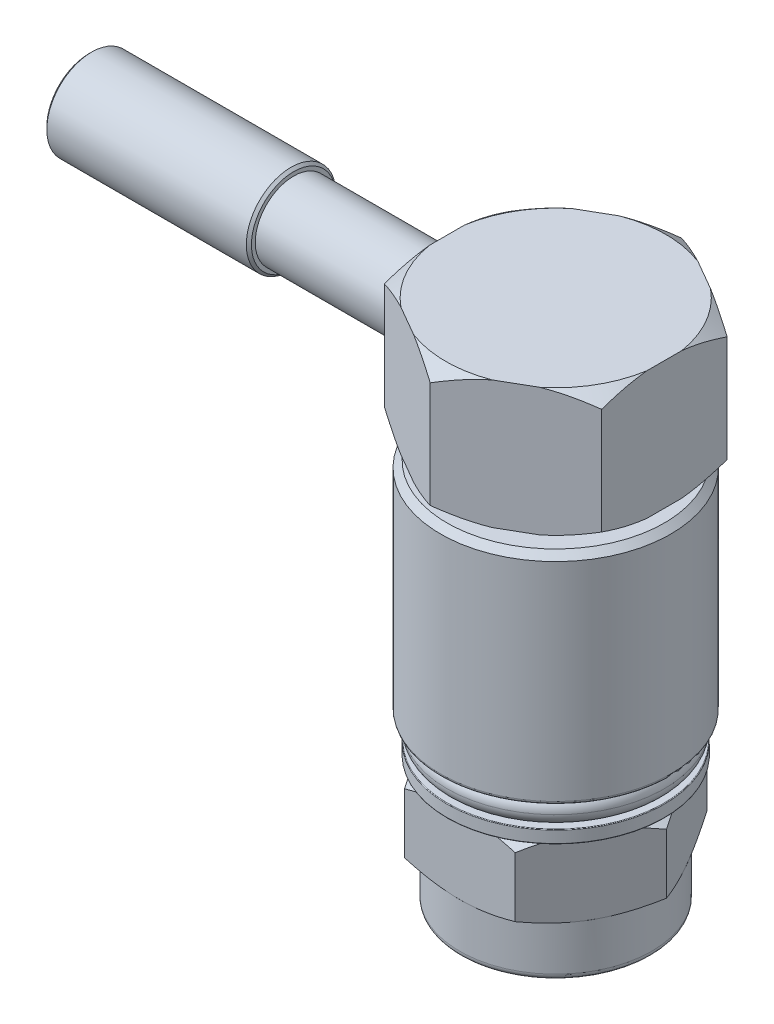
ISO-10303-21;
HEADER;
FILE_DESCRIPTION(('STEP AP214'),'2;1');
FILE_NAME('part.step','',(''),(''),'','','');
FILE_SCHEMA(('AUTOMOTIVE_DESIGN { 1 0 10303 214 1 1 1 1 }'));
ENDSEC;
DATA;
#1=APPLICATION_CONTEXT('core data for automotive mechanical design processes');
#2=APPLICATION_PROTOCOL_DEFINITION('international standard','automotive_design',2000,#1);
#3=PRODUCT_CONTEXT('',#1,'mechanical');
#4=PRODUCT('Part','Part','',(#3));
#5=PRODUCT_RELATED_PRODUCT_CATEGORY('part','',(#4));
#6=PRODUCT_DEFINITION_FORMATION('','',#4);
#7=PRODUCT_DEFINITION_CONTEXT('part definition',#1,'design');
#8=PRODUCT_DEFINITION('design','',#6,#7);
#9=PRODUCT_DEFINITION_SHAPE('','',#8);
#10=(LENGTH_UNIT() NAMED_UNIT(*) SI_UNIT(.MILLI.,.METRE.));
#11=(NAMED_UNIT(*) PLANE_ANGLE_UNIT() SI_UNIT($,.RADIAN.));
#12=(NAMED_UNIT(*) SI_UNIT($,.STERADIAN.) SOLID_ANGLE_UNIT());
#13=UNCERTAINTY_MEASURE_WITH_UNIT(LENGTH_MEASURE(1.E-05),#10,'distance_accuracy_value','');
#14=(GEOMETRIC_REPRESENTATION_CONTEXT(3) GLOBAL_UNCERTAINTY_ASSIGNED_CONTEXT((#13)) GLOBAL_UNIT_ASSIGNED_CONTEXT((#10,
#11,#12)) REPRESENTATION_CONTEXT('',''));
#15=CARTESIAN_POINT('',(0.,0.,0.));
#16=DIRECTION('',(0.,0.,1.));
#17=DIRECTION('',(1.,0.,0.));
#18=AXIS2_PLACEMENT_3D('',#15,#16,#17);
#19=CARTESIAN_POINT('',(1.11022302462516E-12,-21.0000000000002,8.44999999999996));
#20=DIRECTION('',(0.,-1.,0.));
#21=DIRECTION('',(0.,0.,-1.00000000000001));
#22=AXIS2_PLACEMENT_3D('',#19,#20,#21);
#23=PLANE('',#22);
#24=DIRECTION('',(-1.00000000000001,0.,0.));
#25=VECTOR('',#24,1.);
#26=CARTESIAN_POINT('',(-3.33066907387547E-13,-21.,-7.50000000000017));
#27=LINE('',#26,#25);
#28=CARTESIAN_POINT('',(0.392320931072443,-20.9999999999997,-7.49999999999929));
#29=VERTEX_POINT('',#28);
#30=CARTESIAN_POINT('',(-0.392320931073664,-20.9999999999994,-7.5000000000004));
#31=VERTEX_POINT('',#30);
#32=EDGE_CURVE('E743',#29,#31,#27,.T.);
#33=ORIENTED_EDGE('',*,*,#32,.T.);
#34=CARTESIAN_POINT('',(-3.33066907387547E-13,-20.9999999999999,-2.22044604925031E-13));
#35=DIRECTION('',(0.,1.,0.));
#36=DIRECTION('',(0.,0.,1.00000000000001));
#37=AXIS2_PLACEMENT_3D('',#34,#35,#36);
#38=CIRCLE('',#37,7.51025403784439);
#39=CARTESIAN_POINT('',(-6.29903006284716,-20.9999999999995,-4.08975989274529));
#40=VERTEX_POINT('',#39);
#41=EDGE_CURVE('E444',#31,#40,#38,.T.);
#42=ORIENTED_EDGE('',*,*,#41,.T.);
#43=DIRECTION('',(-0.500000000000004,0.,0.866025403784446));
#44=VECTOR('',#43,1.);
#45=CARTESIAN_POINT('',(-10.1541478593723,-20.9999999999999,2.58750000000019));
#46=LINE('',#45,#44);
#47=CARTESIAN_POINT('',(-6.69135099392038,-21.0000000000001,-3.41024010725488));
#48=VERTEX_POINT('',#47);
#49=EDGE_CURVE('E745',#40,#48,#46,.T.);
#50=ORIENTED_EDGE('',*,*,#49,.T.);
#51=CARTESIAN_POINT('',(-6.69135099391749,-21.0000000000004,3.41024010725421));
#52=VERTEX_POINT('',#51);
#53=EDGE_CURVE('E439',#48,#52,#38,.T.);
#54=ORIENTED_EDGE('',*,*,#53,.T.);
#55=DIRECTION('',(0.500000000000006,0.,0.866025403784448));
#56=VECTOR('',#55,1.);
#57=CARTESIAN_POINT('',(-2.83623319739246,-20.9999999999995,10.0875000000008));
#58=LINE('',#57,#56);
#59=CARTESIAN_POINT('',(-6.29903006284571,-21.,4.08975989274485));
#60=VERTEX_POINT('',#59);
#61=EDGE_CURVE('E748',#52,#60,#58,.T.);
#62=ORIENTED_EDGE('',*,*,#61,.T.);
#63=CARTESIAN_POINT('',(-0.392320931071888,-20.9999999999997,7.49999999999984));
#64=VERTEX_POINT('',#63);
#65=EDGE_CURVE('E431',#60,#64,#38,.T.);
#66=ORIENTED_EDGE('',*,*,#65,.T.);
#67=DIRECTION('',(1.00000000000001,0.,0.));
#68=VECTOR('',#67,1.);
#69=CARTESIAN_POINT('',(-9.99200722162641E-13,-20.9999999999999,7.50000000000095));
#70=LINE('',#69,#68);
#71=CARTESIAN_POINT('',(0.392320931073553,-21.0000000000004,7.49999999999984));
#72=VERTEX_POINT('',#71);
#73=EDGE_CURVE('E750',#64,#72,#70,.T.);
#74=ORIENTED_EDGE('',*,*,#73,.T.);
#75=CARTESIAN_POINT('',(6.2990300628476,-21.0000000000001,4.08975989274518));
#76=VERTEX_POINT('',#75);
#77=EDGE_CURVE('E428',#72,#76,#38,.T.);
#78=ORIENTED_EDGE('',*,*,#77,.T.);
#79=DIRECTION('',(0.500000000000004,0.,-0.866025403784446));
#80=VECTOR('',#79,1.);
#81=CARTESIAN_POINT('',(2.83623319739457,-20.9999999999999,10.0875000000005));
#82=LINE('',#81,#80);
#83=CARTESIAN_POINT('',(6.69135099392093,-21.0000000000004,3.41024010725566));
#84=VERTEX_POINT('',#83);
#85=EDGE_CURVE('E752',#76,#84,#82,.T.);
#86=ORIENTED_EDGE('',*,*,#85,.T.);
#87=CARTESIAN_POINT('',(6.69135099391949,-20.9999999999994,-3.41024010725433));
#88=VERTEX_POINT('',#87);
#89=EDGE_CURVE('E430',#84,#88,#38,.T.);
#90=ORIENTED_EDGE('',*,*,#89,.T.);
#91=DIRECTION('',(-0.500000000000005,0.,-0.866025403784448));
#92=VECTOR('',#91,1.);
#93=CARTESIAN_POINT('',(10.1541478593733,-20.9999999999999,2.5875000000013));
#94=LINE('',#93,#92);
#95=CARTESIAN_POINT('',(6.29903006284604,-21.,-4.08975989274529));
#96=VERTEX_POINT('',#95);
#97=EDGE_CURVE('E754',#88,#96,#94,.T.);
#98=ORIENTED_EDGE('',*,*,#97,.T.);
#99=EDGE_CURVE('E62',#96,#29,#38,.T.);
#100=ORIENTED_EDGE('',*,*,#99,.T.);
#101=EDGE_LOOP('',(#33,#42,#50,#54,#62,#66,#74,#78,#86,#90,#98,#100));
#102=FACE_BOUND('',#101,.T.);
#103=CARTESIAN_POINT('',(-3.33066907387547E-13,-20.9999999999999,-2.22044604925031E-13));
#104=DIRECTION('',(0.,1.,0.));
#105=DIRECTION('',(0.,0.,1.00000000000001));
#106=AXIS2_PLACEMENT_3D('',#103,#104,#105);
#107=CIRCLE('',#106,8.45);
#108=CARTESIAN_POINT('',(-3.27907145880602E-13,-20.9999999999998,8.44999999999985));
#109=VERTEX_POINT('',#108);
#110=EDGE_CURVE('E784',#109,#109,#107,.T.);
#111=ORIENTED_EDGE('',*,*,#110,.F.);
#112=EDGE_LOOP('',(#111));
#113=FACE_BOUND('',#112,.T.);
#114=ADVANCED_FACE('F46',(#102,#113),#23,.T.);
#115=CARTESIAN_POINT('',(6.66133814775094E-13,-18.0000000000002,3.33066907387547E-13));
#116=DIRECTION('',(0.,-1.,0.));
#117=DIRECTION('',(0.,0.,-1.00000000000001));
#118=AXIS2_PLACEMENT_3D('',#115,#116,#117);
#119=PLANE('',#118);
#120=CARTESIAN_POINT('',(6.66133814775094E-13,-18.0000000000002,3.33066907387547E-13));
#121=DIRECTION('',(0.,-1.,0.));
#122=DIRECTION('',(0.,0.,-1.00000000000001));
#123=AXIS2_PLACEMENT_3D('',#120,#121,#122);
#124=CIRCLE('',#123,8.75);
#125=CARTESIAN_POINT('',(6.60790866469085E-13,-18.0000000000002,-8.74999999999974));
#126=VERTEX_POINT('',#125);
#127=EDGE_CURVE('E737',#126,#126,#124,.T.);
#128=ORIENTED_EDGE('',*,*,#127,.T.);
#129=EDGE_LOOP('',(#128));
#130=FACE_BOUND('',#129,.T.);
#131=CARTESIAN_POINT('',(6.66133814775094E-13,-18.0000000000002,3.33066907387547E-13));
#132=DIRECTION('',(0.,1.,0.));
#133=DIRECTION('',(0.,0.,1.00000000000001));
#134=AXIS2_PLACEMENT_3D('',#131,#132,#133);
#135=CIRCLE('',#134,7.50099999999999);
#136=CARTESIAN_POINT('',(6.70714095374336E-13,-18.0000000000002,7.50100000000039));
#137=VERTEX_POINT('',#136);
#138=EDGE_CURVE('E809',#137,#137,#135,.T.);
#139=ORIENTED_EDGE('',*,*,#138,.T.);
#140=EDGE_LOOP('',(#139));
#141=FACE_BOUND('',#140,.T.);
#142=ADVANCED_FACE('F494',(#130,#141),#119,.T.);
#143=CARTESIAN_POINT('',(9.99200722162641E-13,-10.0000000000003,2.22044604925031E-13));
#144=DIRECTION('',(0.,1.,0.));
#145=DIRECTION('',(0.,0.,1.00000000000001));
#146=AXIS2_PLACEMENT_3D('',#143,#144,#145);
#147=CYLINDRICAL_SURFACE('',#146,5.5);
#148=CARTESIAN_POINT('',(0.,0.,0.));
#149=DIRECTION('',(0.,1.,0.));
#150=DIRECTION('',(0.,0.,1.00000000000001));
#151=AXIS2_PLACEMENT_3D('',#148,#149,#150);
#152=CIRCLE('',#151,5.5);
#153=CARTESIAN_POINT('',(0.,0.,5.50000000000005));
#154=VERTEX_POINT('',#153);
#155=EDGE_CURVE('E725',#154,#154,#152,.F.);
#156=ORIENTED_EDGE('',*,*,#155,.T.);
#157=EDGE_LOOP('',(#156));
#158=FACE_BOUND('',#157,.T.);
#159=CARTESIAN_POINT('',(-4.44089209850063E-13,-0.999999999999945,3.33066907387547E-13));
#160=DIRECTION('',(0.,-1.,0.));
#161=DIRECTION('',(0.,0.,-1.00000000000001));
#162=AXIS2_PLACEMENT_3D('',#159,#160,#161);
#163=CIRCLE('',#162,5.5);
#164=CARTESIAN_POINT('',(-4.47447634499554E-13,-0.99999999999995,-5.49999999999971));
#165=VERTEX_POINT('',#164);
#166=EDGE_CURVE('E728',#165,#165,#163,.T.);
#167=ORIENTED_EDGE('',*,*,#166,.F.);
#168=EDGE_LOOP('',(#167));
#169=FACE_BOUND('',#168,.T.);
#170=ADVANCED_FACE('F498',(#158,#169),#147,.T.);
#171=CARTESIAN_POINT('',(-8.88178419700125E-13,-2.63677968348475E-13,-9.8149545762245));
#172=DIRECTION('',(0.,1.,0.));
#173=DIRECTION('',(0.,0.,1.00000000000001));
#174=AXIS2_PLACEMENT_3D('',#171,#172,#173);
#175=PLANE('',#174);
#176=DIRECTION('',(0.866025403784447,0.,0.500000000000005));
#177=VECTOR('',#176,1.);
#178=CARTESIAN_POINT('',(-8.49999999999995,0.,4.90747728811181));
#179=LINE('',#178,#177);
#180=CARTESIAN_POINT('',(-5.42591251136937,0.,6.68230252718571));
#181=VERTEX_POINT('',#180);
#182=CARTESIAN_POINT('',(-3.07408748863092,-4.9960036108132E-13,8.04012933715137));
#183=VERTEX_POINT('',#182);
#184=EDGE_CURVE('E691',#181,#183,#179,.T.);
#185=ORIENTED_EDGE('',*,*,#184,.F.);
#186=CARTESIAN_POINT('',(0.,0.,0.));
#187=DIRECTION('',(0.,1.,0.));
#188=DIRECTION('',(0.,0.,1.00000000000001));
#189=AXIS2_PLACEMENT_3D('',#186,#187,#188);
#190=CIRCLE('',#189,8.60776937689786);
#191=CARTESIAN_POINT('',(-8.50000000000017,0.,1.35782680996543));
#192=VERTEX_POINT('',#191);
#193=EDGE_CURVE('E724',#181,#192,#190,.F.);
#194=ORIENTED_EDGE('',*,*,#193,.T.);
#195=DIRECTION('',(0.,0.,1.00000000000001));
#196=VECTOR('',#195,1.);
#197=CARTESIAN_POINT('',(-8.50000000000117,2.22044604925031E-13,-4.90747728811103));
#198=LINE('',#197,#196);
#199=CARTESIAN_POINT('',(-8.49999999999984,-1.52655665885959E-13,-1.35782680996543));
#200=VERTEX_POINT('',#199);
#201=EDGE_CURVE('E688',#200,#192,#198,.T.);
#202=ORIENTED_EDGE('',*,*,#201,.F.);
#203=CARTESIAN_POINT('',(-5.42591251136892,0.,-6.68230252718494));
#204=VERTEX_POINT('',#203);
#205=EDGE_CURVE('E863',#200,#204,#190,.F.);
#206=ORIENTED_EDGE('',*,*,#205,.T.);
#207=DIRECTION('',(-0.866025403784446,0.,0.500000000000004));
#208=VECTOR('',#207,1.);
#209=CARTESIAN_POINT('',(-8.88178419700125E-13,-2.63677968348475E-13,-9.8149545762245));
#210=LINE('',#209,#208);
#211=CARTESIAN_POINT('',(-3.07408748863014,0.,-8.0401293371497));
#212=VERTEX_POINT('',#211);
#213=EDGE_CURVE('E685',#212,#204,#210,.T.);
#214=ORIENTED_EDGE('',*,*,#213,.F.);
#215=CARTESIAN_POINT('',(3.07408748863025,0.,-8.04012933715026));
#216=VERTEX_POINT('',#215);
#217=EDGE_CURVE('E862',#212,#216,#190,.F.);
#218=ORIENTED_EDGE('',*,*,#217,.T.);
#219=DIRECTION('',(-0.866025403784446,0.,-0.500000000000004));
#220=VECTOR('',#219,1.);
#221=CARTESIAN_POINT('',(8.5000000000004,0.,-4.90747728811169));
#222=LINE('',#221,#220);
#223=CARTESIAN_POINT('',(5.42591251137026,4.57966997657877E-13,-6.68230252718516));
#224=VERTEX_POINT('',#223);
#225=EDGE_CURVE('E682',#224,#216,#222,.T.);
#226=ORIENTED_EDGE('',*,*,#225,.F.);
#227=CARTESIAN_POINT('',(8.49999999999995,-5.41233724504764E-13,-1.35782680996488));
#228=VERTEX_POINT('',#227);
#229=EDGE_CURVE('E858',#224,#228,#190,.F.);
#230=ORIENTED_EDGE('',*,*,#229,.T.);
#231=DIRECTION('',(0.,0.,-1.00000000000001));
#232=VECTOR('',#231,1.);
#233=CARTESIAN_POINT('',(8.50000000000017,1.66533453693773E-13,4.90747728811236));
#234=LINE('',#233,#232);
#235=CARTESIAN_POINT('',(8.49999999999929,-6.80011602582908E-13,1.3578268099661));
#236=VERTEX_POINT('',#235);
#237=EDGE_CURVE('E666',#236,#228,#234,.T.);
#238=ORIENTED_EDGE('',*,*,#237,.F.);
#239=CARTESIAN_POINT('',(5.42591251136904,4.57966997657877E-13,6.68230252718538));
#240=VERTEX_POINT('',#239);
#241=EDGE_CURVE('E723',#236,#240,#190,.F.);
#242=ORIENTED_EDGE('',*,*,#241,.T.);
#243=DIRECTION('',(0.866025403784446,0.,-0.500000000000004));
#244=VECTOR('',#243,1.);
#245=CARTESIAN_POINT('',(5.55111512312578E-13,1.66533453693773E-13,9.81495457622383));
#246=LINE('',#245,#244);
#247=CARTESIAN_POINT('',(3.07408748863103,4.85722573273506E-13,8.04012933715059));
#248=VERTEX_POINT('',#247);
#249=EDGE_CURVE('E694',#248,#240,#246,.T.);
#250=ORIENTED_EDGE('',*,*,#249,.F.);
#251=EDGE_CURVE('E720',#248,#183,#190,.F.);
#252=ORIENTED_EDGE('',*,*,#251,.T.);
#253=EDGE_LOOP('',(#185,#194,#202,#206,#214,#218,#226,#230,#238,#242,#250,#252));
#254=FACE_BOUND('',#253,.T.);
#255=ORIENTED_EDGE('',*,*,#155,.F.);
#256=EDGE_LOOP('',(#255));
#257=FACE_BOUND('',#256,.T.);
#258=ADVANCED_FACE('F575',(#254,#257),#175,.F.);
#259=CARTESIAN_POINT('',(8.50000000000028,10.,-4.90747728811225));
#260=DIRECTION('',(-0.500000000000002,0.,0.866025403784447));
#261=DIRECTION('',(0.866025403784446,0.,0.500000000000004));
#262=AXIS2_PLACEMENT_3D('',#259,#260,#261);
#263=PLANE('',#262);
#264=DIRECTION('',(0.,-1.,0.));
#265=VECTOR('',#264,1.);
#266=CARTESIAN_POINT('',(8.50000000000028,10.,-4.90747728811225));
#267=LINE('',#266,#265);
#268=CARTESIAN_POINT('',(8.50000000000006,9.15471982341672,-4.90747728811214));
#269=VERTEX_POINT('',#268);
#270=CARTESIAN_POINT('',(8.50000000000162,0.84528017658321,-4.90747728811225));
#271=VERTEX_POINT('',#270);
#272=EDGE_CURVE('E681',#269,#271,#267,.T.);
#273=ORIENTED_EDGE('',*,*,#272,.T.);
#274=CARTESIAN_POINT('',(14.4147244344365,4.12004009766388,-1.49260954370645));
#275=CARTESIAN_POINT('',(14.180056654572,3.96639294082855,-1.62809504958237));
#276=CARTESIAN_POINT('',(13.9447199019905,3.81409209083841,-1.76396678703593));
#277=CARTESIAN_POINT('',(13.4724585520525,3.51274452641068,-2.03662700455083));
#278=CARTESIAN_POINT('',(13.2355337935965,3.36369814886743,-2.17341557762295));
#279=CARTESIAN_POINT('',(12.7592582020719,3.06905913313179,-2.44839341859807));
#280=CARTESIAN_POINT('',(12.519902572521,2.92347680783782,-2.58658545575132));
#281=CARTESIAN_POINT('',(12.0391258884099,2.63694201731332,-2.864162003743));
#282=CARTESIAN_POINT('',(11.797704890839,2.49598942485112,-3.00354648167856));
#283=CARTESIAN_POINT('',(11.3027144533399,2.2140790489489,-3.28932934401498));
#284=CARTESIAN_POINT('',(11.0490471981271,2.07334947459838,-3.43578420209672));
#285=CARTESIAN_POINT('',(10.5387345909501,1.79921650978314,-3.73041332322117));
#286=CARTESIAN_POINT('',(10.282089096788,1.66581347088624,-3.87858766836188));
#287=CARTESIAN_POINT('',(9.76564591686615,1.40811286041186,-4.17675627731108));
#288=CARTESIAN_POINT('',(9.50585126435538,1.28380723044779,-4.32674878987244));
#289=CARTESIAN_POINT('',(8.98251646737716,1.0462505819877,-4.62889627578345));
#290=CARTESIAN_POINT('',(8.71897679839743,0.932998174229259,-4.78105097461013));
#291=CARTESIAN_POINT('',(8.12491466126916,0.694817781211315,-5.12403290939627));
#292=CARTESIAN_POINT('',(7.79330056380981,0.573469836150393,-5.31549039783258));
#293=CARTESIAN_POINT('',(7.12353575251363,0.357127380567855,-5.70217929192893));
#294=CARTESIAN_POINT('',(6.78538534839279,0.262131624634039,-5.89741051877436));
#295=CARTESIAN_POINT('',(6.27655742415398,0.144592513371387,-6.19118245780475));
#296=CARTESIAN_POINT('',(6.10798339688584,0.109746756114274,-6.28850871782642));
#297=CARTESIAN_POINT('',(5.7696866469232,0.0485857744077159,-6.48382443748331));
#298=CARTESIAN_POINT('',(5.59996407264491,0.0222694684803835,-6.58181381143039));
#299=CARTESIAN_POINT('',(5.25966427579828,-0.0212726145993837,-6.77828599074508));
#300=CARTESIAN_POINT('',(5.08908716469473,-0.0384995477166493,-6.87676873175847));
#301=CARTESIAN_POINT('',(4.74740972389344,-0.0634748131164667,-7.07403629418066));
#302=CARTESIAN_POINT('',(4.57630939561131,-0.0712231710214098,-7.17282111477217));
#303=CARTESIAN_POINT('',(4.23286208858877,-0.077074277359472,-7.37111050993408));
#304=CARTESIAN_POINT('',(4.06051428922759,-0.0751134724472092,-7.47061555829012));
#305=CARTESIAN_POINT('',(3.71611078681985,-0.0614484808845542,-7.66945701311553));
#306=CARTESIAN_POINT('',(3.54405508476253,-0.0497442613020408,-7.76879341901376));
#307=CARTESIAN_POINT('',(3.20060846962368,-0.0168689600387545,-7.96708241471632));
#308=CARTESIAN_POINT('',(3.02921762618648,0.00430308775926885,-8.06603496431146));
#309=CARTESIAN_POINT('',(2.68743989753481,0.0556331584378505,-8.26336042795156));
#310=CARTESIAN_POINT('',(2.5170531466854,0.08579235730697,-8.3617332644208));
#311=CARTESIAN_POINT('',(2.00252590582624,0.189911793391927,-8.65879570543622));
#312=CARTESIAN_POINT('',(1.66033978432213,0.276974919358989,-8.85635695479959));
#313=CARTESIAN_POINT('',(0.982493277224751,0.479538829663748,-9.24771181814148));
#314=CARTESIAN_POINT('',(0.646833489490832,0.595042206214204,-9.44150508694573));
#315=CARTESIAN_POINT('',(0.0358764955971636,0.827947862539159,-9.79424127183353));
#316=CARTESIAN_POINT('',(-0.24038990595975,0.942010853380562,-9.95374375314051));
#317=CARTESIAN_POINT('',(-0.788736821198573,1.18291193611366,-10.270331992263));
#318=CARTESIAN_POINT('',(-1.06081664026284,1.30975212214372,-10.4274173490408));
#319=CARTESIAN_POINT('',(-1.60149428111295,1.57386177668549,-10.7395777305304));
#320=CARTESIAN_POINT('',(-1.87008777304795,1.7111429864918,-10.8946502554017));
#321=CARTESIAN_POINT('',(-2.40393653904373,1.99401768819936,-11.2028679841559));
#322=CARTESIAN_POINT('',(-2.66919201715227,2.13961066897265,-11.3560133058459));
#323=CARTESIAN_POINT('',(-3.18630581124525,2.43161025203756,-11.6545690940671));
#324=CARTESIAN_POINT('',(-3.43827643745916,2.57775268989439,-11.8000444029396));
#325=CARTESIAN_POINT('',(-3.93993537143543,2.8751816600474,-12.0896773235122));
#326=CARTESIAN_POINT('',(-4.18962360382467,3.02646836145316,-12.2338348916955));
#327=CARTESIAN_POINT('',(-4.68619754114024,3.33279434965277,-12.5205319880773));
#328=CARTESIAN_POINT('',(-4.93308979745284,3.4878195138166,-12.6630752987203));
#329=CARTESIAN_POINT('',(-5.42513760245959,3.80142455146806,-12.9471592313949));
#330=CARTESIAN_POINT('',(-5.67029335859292,3.96000399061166,-13.0886999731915));
#331=CARTESIAN_POINT('',(-5.91472443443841,4.12004009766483,-13.2298223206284));
#332=B_SPLINE_CURVE_WITH_KNOTS('',3,(#274,#275,#276,#277,#278,#279,#280,#281,#282,#283,#284,
#285,#286,#287,#288,#289,#290,#291,#292,#293,#294,#295,#296,#297,#298,#299,#300,#301,#302,#303,
#304,#305,#306,#307,#308,#309,#310,#311,#312,#313,#314,#315,#316,#317,#318,#319,#320,#321,#322,
#323,#324,#325,#326,#327,#328,#329,#330,#331),.UNSPECIFIED.,.F.,.F.,(4,2,2,2,2,2,2,2,2,2,2,2,2,
2,2,2,2,2,2,2,2,2,2,2,2,2,2,2,4),(0.,0.934510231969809,1.86911674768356,2.80622501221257,
3.74330750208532,4.71811301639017,5.6929652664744,6.66694328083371,7.64079871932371,
8.8451301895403,10.0494047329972,10.6424878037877,11.2354956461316,11.8284280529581,
12.4213588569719,13.0181759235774,13.6149950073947,14.2118750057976,14.808833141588,
16.0211878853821,17.2336531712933,18.2496868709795,19.2658873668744,20.2832480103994,
21.3005461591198,22.2772610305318,23.2540080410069,24.2275129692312,25.2008995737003),.UNSPECIFIED.);
#333=EDGE_CURVE('E612',#271,#224,#332,.T.);
#334=ORIENTED_EDGE('',*,*,#333,.T.);
#335=ORIENTED_EDGE('',*,*,#225,.T.);
#336=CARTESIAN_POINT('',(-1.66533453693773E-12,0.845280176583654,-9.81495457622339));
#337=VERTEX_POINT('',#336);
#338=EDGE_CURVE('E624',#216,#337,#332,.T.);
#339=ORIENTED_EDGE('',*,*,#338,.T.);
#340=DIRECTION('',(0.,-1.,0.));
#341=VECTOR('',#340,1.);
#342=CARTESIAN_POINT('',(-6.66133814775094E-13,10.0000000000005,-9.81495457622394));
#343=LINE('',#342,#341);
#344=CARTESIAN_POINT('',(-1.33226762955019E-12,9.1547198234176,-9.81495457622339));
#345=VERTEX_POINT('',#344);
#346=EDGE_CURVE('E713',#345,#337,#343,.T.);
#347=ORIENTED_EDGE('',*,*,#346,.F.);
#348=CARTESIAN_POINT('',(-5.91472443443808,5.87995990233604,-13.229822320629));
#349=CARTESIAN_POINT('',(-5.68005665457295,6.03360705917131,-13.094336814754));
#350=CARTESIAN_POINT('',(-5.44471990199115,6.18590790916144,-12.9584650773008));
#351=CARTESIAN_POINT('',(-4.97245855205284,6.4872554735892,-12.6858048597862));
#352=CARTESIAN_POINT('',(-4.73553379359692,6.63630185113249,-12.549016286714));
#353=CARTESIAN_POINT('',(-4.25925820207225,6.93094086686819,-12.2740384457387));
#354=CARTESIAN_POINT('',(-4.01990257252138,7.07652319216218,-12.1358464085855));
#355=CARTESIAN_POINT('',(-3.53912588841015,7.36305798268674,-11.8582698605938));
#356=CARTESIAN_POINT('',(-3.29770489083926,7.50401057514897,-11.7188853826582));
#357=CARTESIAN_POINT('',(-2.80271445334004,7.78592095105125,-11.4331025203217));
#358=CARTESIAN_POINT('',(-2.54904719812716,7.9266505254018,-11.28664766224));
#359=CARTESIAN_POINT('',(-2.0387345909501,8.20078349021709,-10.9920185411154));
#360=CARTESIAN_POINT('',(-1.78208909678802,8.33418652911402,-10.8438441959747));
#361=CARTESIAN_POINT('',(-1.26564591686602,8.59188713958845,-10.5456755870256));
#362=CARTESIAN_POINT('',(-1.00585126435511,8.71619276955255,-10.3956830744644));
#363=CARTESIAN_POINT('',(-0.482516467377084,8.95374941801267,-10.0935355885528));
#364=CARTESIAN_POINT('',(-0.218976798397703,9.0670018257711,-9.94138088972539));
#365=CARTESIAN_POINT('',(0.375085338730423,9.30518221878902,-9.59839895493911));
#366=CARTESIAN_POINT('',(0.706699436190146,9.42653016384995,-9.40694146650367));
#367=CARTESIAN_POINT('',(1.37646424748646,9.64287261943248,-9.02025257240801));
#368=CARTESIAN_POINT('',(1.71461465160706,9.73786837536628,-8.82502134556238));
#369=CARTESIAN_POINT('',(2.22344257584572,9.85540748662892,-8.53124940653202));
#370=CARTESIAN_POINT('',(2.39201660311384,9.89025324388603,-8.43392314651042));
#371=CARTESIAN_POINT('',(2.73031335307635,9.9514142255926,-8.23860742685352));
#372=CARTESIAN_POINT('',(2.90003592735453,9.97773053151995,-8.14061805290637));
#373=CARTESIAN_POINT('',(3.24033572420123,10.0212726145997,-7.944145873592));
#374=CARTESIAN_POINT('',(3.41091283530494,10.0384995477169,-7.84566313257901));
#375=CARTESIAN_POINT('',(3.75259027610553,10.0634748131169,-7.64839557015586));
#376=CARTESIAN_POINT('',(3.92369060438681,10.071223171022,-7.549610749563));
#377=CARTESIAN_POINT('',(4.26713791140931,10.0770742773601,-7.3513213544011));
#378=CARTESIAN_POINT('',(4.43948571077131,10.0751134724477,-7.25181630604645));
#379=CARTESIAN_POINT('',(4.78388921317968,10.061448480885,-7.05297485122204));
#380=CARTESIAN_POINT('',(4.95594491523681,10.0497442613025,-6.95363844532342));
#381=CARTESIAN_POINT('',(5.29939153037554,10.0168689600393,-6.75534944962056));
#382=CARTESIAN_POINT('',(5.47078237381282,9.99569691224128,-6.65639690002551));
#383=CARTESIAN_POINT('',(5.81256010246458,9.94436684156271,-6.45907143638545));
#384=CARTESIAN_POINT('',(5.982946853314,9.91420764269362,-6.36069859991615));
#385=CARTESIAN_POINT('',(6.49747409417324,9.81008820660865,-6.06363615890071));
#386=CARTESIAN_POINT('',(6.83966021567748,9.72302508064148,-5.86607490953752));
#387=CARTESIAN_POINT('',(7.51750672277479,9.520461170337,-5.47472004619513));
#388=CARTESIAN_POINT('',(7.85316651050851,9.40495779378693,-5.2809267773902));
#389=CARTESIAN_POINT('',(8.46412350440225,9.17205213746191,-4.92819059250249));
#390=CARTESIAN_POINT('',(8.74038990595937,9.05798914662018,-4.76868811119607));
#391=CARTESIAN_POINT('',(9.28873682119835,8.81708806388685,-4.45209987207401));
#392=CARTESIAN_POINT('',(9.56081664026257,8.69024787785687,-4.29501451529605));
#393=CARTESIAN_POINT('',(10.1014942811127,8.42613822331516,-3.9828541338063));
#394=CARTESIAN_POINT('',(10.3700877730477,8.28885701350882,-3.82778160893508));
#395=CARTESIAN_POINT('',(10.9039365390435,8.00598231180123,-3.51956388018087));
#396=CARTESIAN_POINT('',(11.1691920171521,7.86038933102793,-3.36641855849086));
#397=CARTESIAN_POINT('',(11.6863058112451,7.56838974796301,-3.06786277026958));
#398=CARTESIAN_POINT('',(11.938276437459,7.42224731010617,-2.9223874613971));
#399=CARTESIAN_POINT('',(12.4399353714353,7.12481833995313,-2.63275454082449));
#400=CARTESIAN_POINT('',(12.6896236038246,6.97353163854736,-2.48859697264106));
#401=CARTESIAN_POINT('',(13.1861975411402,6.66720565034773,-2.20189987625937));
#402=CARTESIAN_POINT('',(13.4330897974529,6.5121804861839,-2.05935656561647));
#403=CARTESIAN_POINT('',(13.9251376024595,6.19857544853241,-1.7752726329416));
#404=CARTESIAN_POINT('',(14.1702933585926,6.03999600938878,-1.63373189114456));
#405=CARTESIAN_POINT('',(14.4147244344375,5.87995990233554,-1.49260954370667));
#406=B_SPLINE_CURVE_WITH_KNOTS('',3,(#348,#349,#350,#351,#352,#353,#354,#355,#356,#357,#358,
#359,#360,#361,#362,#363,#364,#365,#366,#367,#368,#369,#370,#371,#372,#373,#374,#375,#376,#377,
#378,#379,#380,#381,#382,#383,#384,#385,#386,#387,#388,#389,#390,#391,#392,#393,#394,#395,#396,
#397,#398,#399,#400,#401,#402,#403,#404,#405),.UNSPECIFIED.,.F.,.F.,(4,2,2,2,2,2,2,2,2,2,2,2,2,
2,2,2,2,2,2,2,2,2,2,2,2,2,2,2,4),(0.,0.934510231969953,1.86911674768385,2.806225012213,
3.74330750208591,4.71811301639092,5.69296526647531,6.66694328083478,7.64079871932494,
8.8451301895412,10.0494047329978,10.6424878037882,11.2354956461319,11.8284280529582,
12.4213588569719,13.0181759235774,13.6149950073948,14.2118750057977,14.8088331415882,
16.0211878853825,17.2336531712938,18.24968687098,19.265887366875,20.2832480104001,
21.3005461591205,22.2772610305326,23.2540080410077,24.2275129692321,25.2008995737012),.UNSPECIFIED.);
#407=CARTESIAN_POINT('',(3.07408748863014,9.99999999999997,-8.04012933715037));
#408=VERTEX_POINT('',#407);
#409=EDGE_CURVE('E648',#345,#408,#406,.T.);
#410=ORIENTED_EDGE('',*,*,#409,.T.);
#411=DIRECTION('',(-0.866025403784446,0.,-0.500000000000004));
#412=VECTOR('',#411,1.);
#413=CARTESIAN_POINT('',(8.50000000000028,10.,-4.90747728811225));
#414=LINE('',#413,#412);
#415=CARTESIAN_POINT('',(5.42591251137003,10.0000000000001,-6.68230252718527));
#416=VERTEX_POINT('',#415);
#417=EDGE_CURVE('E662',#416,#408,#414,.T.);
#418=ORIENTED_EDGE('',*,*,#417,.F.);
#419=EDGE_CURVE('E649',#416,#269,#406,.T.);
#420=ORIENTED_EDGE('',*,*,#419,.T.);
#421=EDGE_LOOP('',(#273,#334,#335,#339,#347,#410,#418,#420));
#422=FACE_BOUND('',#421,.T.);
#423=ADVANCED_FACE('F635',(#422),#263,.F.);
#424=CARTESIAN_POINT('',(-6.66133814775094E-13,10.0000000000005,-9.81495457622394));
#425=DIRECTION('',(0.500000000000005,0.,0.866025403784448));
#426=DIRECTION('',(0.866025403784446,0.,-0.500000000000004));
#427=AXIS2_PLACEMENT_3D('',#424,#425,#426);
#428=PLANE('',#427);
#429=ORIENTED_EDGE('',*,*,#346,.T.);
#430=CARTESIAN_POINT('',(5.91472443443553,4.12004009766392,-13.2298223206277));
#431=CARTESIAN_POINT('',(5.68005665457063,3.9663929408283,-13.0943368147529));
#432=CARTESIAN_POINT('',(5.44471990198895,3.81409209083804,-12.9584650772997));
#433=CARTESIAN_POINT('',(4.97245855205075,3.51274452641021,-12.6858048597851));
#434=CARTESIAN_POINT('',(4.73553379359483,3.363698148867,-12.5490162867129));
#435=CARTESIAN_POINT('',(4.25925820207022,3.0690591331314,-12.2740384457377));
#436=CARTESIAN_POINT('',(4.0199025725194,2.92347680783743,-12.1358464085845));
#437=CARTESIAN_POINT('',(3.53912588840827,2.63694201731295,-11.8582698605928));
#438=CARTESIAN_POINT('',(3.29770489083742,2.49598942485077,-11.7188853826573));
#439=CARTESIAN_POINT('',(2.80271445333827,2.21407904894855,-11.4331025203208));
#440=CARTESIAN_POINT('',(2.54904719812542,2.07334947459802,-11.2866476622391));
#441=CARTESIAN_POINT('',(2.03873459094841,1.79921650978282,-10.9920185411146));
#442=CARTESIAN_POINT('',(1.78208909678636,1.66581347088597,-10.8438441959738));
#443=CARTESIAN_POINT('',(1.26564591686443,1.40811286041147,-10.5456755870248));
#444=CARTESIAN_POINT('',(1.00585126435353,1.28380723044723,-10.3956830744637));
#445=CARTESIAN_POINT('',(0.482516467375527,1.04625058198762,-10.0935355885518));
#446=CARTESIAN_POINT('',(0.218976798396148,0.932998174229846,-9.941380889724));
#447=CARTESIAN_POINT('',(-0.375085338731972,0.69481778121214,-9.5983989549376));
#448=CARTESIAN_POINT('',(-0.706699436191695,0.573469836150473,-9.4069414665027));
#449=CARTESIAN_POINT('',(-1.37646424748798,0.357127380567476,-9.02025257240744));
#450=CARTESIAN_POINT('',(-1.71461465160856,0.262131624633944,-8.82502134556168));
#451=CARTESIAN_POINT('',(-2.22344257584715,0.144592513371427,-8.53124940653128));
#452=CARTESIAN_POINT('',(-2.39201660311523,0.109746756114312,-8.43392314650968));
#453=CARTESIAN_POINT('',(-2.73031335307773,0.0485857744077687,-8.23860742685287));
#454=CARTESIAN_POINT('',(-2.90003592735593,0.0222694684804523,-8.14061805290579));
#455=CARTESIAN_POINT('',(-3.24033572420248,-0.0212726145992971,-7.94414587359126));
#456=CARTESIAN_POINT('',(-3.41091283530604,-0.0384995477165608,-7.84566313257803));
#457=CARTESIAN_POINT('',(-3.75259027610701,-0.0634748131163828,-7.64839557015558));
#458=CARTESIAN_POINT('',(-3.92369060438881,-0.0712231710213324,-7.54961074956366));
#459=CARTESIAN_POINT('',(-4.26713791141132,-0.0770742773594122,-7.35132135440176));
#460=CARTESIAN_POINT('',(-4.43948571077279,-0.0751134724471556,-7.25181630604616));
#461=CARTESIAN_POINT('',(-4.78388921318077,-0.0614484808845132,-7.05297485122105));
#462=CARTESIAN_POINT('',(-4.95594491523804,-0.0497442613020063,-6.95363844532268));
#463=CARTESIAN_POINT('',(-5.29939153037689,-0.0168689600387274,-6.75534944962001));
#464=CARTESIAN_POINT('',(-5.47078237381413,0.00430308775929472,-6.65639690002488));
#465=CARTESIAN_POINT('',(-5.81256010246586,0.0556331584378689,-6.45907143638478));
#466=CARTESIAN_POINT('',(-5.98294685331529,0.0857923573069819,-6.36069859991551));
#467=CARTESIAN_POINT('',(-6.49747409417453,0.189911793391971,-6.06363615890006));
#468=CARTESIAN_POINT('',(-6.83966021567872,0.276974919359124,-5.86607490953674));
#469=CARTESIAN_POINT('',(-7.51750672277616,0.479538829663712,-5.47472004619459));
#470=CARTESIAN_POINT('',(-7.85316651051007,0.595042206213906,-5.28092677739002));
#471=CARTESIAN_POINT('',(-8.46412350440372,0.827947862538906,-4.92819059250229));
#472=CARTESIAN_POINT('',(-8.74038990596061,0.942010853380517,-4.76868811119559));
#473=CARTESIAN_POINT('',(-9.28873682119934,1.18291193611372,-4.45209987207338));
#474=CARTESIAN_POINT('',(-9.56081664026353,1.30975212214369,-4.29501451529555));
#475=CARTESIAN_POINT('',(-10.1014942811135,1.57386177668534,-3.98285413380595));
#476=CARTESIAN_POINT('',(-10.3700877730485,1.71114298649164,-3.82778160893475));
#477=CARTESIAN_POINT('',(-10.9039365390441,1.99401768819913,-3.51956388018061));
#478=CARTESIAN_POINT('',(-11.1691920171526,2.13961066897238,-3.36641855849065));
#479=CARTESIAN_POINT('',(-11.6863058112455,2.43161025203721,-3.06786277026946));
#480=CARTESIAN_POINT('',(-11.9382764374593,2.57775268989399,-2.92238746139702));
#481=CARTESIAN_POINT('',(-12.4399353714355,2.87518166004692,-2.63275454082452));
#482=CARTESIAN_POINT('',(-12.6896236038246,3.02646836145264,-2.48859697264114));
#483=CARTESIAN_POINT('',(-13.1861975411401,3.33279434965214,-2.20189987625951));
#484=CARTESIAN_POINT('',(-13.4330897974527,3.48781951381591,-2.05935656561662));
#485=CARTESIAN_POINT('',(-13.9251376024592,3.80142455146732,-1.77527263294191));
#486=CARTESIAN_POINT('',(-14.1702933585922,3.96000399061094,-1.63373189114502));
#487=CARTESIAN_POINT('',(-14.4147244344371,4.12004009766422,-1.49260954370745));
#488=B_SPLINE_CURVE_WITH_KNOTS('',3,(#430,#431,#432,#433,#434,#435,#436,#437,#438,#439,#440,
#441,#442,#443,#444,#445,#446,#447,#448,#449,#450,#451,#452,#453,#454,#455,#456,#457,#458,#459,
#460,#461,#462,#463,#464,#465,#466,#467,#468,#469,#470,#471,#472,#473,#474,#475,#476,#477,#478,
#479,#480,#481,#482,#483,#484,#485,#486,#487),.UNSPECIFIED.,.F.,.F.,(4,2,2,2,2,2,2,2,2,2,2,2,2,
2,2,2,2,2,2,2,2,2,2,2,2,2,2,2,4),(0.,0.934510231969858,1.86911674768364,2.80622501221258,
3.7433075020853,4.71811301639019,5.69296526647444,6.66694328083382,7.64079871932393,
8.84513018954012,10.0494047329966,10.6424878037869,11.2354956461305,11.8284280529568,
12.4213588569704,13.018175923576,13.6149950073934,14.2118750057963,14.8088331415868,
16.0211878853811,17.2336531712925,18.2496868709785,19.2658873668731,20.2832480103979,
21.300546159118,22.2772610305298,23.2540080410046,24.2275129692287,25.2008995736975),.UNSPECIFIED.);
#489=EDGE_CURVE('E618',#337,#212,#488,.T.);
#490=ORIENTED_EDGE('',*,*,#489,.T.);
#491=ORIENTED_EDGE('',*,*,#213,.T.);
#492=CARTESIAN_POINT('',(-8.49999999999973,0.845280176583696,-4.90747728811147));
#493=VERTEX_POINT('',#492);
#494=EDGE_CURVE('E70',#204,#493,#488,.T.);
#495=ORIENTED_EDGE('',*,*,#494,.T.);
#496=DIRECTION('',(0.,-1.,0.));
#497=VECTOR('',#496,1.);
#498=CARTESIAN_POINT('',(-8.50000000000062,9.99999999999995,-4.90747728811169));
#499=LINE('',#498,#497);
#500=CARTESIAN_POINT('',(-8.50000000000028,9.15471982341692,-4.90747728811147));
#501=VERTEX_POINT('',#500);
#502=EDGE_CURVE('E710',#501,#493,#499,.T.);
#503=ORIENTED_EDGE('',*,*,#502,.F.);
#504=CARTESIAN_POINT('',(-14.4147244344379,5.87995990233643,-1.49260954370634));
#505=CARTESIAN_POINT('',(-14.1800566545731,6.03360705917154,-1.62809504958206));
#506=CARTESIAN_POINT('',(-13.9447199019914,6.18590790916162,-1.76396678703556));
#507=CARTESIAN_POINT('',(-13.4724585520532,6.48725547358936,-2.03662700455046));
#508=CARTESIAN_POINT('',(-13.2355337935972,6.63630185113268,-2.17341557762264));
#509=CARTESIAN_POINT('',(-12.7592582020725,6.93094086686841,-2.44839341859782));
#510=CARTESIAN_POINT('',(-12.5199025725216,7.0765231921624,-2.58658545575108));
#511=CARTESIAN_POINT('',(-12.0391258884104,7.36305798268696,-2.86416200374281));
#512=CARTESIAN_POINT('',(-11.7977048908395,7.50401057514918,-3.00354648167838));
#513=CARTESIAN_POINT('',(-11.3027144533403,7.78592095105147,-3.28932934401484));
#514=CARTESIAN_POINT('',(-11.0490471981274,7.92665052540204,-3.43578420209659));
#515=CARTESIAN_POINT('',(-10.5387345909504,8.20078349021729,-3.73041332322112));
#516=CARTESIAN_POINT('',(-10.2820890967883,8.33418652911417,-3.8785876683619));
#517=CARTESIAN_POINT('',(-9.76564591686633,8.59188713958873,-4.17675627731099));
#518=CARTESIAN_POINT('',(-9.50585126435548,8.71619276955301,-4.32674878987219));
#519=CARTESIAN_POINT('',(-8.98251646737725,8.95374941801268,-4.62889627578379));
#520=CARTESIAN_POINT('',(-8.7189767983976,9.06700182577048,-4.78105097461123));
#521=CARTESIAN_POINT('',(-8.12491466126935,9.30518221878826,-5.12403290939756));
#522=CARTESIAN_POINT('',(-7.79330056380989,9.42653016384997,-5.31549039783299));
#523=CARTESIAN_POINT('',(-7.12353575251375,9.64287261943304,-5.70217929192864));
#524=CARTESIAN_POINT('',(-6.78538534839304,9.7378683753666,-5.89741051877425));
#525=CARTESIAN_POINT('',(-6.27655742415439,9.85540748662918,-6.19118245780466));
#526=CARTESIAN_POINT('',(-6.10798339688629,9.89025324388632,-6.2885087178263));
#527=CARTESIAN_POINT('',(-5.76968664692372,9.95141422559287,-6.4838244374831));
#528=CARTESIAN_POINT('',(-5.59996407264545,9.97773053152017,-6.58181381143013));
#529=CARTESIAN_POINT('',(-5.25966427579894,10.0212726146,-6.77828599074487));
#530=CARTESIAN_POINT('',(-5.0890871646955,10.0384995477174,-6.87676873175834));
#531=CARTESIAN_POINT('',(-4.74740972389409,10.063474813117,-7.0740362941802));
#532=CARTESIAN_POINT('',(-4.57630939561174,10.0712231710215,-7.17282111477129));
#533=CARTESIAN_POINT('',(-4.23286208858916,10.0770742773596,-7.37111050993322));
#534=CARTESIAN_POINT('',(-4.06051428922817,10.0751134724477,-7.4706155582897));
#535=CARTESIAN_POINT('',(-3.71611078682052,10.0614484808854,-7.66945701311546));
#536=CARTESIAN_POINT('',(-3.54405508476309,10.0497442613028,-7.76879341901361));
#537=CARTESIAN_POINT('',(-3.20060846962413,10.0168689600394,-7.96708241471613));
#538=CARTESIAN_POINT('',(-3.02921762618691,9.99569691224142,-8.06603496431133));
#539=CARTESIAN_POINT('',(-2.68743989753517,9.94436684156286,-8.26336042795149));
#540=CARTESIAN_POINT('',(-2.51705314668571,9.91420764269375,-8.36173326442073));
#541=CARTESIAN_POINT('',(-2.0025259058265,9.8100882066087,-8.65879570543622));
#542=CARTESIAN_POINT('',(-1.66033978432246,9.72302508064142,-8.85635695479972));
#543=CARTESIAN_POINT('',(-0.982493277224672,9.52046117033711,-9.24771181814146));
#544=CARTESIAN_POINT('',(-0.646833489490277,9.40495779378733,-9.44150508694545));
#545=CARTESIAN_POINT('',(-0.0358764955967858,9.17205213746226,-9.79424127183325));
#546=CARTESIAN_POINT('',(0.240389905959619,9.05798914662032,-9.9537437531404));
#547=CARTESIAN_POINT('',(0.788736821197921,8.81708806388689,-10.2703319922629));
#548=CARTESIAN_POINT('',(1.06081664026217,8.69024787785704,-10.4274173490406));
#549=CARTESIAN_POINT('',(1.60149428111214,8.4261382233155,-10.73957773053));
#550=CARTESIAN_POINT('',(1.870087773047,8.2888570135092,-10.8946502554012));
#551=CARTESIAN_POINT('',(2.40393653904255,8.00598231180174,-11.2028679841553));
#552=CARTESIAN_POINT('',(2.66919201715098,7.86038933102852,-11.3560133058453));
#553=CARTESIAN_POINT('',(3.1863058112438,7.56838974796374,-11.6545690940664));
#554=CARTESIAN_POINT('',(3.43827643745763,7.42224731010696,-11.8000444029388));
#555=CARTESIAN_POINT('',(3.93993537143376,7.12481833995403,-12.0896773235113));
#556=CARTESIAN_POINT('',(4.18962360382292,6.97353163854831,-12.2338348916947));
#557=CARTESIAN_POINT('',(4.68619754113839,6.66720565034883,-12.5205319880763));
#558=CARTESIAN_POINT('',(4.93308979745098,6.51218048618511,-12.6630752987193));
#559=CARTESIAN_POINT('',(5.42513760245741,6.19857544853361,-12.9471592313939));
#560=CARTESIAN_POINT('',(5.67029335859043,6.03999600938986,-13.0886999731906));
#561=CARTESIAN_POINT('',(5.9147244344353,5.87995990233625,-13.2298223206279));
#562=B_SPLINE_CURVE_WITH_KNOTS('',3,(#504,#505,#506,#507,#508,#509,#510,#511,#512,#513,#514,
#515,#516,#517,#518,#519,#520,#521,#522,#523,#524,#525,#526,#527,#528,#529,#530,#531,#532,#533,
#534,#535,#536,#537,#538,#539,#540,#541,#542,#543,#544,#545,#546,#547,#548,#549,#550,#551,#552,
#553,#554,#555,#556,#557,#558,#559,#560,#561),.UNSPECIFIED.,.F.,.F.,(4,2,2,2,2,2,2,2,2,2,2,2,2,
2,2,2,2,2,2,2,2,2,2,2,2,2,2,2,4),(0.,0.93451023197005,1.86911674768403,2.80622501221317,
3.74330750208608,4.71811301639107,5.69296526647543,6.66694328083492,7.64079871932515,
8.84513018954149,10.0494047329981,10.6424878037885,11.2354956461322,11.8284280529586,
12.4213588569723,13.018175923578,13.6149950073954,14.2118750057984,14.8088331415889,
16.0211878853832,17.2336531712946,18.2496868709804,19.2658873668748,20.2832480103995,
21.3005461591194,22.2772610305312,23.2540080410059,24.2275129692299,25.2008995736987),.UNSPECIFIED.);
#563=CARTESIAN_POINT('',(-5.42591251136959,10.0000000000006,-6.68230252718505));
#564=VERTEX_POINT('',#563);
#565=EDGE_CURVE('E650',#501,#564,#562,.T.);
#566=ORIENTED_EDGE('',*,*,#565,.T.);
#567=DIRECTION('',(-0.866025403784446,0.,0.500000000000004));
#568=VECTOR('',#567,1.);
#569=CARTESIAN_POINT('',(-6.66133814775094E-13,10.0000000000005,-9.81495457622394));
#570=LINE('',#569,#568);
#571=CARTESIAN_POINT('',(-3.07408748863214,9.99999999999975,-8.04012933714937));
#572=VERTEX_POINT('',#571);
#573=EDGE_CURVE('E665',#572,#564,#570,.T.);
#574=ORIENTED_EDGE('',*,*,#573,.F.);
#575=EDGE_CURVE('E641',#572,#345,#562,.T.);
#576=ORIENTED_EDGE('',*,*,#575,.T.);
#577=EDGE_LOOP('',(#429,#490,#491,#495,#503,#566,#574,#576));
#578=FACE_BOUND('',#577,.T.);
#579=ADVANCED_FACE('F631',(#578),#428,.F.);
#580=CARTESIAN_POINT('',(-8.50000000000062,9.99999999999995,-4.90747728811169));
#581=DIRECTION('',(1.00000000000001,0.,0.));
#582=DIRECTION('',(0.,0.,-1.00000000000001));
#583=AXIS2_PLACEMENT_3D('',#580,#581,#582);
#584=PLANE('',#583);
#585=CARTESIAN_POINT('',(-8.50000000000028,5.00000000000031,-7.7715611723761E-13));
#586=DIRECTION('',(1.00000000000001,0.,0.));
#587=DIRECTION('',(0.,1.,0.));
#588=AXIS2_PLACEMENT_3D('',#585,#586,#587);
#589=CIRCLE('',#588,3.);
#590=CARTESIAN_POINT('',(-8.50000000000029,8.00000000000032,-7.74580374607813E-13));
#591=VERTEX_POINT('',#590);
#592=EDGE_CURVE('E832',#591,#591,#589,.T.);
#593=ORIENTED_EDGE('',*,*,#592,.T.);
#594=EDGE_LOOP('',(#593));
#595=FACE_BOUND('',#594,.T.);
#596=ORIENTED_EDGE('',*,*,#502,.T.);
#597=CARTESIAN_POINT('',(-8.5000000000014,3.60845633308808,-10.8222017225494));
#598=CARTESIAN_POINT('',(-8.5000000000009,3.45812035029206,-10.5491376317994));
#599=CARTESIAN_POINT('',(-8.50000000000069,3.3093993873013,-10.2751708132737));
#600=CARTESIAN_POINT('',(-8.50000000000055,3.01589920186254,-9.72508095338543));
#601=CARTESIAN_POINT('',(-8.5000000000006,2.87112059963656,-9.44895758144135));
#602=CARTESIAN_POINT('',(-8.50000000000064,2.58568520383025,-8.89316141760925));
#603=CARTESIAN_POINT('',(-8.50000000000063,2.44504756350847,-8.61347875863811));
#604=CARTESIAN_POINT('',(-8.50000000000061,2.16949241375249,-8.05131620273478));
#605=CARTESIAN_POINT('',(-8.50000000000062,2.03457467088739,-7.76883642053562));
#606=CARTESIAN_POINT('',(-8.50000000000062,1.76712679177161,-7.19087481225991));
#607=CARTESIAN_POINT('',(-8.50000000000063,1.63483903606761,-6.8952803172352));
#608=CARTESIAN_POINT('',(-8.50000000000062,1.37932656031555,-6.30015761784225));
#609=CARTESIAN_POINT('',(-8.50000000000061,1.25610244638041,-6.00062915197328));
#610=CARTESIAN_POINT('',(-8.50000000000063,1.02096810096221,-5.39761139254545));
#611=CARTESIAN_POINT('',(-8.50000000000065,0.909042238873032,-5.09412824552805));
#612=CARTESIAN_POINT('',(-8.50000000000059,0.69884840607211,-4.48251410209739));
#613=CARTESIAN_POINT('',(-8.50000000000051,0.600577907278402,-4.17438397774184));
#614=CARTESIAN_POINT('',(-8.5000000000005,0.4006904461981,-3.48449620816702));
#615=CARTESIAN_POINT('',(-8.5000000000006,0.303138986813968,-3.10152476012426));
#616=CARTESIAN_POINT('',(-8.50000000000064,0.179700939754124,-2.52222513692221));
#617=CARTESIAN_POINT('',(-8.50000000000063,0.142367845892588,-2.32830350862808));
#618=CARTESIAN_POINT('',(-8.50000000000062,0.076011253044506,-1.93905242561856));
#619=CARTESIAN_POINT('',(-8.50000000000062,0.0469866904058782,-1.74372315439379));
#620=CARTESIAN_POINT('',(-8.50000000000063,-0.00182715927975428,-1.35459185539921));
#621=CARTESIAN_POINT('',(-8.50000000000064,-0.0217360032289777,-1.16080488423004));
#622=CARTESIAN_POINT('',(-8.50000000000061,-0.0524577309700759,-0.77250773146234));
#623=CARTESIAN_POINT('',(-8.50000000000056,-0.0632707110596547,-0.57799755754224));
#624=CARTESIAN_POINT('',(-8.50000000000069,-0.0755516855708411,-0.188691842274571));
#625=CARTESIAN_POINT('',(-8.50000000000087,-0.0770202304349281,0.00610368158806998));
#626=CARTESIAN_POINT('',(-8.50000000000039,-0.0705798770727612,0.395539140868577));
#627=CARTESIAN_POINT('',(-8.49999999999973,-0.0626709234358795,0.590179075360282));
#628=CARTESIAN_POINT('',(-8.49999999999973,-0.0376720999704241,0.978634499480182));
#629=CARTESIAN_POINT('',(-8.50000000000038,-0.0205931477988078,1.1724506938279));
#630=CARTESIAN_POINT('',(-8.50000000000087,0.022355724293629,1.55911507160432));
#631=CARTESIAN_POINT('',(-8.50000000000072,0.0482267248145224,1.75196313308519));
#632=CARTESIAN_POINT('',(-8.50000000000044,0.138263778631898,2.32857920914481));
#633=CARTESIAN_POINT('',(-8.50000000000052,0.214855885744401,2.71044811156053));
#634=CARTESIAN_POINT('',(-8.50000000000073,0.397016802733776,3.47225571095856));
#635=CARTESIAN_POINT('',(-8.50000000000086,0.502948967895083,3.85210495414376));
#636=CARTESIAN_POINT('',(-8.50000000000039,0.737667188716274,4.60475061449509));
#637=CARTESIAN_POINT('',(-8.4999999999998,0.866462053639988,4.97754425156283));
#638=CARTESIAN_POINT('',(-8.50000000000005,1.09382216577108,5.58734187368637));
#639=CARTESIAN_POINT('',(-8.50000000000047,1.18723600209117,5.82630018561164));
#640=CARTESIAN_POINT('',(-8.50000000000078,1.38051899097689,6.3016027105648));
#641=CARTESIAN_POINT('',(-8.50000000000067,1.4803884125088,6.53794681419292));
#642=CARTESIAN_POINT('',(-8.50000000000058,1.6856371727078,7.00831331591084));
#643=CARTESIAN_POINT('',(-8.50000000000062,1.79101833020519,7.24233491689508));
#644=CARTESIAN_POINT('',(-8.50000000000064,2.00644955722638,7.70822064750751));
#645=CARTESIAN_POINT('',(-8.50000000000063,2.1164997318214,7.94008472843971));
#646=CARTESIAN_POINT('',(-8.50000000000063,2.33736208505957,8.39523101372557));
#647=CARTESIAN_POINT('',(-8.50000000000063,2.44806124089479,8.61856819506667));
#648=CARTESIAN_POINT('',(-8.50000000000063,2.67269862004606,9.06360281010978));
#649=CARTESIAN_POINT('',(-8.50000000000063,2.78663681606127,9.28530025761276));
#650=CARTESIAN_POINT('',(-8.50000000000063,3.01716735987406,9.72695247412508));
#651=CARTESIAN_POINT('',(-8.50000000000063,3.13375617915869,9.94690908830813));
#652=CARTESIAN_POINT('',(-8.50000000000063,3.3693679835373,10.3855040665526));
#653=CARTESIAN_POINT('',(-8.50000000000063,3.48839086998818,10.6041424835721));
#654=CARTESIAN_POINT('',(-8.50000000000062,3.60845633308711,10.822201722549));
#655=B_SPLINE_CURVE_WITH_KNOTS('',3,(#597,#598,#599,#600,#601,#602,#603,#604,#605,#606,#607,
#608,#609,#610,#611,#612,#613,#614,#615,#616,#617,#618,#619,#620,#621,#622,#623,#624,#625,#626,
#627,#628,#629,#630,#631,#632,#633,#634,#635,#636,#637,#638,#639,#640,#641,#642,#643,#644,#645,
#646,#647,#648,#649,#650,#651,#652,#653,#654),.UNSPECIFIED.,.F.,.F.,(4,2,2,2,2,2,2,2,2,2,2,2,2,
2,2,2,2,2,2,2,2,2,2,2,2,2,2,2,4),(0.,0.935150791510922,1.87044786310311,2.80954793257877,
3.74860964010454,4.72002256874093,5.69150039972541,6.66161526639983,7.63155029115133,
8.81597257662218,9.40827228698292,10.0004961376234,10.5847130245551,11.168923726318,
11.7531000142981,12.3372797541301,12.9207655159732,13.5043230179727,14.6713511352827,
15.8535334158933,17.0361721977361,17.8057886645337,18.5754372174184,19.3453413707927,
20.1152628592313,20.8630326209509,21.6107960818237,22.3576164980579,23.1044067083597),.UNSPECIFIED.);
#656=EDGE_CURVE('E625',#493,#200,#655,.T.);
#657=ORIENTED_EDGE('',*,*,#656,.T.);
#658=ORIENTED_EDGE('',*,*,#201,.T.);
#659=CARTESIAN_POINT('',(-8.5000000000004,0.84528017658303,4.90747728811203));
#660=VERTEX_POINT('',#659);
#661=EDGE_CURVE('E872',#192,#660,#655,.T.);
#662=ORIENTED_EDGE('',*,*,#661,.T.);
#663=DIRECTION('',(0.,-1.,0.));
#664=VECTOR('',#663,1.);
#665=CARTESIAN_POINT('',(-8.49999999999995,10.,4.90747728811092));
#666=LINE('',#665,#664);
#667=CARTESIAN_POINT('',(-8.5000000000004,9.1547198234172,4.90747728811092));
#668=VERTEX_POINT('',#667);
#669=EDGE_CURVE('E707',#668,#660,#666,.T.);
#670=ORIENTED_EDGE('',*,*,#669,.F.);
#671=CARTESIAN_POINT('',(-8.5000000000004,6.39154366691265,10.8222017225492));
#672=CARTESIAN_POINT('',(-8.50000000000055,6.54187964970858,10.5491376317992));
#673=CARTESIAN_POINT('',(-8.50000000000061,6.69060061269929,10.2751708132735));
#674=CARTESIAN_POINT('',(-8.50000000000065,6.984100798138,9.72508095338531));
#675=CARTESIAN_POINT('',(-8.50000000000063,7.12887940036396,9.44895758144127));
#676=CARTESIAN_POINT('',(-8.50000000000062,7.41431479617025,8.89316141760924));
#677=CARTESIAN_POINT('',(-8.50000000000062,7.55495243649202,8.61347875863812));
#678=CARTESIAN_POINT('',(-8.50000000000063,7.83050758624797,8.05131620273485));
#679=CARTESIAN_POINT('',(-8.50000000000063,7.96542532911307,7.76883642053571));
#680=CARTESIAN_POINT('',(-8.50000000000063,8.23287320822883,7.19087481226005));
#681=CARTESIAN_POINT('',(-8.50000000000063,8.36516096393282,6.89528031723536));
#682=CARTESIAN_POINT('',(-8.50000000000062,8.62067343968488,6.30015761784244));
#683=CARTESIAN_POINT('',(-8.50000000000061,8.74389755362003,6.00062915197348));
#684=CARTESIAN_POINT('',(-8.50000000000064,8.97903189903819,5.39761139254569));
#685=CARTESIAN_POINT('',(-8.50000000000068,9.09095776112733,5.0941282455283));
#686=CARTESIAN_POINT('',(-8.50000000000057,9.30115159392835,4.48251410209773));
#687=CARTESIAN_POINT('',(-8.50000000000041,9.39942209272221,4.17438397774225));
#688=CARTESIAN_POINT('',(-8.50000000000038,9.59930955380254,3.48449620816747));
#689=CARTESIAN_POINT('',(-8.50000000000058,9.69686101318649,3.10152476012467));
#690=CARTESIAN_POINT('',(-8.50000000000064,9.82029906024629,2.52222513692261));
#691=CARTESIAN_POINT('',(-8.50000000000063,9.85763215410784,2.32830350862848));
#692=CARTESIAN_POINT('',(-8.50000000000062,9.92398874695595,1.93905242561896));
#693=CARTESIAN_POINT('',(-8.50000000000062,9.95301330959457,1.74372315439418));
#694=CARTESIAN_POINT('',(-8.50000000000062,10.0018271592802,1.35459185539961));
#695=CARTESIAN_POINT('',(-8.50000000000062,10.0217360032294,1.16080488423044));
#696=CARTESIAN_POINT('',(-8.50000000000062,10.0524577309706,0.772507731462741));
#697=CARTESIAN_POINT('',(-8.50000000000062,10.0632707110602,0.57799755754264));
#698=CARTESIAN_POINT('',(-8.50000000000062,10.0755516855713,0.188691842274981));
#699=CARTESIAN_POINT('',(-8.50000000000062,10.0770202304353,-0.00610368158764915));
#700=CARTESIAN_POINT('',(-8.50000000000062,10.0705798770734,-0.395539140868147));
#701=CARTESIAN_POINT('',(-8.50000000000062,10.0626709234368,-0.590179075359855));
#702=CARTESIAN_POINT('',(-8.50000000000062,10.0376720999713,-0.978634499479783));
#703=CARTESIAN_POINT('',(-8.50000000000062,10.0205931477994,-1.17245069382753));
#704=CARTESIAN_POINT('',(-8.50000000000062,9.97764427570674,-1.55911507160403));
#705=CARTESIAN_POINT('',(-8.50000000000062,9.95177327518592,-1.75196313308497));
#706=CARTESIAN_POINT('',(-8.50000000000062,9.86173622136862,-2.32857920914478));
#707=CARTESIAN_POINT('',(-8.50000000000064,9.78514411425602,-2.71044811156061));
#708=CARTESIAN_POINT('',(-8.5000000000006,9.60298319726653,-3.47225571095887));
#709=CARTESIAN_POINT('',(-8.50000000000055,9.4970510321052,-3.8521049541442));
#710=CARTESIAN_POINT('',(-8.50000000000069,9.26233281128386,-4.60475061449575));
#711=CARTESIAN_POINT('',(-8.50000000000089,9.13353794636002,-4.97754425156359));
#712=CARTESIAN_POINT('',(-8.50000000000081,8.90617783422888,-5.58734187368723));
#713=CARTESIAN_POINT('',(-8.50000000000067,8.81276399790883,-5.82630018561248));
#714=CARTESIAN_POINT('',(-8.50000000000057,8.61948100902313,-6.30160271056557));
#715=CARTESIAN_POINT('',(-8.5000000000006,8.51961158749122,-6.53794681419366));
#716=CARTESIAN_POINT('',(-8.50000000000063,8.31436282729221,-7.00831331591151));
#717=CARTESIAN_POINT('',(-8.50000000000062,8.20898166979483,-7.24233491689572));
#718=CARTESIAN_POINT('',(-8.50000000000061,7.99355044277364,-7.70822064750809));
#719=CARTESIAN_POINT('',(-8.50000000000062,7.88350026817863,-7.94008472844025));
#720=CARTESIAN_POINT('',(-8.50000000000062,7.66263791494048,-8.39523101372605));
#721=CARTESIAN_POINT('',(-8.50000000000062,7.55193875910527,-8.6185681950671));
#722=CARTESIAN_POINT('',(-8.50000000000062,7.32730137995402,-9.06360281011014));
#723=CARTESIAN_POINT('',(-8.50000000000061,7.21336318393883,-9.28530025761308));
#724=CARTESIAN_POINT('',(-8.50000000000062,6.98283264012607,-9.72695247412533));
#725=CARTESIAN_POINT('',(-8.50000000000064,6.86624382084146,-9.94690908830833));
#726=CARTESIAN_POINT('',(-8.5000000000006,6.63063201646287,-10.3855040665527));
#727=CARTESIAN_POINT('',(-8.50000000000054,6.51160913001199,-10.6041424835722));
#728=CARTESIAN_POINT('',(-8.5000000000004,6.39154366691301,-10.822201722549));
#729=B_SPLINE_CURVE_WITH_KNOTS('',3,(#671,#672,#673,#674,#675,#676,#677,#678,#679,#680,#681,
#682,#683,#684,#685,#686,#687,#688,#689,#690,#691,#692,#693,#694,#695,#696,#697,#698,#699,#700,
#701,#702,#703,#704,#705,#706,#707,#708,#709,#710,#711,#712,#713,#714,#715,#716,#717,#718,#719,
#720,#721,#722,#723,#724,#725,#726,#727,#728),.UNSPECIFIED.,.F.,.F.,(4,2,2,2,2,2,2,2,2,2,2,2,2,
2,2,2,2,2,2,2,2,2,2,2,2,2,2,2,4),(0.,0.93515079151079,1.87044786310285,2.80954793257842,
3.7486096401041,4.72002256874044,5.69150039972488,6.66161526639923,7.63155029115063,
8.81597257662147,9.40827228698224,10.0004961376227,10.5847130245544,11.1689237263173,
11.7531000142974,12.3372797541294,12.9207655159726,13.5043230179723,14.6713511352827,
15.8535334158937,17.0361721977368,17.8057886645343,18.5754372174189,19.3453413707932,
20.1152628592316,20.8630326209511,21.6107960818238,22.3576164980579,23.1044067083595),.UNSPECIFIED.);
#730=CARTESIAN_POINT('',(-8.49999999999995,9.99999999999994,1.35782680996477));
#731=VERTEX_POINT('',#730);
#732=EDGE_CURVE('E661',#668,#731,#729,.T.);
#733=ORIENTED_EDGE('',*,*,#732,.T.);
#734=DIRECTION('',(0.,0.,1.00000000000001));
#735=VECTOR('',#734,1.);
#736=CARTESIAN_POINT('',(-8.50000000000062,9.99999999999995,-4.90747728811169));
#737=LINE('',#736,#735);
#738=CARTESIAN_POINT('',(-8.49999999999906,10.0000000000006,-1.35782680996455));
#739=VERTEX_POINT('',#738);
#740=EDGE_CURVE('E669',#739,#731,#737,.T.);
#741=ORIENTED_EDGE('',*,*,#740,.F.);
#742=EDGE_CURVE('E655',#739,#501,#729,.T.);
#743=ORIENTED_EDGE('',*,*,#742,.T.);
#744=EDGE_LOOP('',(#596,#657,#658,#662,#670,#733,#741,#743));
#745=FACE_BOUND('',#744,.T.);
#746=ADVANCED_FACE('F634',(#595,#745),#584,.F.);
#747=CARTESIAN_POINT('',(-8.49999999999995,10.,4.90747728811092));
#748=DIRECTION('',(0.500000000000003,0.,-0.866025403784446));
#749=DIRECTION('',(-0.866025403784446,0.,-0.500000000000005));
#750=AXIS2_PLACEMENT_3D('',#747,#748,#749);
#751=PLANE('',#750);
#752=ORIENTED_EDGE('',*,*,#669,.T.);
#753=CARTESIAN_POINT('',(-14.4147244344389,4.12004009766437,1.49260954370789));
#754=CARTESIAN_POINT('',(-14.1800566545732,3.9663929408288,1.62809504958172));
#755=CARTESIAN_POINT('',(-13.9447199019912,3.8140920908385,1.76396678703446));
#756=CARTESIAN_POINT('',(-13.4724585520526,3.51274452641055,2.03662700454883));
#757=CARTESIAN_POINT('',(-13.2355337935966,3.36369814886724,2.17341557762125));
#758=CARTESIAN_POINT('',(-12.7592582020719,3.06905913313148,2.44839341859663));
#759=CARTESIAN_POINT('',(-12.519902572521,2.92347680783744,2.58658545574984));
#760=CARTESIAN_POINT('',(-12.0391258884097,2.63694201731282,2.86416200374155));
#761=CARTESIAN_POINT('',(-11.7977048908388,2.49598942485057,3.00354648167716));
#762=CARTESIAN_POINT('',(-11.3027144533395,2.21407904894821,3.28932934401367));
#763=CARTESIAN_POINT('',(-11.0490471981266,2.07334947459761,3.43578420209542));
#764=CARTESIAN_POINT('',(-10.5387345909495,1.7992165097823,3.73041332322));
#765=CARTESIAN_POINT('',(-10.2820890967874,1.66581347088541,3.87858766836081));
#766=CARTESIAN_POINT('',(-9.76564591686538,1.40811286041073,4.17675627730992));
#767=CARTESIAN_POINT('',(-9.50585126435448,1.28380723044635,4.32674878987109));
#768=CARTESIAN_POINT('',(-8.98251646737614,1.04625058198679,4.62889627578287));
#769=CARTESIAN_POINT('',(-8.71897679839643,0.932998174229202,4.78105097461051));
#770=CARTESIAN_POINT('',(-8.12491466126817,0.694817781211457,5.12403290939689));
#771=CARTESIAN_POINT('',(-7.79330056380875,0.573469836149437,5.31549039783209));
#772=CARTESIAN_POINT('',(-7.12353575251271,0.357127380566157,5.70217929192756));
#773=CARTESIAN_POINT('',(-6.78538534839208,0.262131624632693,5.89741051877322));
#774=CARTESIAN_POINT('',(-6.27655742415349,0.144592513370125,6.19118245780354));
#775=CARTESIAN_POINT('',(-6.10798339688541,0.109746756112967,6.28850871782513));
#776=CARTESIAN_POINT('',(-5.76968664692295,0.0485857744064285,6.48382443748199));
#777=CARTESIAN_POINT('',(-5.59996407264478,0.0222694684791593,6.58181381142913));
#778=CARTESIAN_POINT('',(-5.25966427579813,-0.0212726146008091,6.7782859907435));
#779=CARTESIAN_POINT('',(-5.08908716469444,-0.0384995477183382,6.8767687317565));
#780=CARTESIAN_POINT('',(-4.74740972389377,-0.0634748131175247,7.0740362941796));
#781=CARTESIAN_POINT('',(-4.5763093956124,-0.0712231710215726,7.1728211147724));
#782=CARTESIAN_POINT('',(-4.23286208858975,-0.0770742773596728,7.37111050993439));
#783=CARTESIAN_POINT('',(-4.06051428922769,-0.0751134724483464,7.47061555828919));
#784=CARTESIAN_POINT('',(-3.71611078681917,-0.0614484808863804,7.66945701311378));
#785=CARTESIAN_POINT('',(-3.54405508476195,-0.0497442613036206,7.76879341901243));
#786=CARTESIAN_POINT('',(-3.20060846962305,-0.0168689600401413,7.96708241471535));
#787=CARTESIAN_POINT('',(-3.0292176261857,0.00430308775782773,8.06603496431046));
#788=CARTESIAN_POINT('',(-2.68743989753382,0.0556331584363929,8.2633604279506));
#789=CARTESIAN_POINT('',(-2.51705314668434,0.0857923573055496,8.36173326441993));
#790=CARTESIAN_POINT('',(-2.00252590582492,0.189911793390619,8.65879570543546));
#791=CARTESIAN_POINT('',(-1.66033978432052,0.276974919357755,8.8563569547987));
#792=CARTESIAN_POINT('',(-0.982493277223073,0.479538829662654,9.24771181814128));
#793=CARTESIAN_POINT('',(-0.64683348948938,0.595042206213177,9.44150508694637));
#794=CARTESIAN_POINT('',(-0.0358764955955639,0.827947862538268,9.79424127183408));
#795=CARTESIAN_POINT('',(0.240389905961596,0.942010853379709,9.95374375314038));
#796=CARTESIAN_POINT('',(0.788736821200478,1.18291193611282,10.2703319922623));
#797=CARTESIAN_POINT('',(1.06081664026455,1.30975212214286,10.4274173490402));
#798=CARTESIAN_POINT('',(1.6014942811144,1.57386177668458,10.7395777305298));
#799=CARTESIAN_POINT('',(1.87008777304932,1.71114298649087,10.894650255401));
#800=CARTESIAN_POINT('',(2.40393653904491,1.99401768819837,11.202867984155));
#801=CARTESIAN_POINT('',(2.66919201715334,2.13961066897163,11.356013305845));
#802=CARTESIAN_POINT('',(3.18630581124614,2.43161025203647,11.6545690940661));
#803=CARTESIAN_POINT('',(3.43827643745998,2.57775268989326,11.8000444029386));
#804=CARTESIAN_POINT('',(3.93993537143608,2.87518166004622,12.089677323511));
#805=CARTESIAN_POINT('',(4.18962360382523,3.02646836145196,12.2338348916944));
#806=CARTESIAN_POINT('',(4.68619754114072,3.33279434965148,12.520531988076));
#807=CARTESIAN_POINT('',(4.93308979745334,3.48781951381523,12.6630752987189));
#808=CARTESIAN_POINT('',(5.42513760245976,3.80142455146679,12.9471592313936));
#809=CARTESIAN_POINT('',(5.67029335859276,3.96000399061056,13.0886999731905));
#810=CARTESIAN_POINT('',(5.91472443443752,4.1200400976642,13.229822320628));
#811=B_SPLINE_CURVE_WITH_KNOTS('',3,(#753,#754,#755,#756,#757,#758,#759,#760,#761,#762,#763,
#764,#765,#766,#767,#768,#769,#770,#771,#772,#773,#774,#775,#776,#777,#778,#779,#780,#781,#782,
#783,#784,#785,#786,#787,#788,#789,#790,#791,#792,#793,#794,#795,#796,#797,#798,#799,#800,#801,
#802,#803,#804,#805,#806,#807,#808,#809,#810),.UNSPECIFIED.,.F.,.F.,(4,2,2,2,2,2,2,2,2,2,2,2,2,
2,2,2,2,2,2,2,2,2,2,2,2,2,2,2,4),(0.,0.93451023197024,1.8691167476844,2.80622501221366,
3.74330750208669,4.71811301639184,5.69296526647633,6.66694328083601,7.64079871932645,
8.84513018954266,10.049404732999,10.6424878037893,11.235495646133,11.8284280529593,
12.421358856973,13.0181759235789,13.6149950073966,14.2118750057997,14.8088331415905,
16.0211878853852,17.233653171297,18.249686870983,19.2658873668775,20.2832480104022,
21.3005461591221,22.277261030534,23.2540080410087,24.2275129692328,25.2008995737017),.UNSPECIFIED.);
#812=EDGE_CURVE('E841',#660,#181,#811,.T.);
#813=ORIENTED_EDGE('',*,*,#812,.T.);
#814=ORIENTED_EDGE('',*,*,#184,.T.);
#815=CARTESIAN_POINT('',(7.7715611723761E-13,0.84528017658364,9.81495457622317));
#816=VERTEX_POINT('',#815);
#817=EDGE_CURVE('E599',#183,#816,#811,.T.);
#818=ORIENTED_EDGE('',*,*,#817,.T.);
#819=DIRECTION('',(0.,-1.,0.));
#820=VECTOR('',#819,1.);
#821=CARTESIAN_POINT('',(-3.33066907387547E-13,10.0000000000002,9.81495457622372));
#822=LINE('',#821,#820);
#823=CARTESIAN_POINT('',(1.11022302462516E-13,9.15471982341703,9.81495457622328));
#824=VERTEX_POINT('',#823);
#825=EDGE_CURVE('E704',#824,#816,#822,.T.);
#826=ORIENTED_EDGE('',*,*,#825,.F.);
#827=CARTESIAN_POINT('',(5.91472443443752,5.87995990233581,13.2298223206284));
#828=CARTESIAN_POINT('',(5.68005665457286,6.03360705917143,13.0943368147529));
#829=CARTESIAN_POINT('',(5.44471990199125,6.18590790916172,12.9584650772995));
#830=CARTESIAN_POINT('',(4.97245855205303,6.48725547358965,12.6858048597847));
#831=CARTESIAN_POINT('',(4.73553379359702,6.63630185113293,12.5490162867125));
#832=CARTESIAN_POINT('',(4.25925820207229,6.93094086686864,12.2740384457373));
#833=CARTESIAN_POINT('',(4.01990257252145,7.07652319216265,12.135846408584));
#834=CARTESIAN_POINT('',(3.53912588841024,7.36305798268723,11.8582698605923));
#835=CARTESIAN_POINT('',(3.29770489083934,7.50401057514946,11.7188853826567));
#836=CARTESIAN_POINT('',(2.80271445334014,7.78592095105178,11.4331025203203));
#837=CARTESIAN_POINT('',(2.54904719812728,7.92665052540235,11.2866476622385));
#838=CARTESIAN_POINT('',(2.03873459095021,8.20078349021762,10.992018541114));
#839=CARTESIAN_POINT('',(1.78208909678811,8.3341865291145,10.8438441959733));
#840=CARTESIAN_POINT('',(1.26564591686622,8.59188713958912,10.5456755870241));
#841=CARTESIAN_POINT('',(1.00585126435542,8.71619276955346,10.3956830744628));
#842=CARTESIAN_POINT('',(0.482516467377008,8.95374941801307,10.0935355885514));
#843=CARTESIAN_POINT('',(0.218976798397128,9.06700182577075,9.94138088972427));
#844=CARTESIAN_POINT('',(-0.375085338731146,9.30518221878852,9.59839895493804));
#845=CARTESIAN_POINT('',(-0.706699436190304,9.42653016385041,9.40694146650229));
#846=CARTESIAN_POINT('',(-1.37646424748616,9.6428726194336,9.02025257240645));
#847=CARTESIAN_POINT('',(-1.71461465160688,9.73786837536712,8.82502134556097));
#848=CARTESIAN_POINT('',(-2.22344257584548,9.85540748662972,8.53124940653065));
#849=CARTESIAN_POINT('',(-2.39201660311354,9.89025324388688,8.43392314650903));
#850=CARTESIAN_POINT('',(-2.73031335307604,9.95141422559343,8.23860742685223));
#851=CARTESIAN_POINT('',(-2.90003592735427,9.97773053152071,8.1406180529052));
#852=CARTESIAN_POINT('',(-3.24033572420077,10.0212726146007,7.94414587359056));
#853=CARTESIAN_POINT('',(-3.41091283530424,10.0384995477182,7.84566313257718));
#854=CARTESIAN_POINT('',(-3.75259027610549,10.0634748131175,7.64839557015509));
#855=CARTESIAN_POINT('',(-3.92369060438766,10.0712231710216,7.54961074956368));
#856=CARTESIAN_POINT('',(-4.26713791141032,10.0770742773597,7.3513213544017));
#857=CARTESIAN_POINT('',(-4.43948571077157,10.0751134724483,7.25181630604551));
#858=CARTESIAN_POINT('',(-4.7838892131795,10.0614484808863,7.0529748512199));
#859=CARTESIAN_POINT('',(-4.95594491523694,10.0497442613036,6.95363844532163));
#860=CARTESIAN_POINT('',(-5.29939153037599,10.0168689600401,6.75534944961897));
#861=CARTESIAN_POINT('',(-5.47078237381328,9.99569691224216,6.65639690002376));
#862=CARTESIAN_POINT('',(-5.81256010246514,9.94436684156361,6.45907143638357));
#863=CARTESIAN_POINT('',(-5.98294685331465,9.91420764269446,6.3606985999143));
#864=CARTESIAN_POINT('',(-6.49747409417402,9.81008820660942,6.06363615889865));
#865=CARTESIAN_POINT('',(-6.83966021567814,9.7230250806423,5.86607490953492));
#866=CARTESIAN_POINT('',(-7.51750672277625,9.52046117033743,5.47472004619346));
#867=CARTESIAN_POINT('',(-7.85316651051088,9.40495779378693,5.28092677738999));
#868=CARTESIAN_POINT('',(-8.46412350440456,9.17205213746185,4.92819059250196));
#869=CARTESIAN_POINT('',(-8.74038990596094,9.05798914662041,4.76868811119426));
#870=CARTESIAN_POINT('',(-9.28873682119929,8.81708806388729,4.45209987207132));
#871=CARTESIAN_POINT('',(-9.5608166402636,8.69024787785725,4.29501451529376));
#872=CARTESIAN_POINT('',(-10.1014942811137,8.42613822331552,3.98285413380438));
#873=CARTESIAN_POINT('',(-10.3700877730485,8.28885701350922,3.82778160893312));
#874=CARTESIAN_POINT('',(-10.9039365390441,8.00598231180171,3.51956388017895));
#875=CARTESIAN_POINT('',(-11.1691920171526,7.86038933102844,3.36641855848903));
#876=CARTESIAN_POINT('',(-11.6863058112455,7.56838974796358,3.06786277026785));
#877=CARTESIAN_POINT('',(-11.9382764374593,7.42224731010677,2.9223874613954));
#878=CARTESIAN_POINT('',(-12.4399353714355,7.1248183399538,2.63275454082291));
#879=CARTESIAN_POINT('',(-12.6896236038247,6.97353163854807,2.48859697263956));
#880=CARTESIAN_POINT('',(-13.1861975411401,6.66720565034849,2.20189987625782));
#881=CARTESIAN_POINT('',(-13.4330897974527,6.51218048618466,2.05935656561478));
#882=CARTESIAN_POINT('',(-13.9251376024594,6.19857544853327,1.77527263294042));
#883=CARTESIAN_POINT('',(-14.1702933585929,6.03999600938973,1.63373189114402));
#884=CARTESIAN_POINT('',(-14.4147244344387,5.8799599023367,1.49260954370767));
#885=B_SPLINE_CURVE_WITH_KNOTS('',3,(#827,#828,#829,#830,#831,#832,#833,#834,#835,#836,#837,
#838,#839,#840,#841,#842,#843,#844,#845,#846,#847,#848,#849,#850,#851,#852,#853,#854,#855,#856,
#857,#858,#859,#860,#861,#862,#863,#864,#865,#866,#867,#868,#869,#870,#871,#872,#873,#874,#875,
#876,#877,#878,#879,#880,#881,#882,#883,#884),.UNSPECIFIED.,.F.,.F.,(4,2,2,2,2,2,2,2,2,2,2,2,2,
2,2,2,2,2,2,2,2,2,2,2,2,2,2,2,4),(0.,0.934510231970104,1.86911674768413,2.80622501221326,
3.74330750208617,4.71811301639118,5.69296526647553,6.66694328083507,7.64079871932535,
8.84513018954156,10.0494047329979,10.6424878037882,11.2354956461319,11.8284280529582,
12.4213588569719,13.0181759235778,13.6149950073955,14.2118750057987,14.8088331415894,
16.0211878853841,17.233653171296,18.249686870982,19.2658873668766,20.2832480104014,
21.3005461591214,22.2772610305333,23.2540080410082,24.2275129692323,25.2008995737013),.UNSPECIFIED.);
#886=CARTESIAN_POINT('',(-3.07408748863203,10.,8.0401293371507));
#887=VERTEX_POINT('',#886);
#888=EDGE_CURVE('E877',#824,#887,#885,.T.);
#889=ORIENTED_EDGE('',*,*,#888,.T.);
#890=DIRECTION('',(0.866025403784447,0.,0.500000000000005));
#891=VECTOR('',#890,1.);
#892=CARTESIAN_POINT('',(-8.49999999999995,10.,4.90747728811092));
#893=LINE('',#892,#891);
#894=CARTESIAN_POINT('',(-5.42591251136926,10.0000000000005,6.68230252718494));
#895=VERTEX_POINT('',#894);
#896=EDGE_CURVE('E672',#895,#887,#893,.T.);
#897=ORIENTED_EDGE('',*,*,#896,.F.);
#898=EDGE_CURVE('E883',#895,#668,#885,.T.);
#899=ORIENTED_EDGE('',*,*,#898,.T.);
#900=EDGE_LOOP('',(#752,#813,#814,#818,#826,#889,#897,#899));
#901=FACE_BOUND('',#900,.T.);
#902=ADVANCED_FACE('F880',(#901),#751,.F.);
#903=CARTESIAN_POINT('',(-3.33066907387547E-13,10.0000000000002,9.81495457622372));
#904=DIRECTION('',(-0.500000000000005,0.,-0.866025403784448));
#905=DIRECTION('',(-0.866025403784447,0.,0.500000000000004));
#906=AXIS2_PLACEMENT_3D('',#903,#904,#905);
#907=PLANE('',#906);
#908=ORIENTED_EDGE('',*,*,#825,.T.);
#909=CARTESIAN_POINT('',(-5.91472443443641,4.12004009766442,13.2298223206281));
#910=CARTESIAN_POINT('',(-5.68005665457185,3.96639294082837,13.094336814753));
#911=CARTESIAN_POINT('',(-5.44471990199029,3.81409209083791,12.9584650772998));
#912=CARTESIAN_POINT('',(-4.97245855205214,3.51274452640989,12.6858048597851));
#913=CARTESIAN_POINT('',(-4.73553379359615,3.36369814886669,12.5490162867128));
#914=CARTESIAN_POINT('',(-4.25925820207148,3.06905913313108,12.2740384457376));
#915=CARTESIAN_POINT('',(-4.01990257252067,2.92347680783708,12.1358464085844));
#916=CARTESIAN_POINT('',(-3.53912588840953,2.63694201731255,11.8582698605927));
#917=CARTESIAN_POINT('',(-3.29770489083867,2.49598942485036,11.7188853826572));
#918=CARTESIAN_POINT('',(-2.80271445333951,2.21407904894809,11.4331025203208));
#919=CARTESIAN_POINT('',(-2.54904719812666,2.07334947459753,11.286647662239));
#920=CARTESIAN_POINT('',(-2.03873459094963,1.79921650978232,10.9920185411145));
#921=CARTESIAN_POINT('',(-1.78208909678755,1.66581347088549,10.8438441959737));
#922=CARTESIAN_POINT('',(-1.26564591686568,1.40811286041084,10.5456755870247));
#923=CARTESIAN_POINT('',(-1.00585126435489,1.28380723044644,10.3956830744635));
#924=CARTESIAN_POINT('',(-0.482516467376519,1.04625058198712,10.0935355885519));
#925=CARTESIAN_POINT('',(-0.218976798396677,0.932998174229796,9.94138088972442));
#926=CARTESIAN_POINT('',(0.375085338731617,0.694817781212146,9.59839895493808));
#927=CARTESIAN_POINT('',(0.70669943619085,0.573469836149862,9.40694146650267));
#928=CARTESIAN_POINT('',(1.3764642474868,0.357127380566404,9.02025257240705));
#929=CARTESIAN_POINT('',(1.71461465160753,0.262131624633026,8.82502134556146));
#930=CARTESIAN_POINT('',(2.22344257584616,0.144592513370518,8.53124940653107));
#931=CARTESIAN_POINT('',(2.39201660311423,0.109746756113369,8.43392314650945));
#932=CARTESIAN_POINT('',(2.73031335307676,0.0485857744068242,8.23860742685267));
#933=CARTESIAN_POINT('',(2.90003592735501,0.0222694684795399,8.14061805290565));
#934=CARTESIAN_POINT('',(3.24033572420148,-0.0212726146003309,7.94414587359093));
#935=CARTESIAN_POINT('',(3.41091283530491,-0.0384995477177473,7.84566313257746));
#936=CARTESIAN_POINT('',(3.75259027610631,-0.0634748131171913,7.64839557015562));
#937=CARTESIAN_POINT('',(3.92369060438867,-0.0712231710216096,7.54961074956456));
#938=CARTESIAN_POINT('',(4.26713791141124,-0.07707427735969,7.35132135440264));
#939=CARTESIAN_POINT('',(4.43948571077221,-0.0751134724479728,7.25181630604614));
#940=CARTESIAN_POINT('',(4.78388921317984,-0.0614484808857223,7.05297485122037));
#941=CARTESIAN_POINT('',(4.95594491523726,-0.0497442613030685,6.95363844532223));
#942=CARTESIAN_POINT('',(5.29939153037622,-0.0168689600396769,6.75534944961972));
#943=CARTESIAN_POINT('',(5.47078237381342,0.00430308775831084,6.65639690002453));
#944=CARTESIAN_POINT('',(5.81256010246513,0.0556331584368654,6.45907143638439));
#945=CARTESIAN_POINT('',(5.98294685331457,0.0857923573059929,6.36069859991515));
#946=CARTESIAN_POINT('',(6.49747409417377,0.189911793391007,6.06363615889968));
#947=CARTESIAN_POINT('',(6.83966021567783,0.276974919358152,5.86607490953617));
#948=CARTESIAN_POINT('',(7.51750672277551,0.479538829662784,5.47472004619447));
#949=CARTESIAN_POINT('',(7.85316651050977,0.595042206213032,5.28092677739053));
#950=CARTESIAN_POINT('',(8.4641235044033,0.827947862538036,4.92819059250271));
#951=CARTESIAN_POINT('',(8.74038990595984,0.942010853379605,4.76868811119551));
#952=CARTESIAN_POINT('',(9.28873682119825,1.18291193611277,4.45209987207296));
#953=CARTESIAN_POINT('',(9.56081664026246,1.30975212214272,4.2950145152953));
#954=CARTESIAN_POINT('',(10.1014942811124,1.57386177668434,3.98285413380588));
#955=CARTESIAN_POINT('',(10.3700877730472,1.71114298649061,3.82778160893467));
#956=CARTESIAN_POINT('',(10.9039365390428,1.99401768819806,3.51956388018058));
#957=CARTESIAN_POINT('',(11.1691920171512,2.13961066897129,3.36641855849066));
#958=CARTESIAN_POINT('',(11.686305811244,2.43161025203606,3.06786277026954));
#959=CARTESIAN_POINT('',(11.9382764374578,2.57775268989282,2.92238746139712));
#960=CARTESIAN_POINT('',(12.4399353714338,2.87518166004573,2.63275454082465));
#961=CARTESIAN_POINT('',(12.689623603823,3.02646836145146,2.4885969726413));
#962=CARTESIAN_POINT('',(13.1861975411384,3.33279434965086,2.20189987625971));
#963=CARTESIAN_POINT('',(13.4330897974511,3.4878195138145,2.05935656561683));
#964=CARTESIAN_POINT('',(13.9251376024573,3.80142455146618,1.77527263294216));
#965=CARTESIAN_POINT('',(14.1702933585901,3.96000399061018,1.6337318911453));
#966=CARTESIAN_POINT('',(14.4147244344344,4.12004009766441,1.49260954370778));
#967=B_SPLINE_CURVE_WITH_KNOTS('',3,(#909,#910,#911,#912,#913,#914,#915,#916,#917,#918,#919,
#920,#921,#922,#923,#924,#925,#926,#927,#928,#929,#930,#931,#932,#933,#934,#935,#936,#937,#938,
#939,#940,#941,#942,#943,#944,#945,#946,#947,#948,#949,#950,#951,#952,#953,#954,#955,#956,#957,
#958,#959,#960,#961,#962,#963,#964,#965,#966),.UNSPECIFIED.,.F.,.F.,(4,2,2,2,2,2,2,2,2,2,2,2,2,
2,2,2,2,2,2,2,2,2,2,2,2,2,2,2,4),(0.,0.934510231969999,1.86911674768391,2.80622501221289,
3.74330750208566,4.7181130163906,5.69296526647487,6.66694328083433,7.64079871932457,
8.84513018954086,10.0494047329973,10.6424878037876,11.2354956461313,11.8284280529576,
12.4213588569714,13.018175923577,13.6149950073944,14.2118750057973,14.8088331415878,
16.0211878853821,17.2336531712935,18.2496868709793,19.2658873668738,20.2832480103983,
21.3005461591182,22.2772610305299,23.2540080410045,24.2275129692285,25.2008995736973),.UNSPECIFIED.);
#968=EDGE_CURVE('E589',#816,#248,#967,.T.);
#969=ORIENTED_EDGE('',*,*,#968,.T.);
#970=ORIENTED_EDGE('',*,*,#249,.T.);
#971=CARTESIAN_POINT('',(8.50000000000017,0.845280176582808,4.90747728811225));
#972=VERTEX_POINT('',#971);
#973=EDGE_CURVE('E837',#240,#972,#967,.T.);
#974=ORIENTED_EDGE('',*,*,#973,.T.);
#975=DIRECTION('',(0.,-1.,0.));
#976=VECTOR('',#975,1.);
#977=CARTESIAN_POINT('',(8.49999999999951,9.99999999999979,4.90747728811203));
#978=LINE('',#977,#976);
#979=CARTESIAN_POINT('',(8.49999999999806,9.15471982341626,4.90747728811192));
#980=VERTEX_POINT('',#979);
#981=EDGE_CURVE('E701',#980,#972,#978,.T.);
#982=ORIENTED_EDGE('',*,*,#981,.F.);
#983=CARTESIAN_POINT('',(14.4147244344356,5.87995990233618,1.49260954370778));
#984=CARTESIAN_POINT('',(14.1800566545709,6.03360705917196,1.62809504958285));
#985=CARTESIAN_POINT('',(13.9447199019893,6.18590790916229,1.76396678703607));
#986=CARTESIAN_POINT('',(13.4724585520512,6.48725547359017,2.03662700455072));
#987=CARTESIAN_POINT('',(13.2355337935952,6.63630185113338,2.17341557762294));
#988=CARTESIAN_POINT('',(12.7592582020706,6.93094086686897,2.44839341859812));
#989=CARTESIAN_POINT('',(12.5199025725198,7.07652319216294,2.58658545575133));
#990=CARTESIAN_POINT('',(12.0391258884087,7.36305798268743,2.86416200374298));
#991=CARTESIAN_POINT('',(11.7977048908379,7.50401057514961,3.00354648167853));
#992=CARTESIAN_POINT('',(11.3027144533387,7.78592095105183,3.28932934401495));
#993=CARTESIAN_POINT('',(11.0490471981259,7.92665052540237,3.43578420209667));
#994=CARTESIAN_POINT('',(10.5387345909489,8.20078349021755,3.73041332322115));
#995=CARTESIAN_POINT('',(10.2820890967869,8.33418652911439,3.8785876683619));
#996=CARTESIAN_POINT('',(9.76564591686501,8.59188713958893,4.17675627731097));
#997=CARTESIAN_POINT('',(9.50585126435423,8.71619276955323,4.32674878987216));
#998=CARTESIAN_POINT('',(8.98251646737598,8.95374941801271,4.62889627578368));
#999=CARTESIAN_POINT('',(8.71897679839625,9.0670018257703,4.78105097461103));
#1000=CARTESIAN_POINT('',(8.12491466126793,9.30518221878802,5.12403290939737));
#1001=CARTESIAN_POINT('',(7.79330056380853,9.42653016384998,5.31549039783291));
#1002=CARTESIAN_POINT('',(7.12353575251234,9.64287261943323,5.70217929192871));
#1003=CARTESIAN_POINT('',(6.78538534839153,9.73786837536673,5.89741051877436));
#1004=CARTESIAN_POINT('',(6.27655742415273,9.85540748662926,6.19118245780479));
#1005=CARTESIAN_POINT('',(6.1079833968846,9.89025324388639,6.28850871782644));
#1006=CARTESIAN_POINT('',(5.769686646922,9.95141422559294,6.48382443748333));
#1007=CARTESIAN_POINT('',(5.59996407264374,9.97773053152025,6.58181381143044));
#1008=CARTESIAN_POINT('',(5.25966427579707,10.0212726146,6.77828599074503));
#1009=CARTESIAN_POINT('',(5.08908716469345,10.0384995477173,6.87676873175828));
#1010=CARTESIAN_POINT('',(4.74740972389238,10.063474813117,7.07403629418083));
#1011=CARTESIAN_POINT('',(4.57630939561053,10.0712231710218,7.17282111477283));
#1012=CARTESIAN_POINT('',(4.23286208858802,10.0770742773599,7.37111050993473));
#1013=CARTESIAN_POINT('',(4.0605142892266,10.0751134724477,7.47061555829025));
#1014=CARTESIAN_POINT('',(3.71611078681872,10.0614484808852,7.66945701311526));
#1015=CARTESIAN_POINT('',(3.54405508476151,10.0497442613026,7.7687934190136));
#1016=CARTESIAN_POINT('',(3.2006084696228,10.0168689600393,7.96708241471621));
#1017=CARTESIAN_POINT('',(3.02921762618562,9.99569691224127,8.0660349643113));
#1018=CARTESIAN_POINT('',(2.68743989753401,9.94436684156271,8.26336042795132));
#1019=CARTESIAN_POINT('',(2.51705314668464,9.9142076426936,8.36173326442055));
#1020=CARTESIAN_POINT('',(2.00252590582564,9.8100882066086,8.65879570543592));
#1021=CARTESIAN_POINT('',(1.66033978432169,9.72302508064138,8.85635695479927));
#1022=CARTESIAN_POINT('',(0.982493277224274,9.52046117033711,9.24771181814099));
#1023=CARTESIAN_POINT('',(0.646833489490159,9.40495779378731,9.4415050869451));
#1024=CARTESIAN_POINT('',(0.0358764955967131,9.17205213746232,9.79424127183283));
#1025=CARTESIAN_POINT('',(-0.240389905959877,9.05798914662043,9.95374375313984));
#1026=CARTESIAN_POINT('',(-0.788736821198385,8.81708806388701,10.2703319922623));
#1027=CARTESIAN_POINT('',(-1.06081664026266,8.69024787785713,10.42741734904));
#1028=CARTESIAN_POINT('',(-1.60149428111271,8.42613822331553,10.7395777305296));
#1029=CARTESIAN_POINT('',(-1.87008777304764,8.28885701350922,10.8946502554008));
#1030=CARTESIAN_POINT('',(-2.4039365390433,8.0059823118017,11.202867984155));
#1031=CARTESIAN_POINT('',(-2.66919201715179,7.86038933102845,11.3560133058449));
#1032=CARTESIAN_POINT('',(-3.18630581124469,7.56838974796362,11.6545690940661));
#1033=CARTESIAN_POINT('',(-3.43827643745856,7.42224731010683,11.8000444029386));
#1034=CARTESIAN_POINT('',(-3.93993537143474,7.12481833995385,12.0896773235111));
#1035=CARTESIAN_POINT('',(-4.18962360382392,6.97353163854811,12.2338348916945));
#1036=CARTESIAN_POINT('',(-4.68619754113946,6.66720565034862,12.5205319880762));
#1037=CARTESIAN_POINT('',(-4.9330897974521,6.51218048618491,12.6630752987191));
#1038=CARTESIAN_POINT('',(-5.42513760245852,6.19857544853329,12.9471592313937));
#1039=CARTESIAN_POINT('',(-5.6702933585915,6.03999600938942,13.0886999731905));
#1040=CARTESIAN_POINT('',(-5.91472443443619,5.87995990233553,13.2298223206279));
#1041=B_SPLINE_CURVE_WITH_KNOTS('',3,(#983,#984,#985,#986,#987,#988,#989,#990,#991,#992,#993,
#994,#995,#996,#997,#998,#999,#1000,#1001,#1002,#1003,#1004,#1005,#1006,#1007,#1008,#1009,#1010,
#1011,#1012,#1013,#1014,#1015,#1016,#1017,#1018,#1019,#1020,#1021,#1022,#1023,#1024,#1025,#1026,
#1027,#1028,#1029,#1030,#1031,#1032,#1033,#1034,#1035,#1036,#1037,#1038,#1039,#1040),
.UNSPECIFIED.,.F.,.F.,(4,2,2,2,2,2,2,2,2,2,2,2,2,2,2,2,2,2,2,2,2,2,2,2,2,2,2,2,4),(0.,
0.934510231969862,1.86911674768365,2.80622501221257,3.74330750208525,4.7181130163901,
5.69296526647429,6.66694328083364,7.64079871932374,8.84513018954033,10.0494047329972,
10.6424878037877,11.2354956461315,11.8284280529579,12.4213588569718,13.0181759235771,
13.6149950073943,14.211875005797,14.8088331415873,16.0211878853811,17.233653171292,
18.249686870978,19.2658873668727,20.2832480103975,21.3005461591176,22.2772610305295,
23.2540080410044,24.2275129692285,25.2008995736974),.UNSPECIFIED.);
#1042=CARTESIAN_POINT('',(5.42591251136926,10.0000000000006,6.6823025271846));
#1043=VERTEX_POINT('',#1042);
#1044=EDGE_CURVE('E878',#980,#1043,#1041,.T.);
#1045=ORIENTED_EDGE('',*,*,#1044,.T.);
#1046=DIRECTION('',(0.866025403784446,0.,-0.500000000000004));
#1047=VECTOR('',#1046,1.);
#1048=CARTESIAN_POINT('',(-3.33066907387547E-13,10.0000000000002,9.81495457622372));
#1049=LINE('',#1048,#1047);
#1050=CARTESIAN_POINT('',(3.07408748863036,10.0000000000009,8.04012933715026));
#1051=VERTEX_POINT('',#1050);
#1052=EDGE_CURVE('E675',#1051,#1043,#1049,.T.);
#1053=ORIENTED_EDGE('',*,*,#1052,.F.);
#1054=EDGE_CURVE('E875',#1051,#824,#1041,.T.);
#1055=ORIENTED_EDGE('',*,*,#1054,.T.);
#1056=EDGE_LOOP('',(#908,#969,#970,#974,#982,#1045,#1053,#1055));
#1057=FACE_BOUND('',#1056,.T.);
#1058=ADVANCED_FACE('F910',(#1057),#907,.F.);
#1059=CARTESIAN_POINT('',(8.49999999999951,9.99999999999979,4.90747728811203));
#1060=DIRECTION('',(-1.00000000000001,0.,0.));
#1061=DIRECTION('',(0.,0.,1.00000000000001));
#1062=AXIS2_PLACEMENT_3D('',#1059,#1060,#1061);
#1063=PLANE('',#1062);
#1064=ORIENTED_EDGE('',*,*,#981,.T.);
#1065=CARTESIAN_POINT('',(8.49999999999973,3.60845633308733,10.8222017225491));
#1066=CARTESIAN_POINT('',(8.49999999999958,3.45812035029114,10.5491376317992));
#1067=CARTESIAN_POINT('',(8.49999999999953,3.30939938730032,10.2751708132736));
#1068=CARTESIAN_POINT('',(8.49999999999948,3.01589920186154,9.72508095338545));
#1069=CARTESIAN_POINT('',(8.4999999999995,2.87112059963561,9.4489575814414));
#1070=CARTESIAN_POINT('',(8.49999999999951,2.58568520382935,8.89316141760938));
#1071=CARTESIAN_POINT('',(8.4999999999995,2.44504756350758,8.61347875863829));
#1072=CARTESIAN_POINT('',(8.49999999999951,2.16949241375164,8.05131620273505));
#1073=CARTESIAN_POINT('',(8.49999999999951,2.03457467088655,7.76883642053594));
#1074=CARTESIAN_POINT('',(8.49999999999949,1.76712679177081,7.19087481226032));
#1075=CARTESIAN_POINT('',(8.49999999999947,1.63483903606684,6.89528031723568));
#1076=CARTESIAN_POINT('',(8.49999999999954,1.3793265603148,6.30015761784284));
#1077=CARTESIAN_POINT('',(8.49999999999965,1.25610244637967,6.00062915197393));
#1078=CARTESIAN_POINT('',(8.49999999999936,1.02096810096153,5.39761139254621));
#1079=CARTESIAN_POINT('',(8.49999999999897,0.90904223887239,5.09412824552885));
#1080=CARTESIAN_POINT('',(8.50000000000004,0.698848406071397,4.48251410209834));
#1081=CARTESIAN_POINT('',(8.5000000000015,0.600577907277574,4.17438397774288));
#1082=CARTESIAN_POINT('',(8.50000000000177,0.400690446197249,3.48449620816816));
#1083=CARTESIAN_POINT('',(8.49999999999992,0.303138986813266,3.1015247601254));
#1084=CARTESIAN_POINT('',(8.4999999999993,0.179700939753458,2.52222513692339));
#1085=CARTESIAN_POINT('',(8.49999999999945,0.142367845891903,2.32830350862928));
#1086=CARTESIAN_POINT('',(8.49999999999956,0.076011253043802,1.9390524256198));
#1087=CARTESIAN_POINT('',(8.49999999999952,0.0469866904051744,1.74372315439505));
#1088=CARTESIAN_POINT('',(8.49999999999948,-0.00182715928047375,1.35459185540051));
#1089=CARTESIAN_POINT('',(8.49999999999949,-0.0217360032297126,1.16080488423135));
#1090=CARTESIAN_POINT('',(8.49999999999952,-0.0524577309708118,0.772507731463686));
#1091=CARTESIAN_POINT('',(8.49999999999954,-0.0632707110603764,0.577997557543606));
#1092=CARTESIAN_POINT('',(8.49999999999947,-0.0755516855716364,0.188691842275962));
#1093=CARTESIAN_POINT('',(8.49999999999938,-0.0770202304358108,-0.00610368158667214));
#1094=CARTESIAN_POINT('',(8.49999999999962,-0.0705798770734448,-0.395539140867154));
#1095=CARTESIAN_POINT('',(8.49999999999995,-0.062670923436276,-0.59017907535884));
#1096=CARTESIAN_POINT('',(8.49999999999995,-0.0376720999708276,-0.978634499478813));
#1097=CARTESIAN_POINT('',(8.49999999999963,-0.020593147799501,-1.17245069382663));
#1098=CARTESIAN_POINT('',(8.49999999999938,0.0223557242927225,-1.55911507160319));
#1099=CARTESIAN_POINT('',(8.49999999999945,0.0482267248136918,-1.75196313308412));
#1100=CARTESIAN_POINT('',(8.4999999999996,0.138263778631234,-2.32857920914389));
#1101=CARTESIAN_POINT('',(8.49999999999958,0.214855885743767,-2.7104481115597));
#1102=CARTESIAN_POINT('',(8.49999999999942,0.397016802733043,-3.47225571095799));
#1103=CARTESIAN_POINT('',(8.49999999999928,0.502948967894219,-3.85210495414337));
#1104=CARTESIAN_POINT('',(8.49999999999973,0.737667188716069,-4.60475061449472));
#1105=CARTESIAN_POINT('',(8.50000000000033,0.866462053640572,-4.97754425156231));
#1106=CARTESIAN_POINT('',(8.50000000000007,1.09382216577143,-5.58734187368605));
#1107=CARTESIAN_POINT('',(8.49999999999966,1.18723600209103,-5.82630018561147));
#1108=CARTESIAN_POINT('',(8.49999999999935,1.38051899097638,-6.30160271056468));
#1109=CARTESIAN_POINT('',(8.49999999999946,1.48038841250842,-6.5379468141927));
#1110=CARTESIAN_POINT('',(8.49999999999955,1.68563717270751,-7.00831331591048));
#1111=CARTESIAN_POINT('',(8.49999999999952,1.79101833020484,-7.24233491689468));
#1112=CARTESIAN_POINT('',(8.49999999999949,2.00644955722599,-7.70822064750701));
#1113=CARTESIAN_POINT('',(8.4999999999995,2.11649973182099,-7.94008472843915));
#1114=CARTESIAN_POINT('',(8.49999999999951,2.33736208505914,-8.3952310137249));
#1115=CARTESIAN_POINT('',(8.49999999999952,2.44806124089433,-8.61856819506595));
#1116=CARTESIAN_POINT('',(8.49999999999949,2.67269862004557,-9.06360281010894));
#1117=CARTESIAN_POINT('',(8.49999999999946,2.78663681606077,-9.28530025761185));
#1118=CARTESIAN_POINT('',(8.49999999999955,3.01716735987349,-9.7269524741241));
#1119=CARTESIAN_POINT('',(8.49999999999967,3.13375617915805,-9.94690908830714));
#1120=CARTESIAN_POINT('',(8.49999999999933,3.36936798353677,-10.3855040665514));
#1121=CARTESIAN_POINT('',(8.49999999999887,3.48839086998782,-10.6041424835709));
#1122=CARTESIAN_POINT('',(8.49999999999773,3.60845633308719,-10.8222017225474));
#1123=B_SPLINE_CURVE_WITH_KNOTS('',3,(#1065,#1066,#1067,#1068,#1069,#1070,#1071,#1072,#1073,
#1074,#1075,#1076,#1077,#1078,#1079,#1080,#1081,#1082,#1083,#1084,#1085,#1086,#1087,#1088,#1089,
#1090,#1091,#1092,#1093,#1094,#1095,#1096,#1097,#1098,#1099,#1100,#1101,#1102,#1103,#1104,#1105,
#1106,#1107,#1108,#1109,#1110,#1111,#1112,#1113,#1114,#1115,#1116,#1117,#1118,#1119,#1120,#1121,
#1122),.UNSPECIFIED.,.F.,.F.,(4,2,2,2,2,2,2,2,2,2,2,2,2,2,2,2,2,2,2,2,2,2,2,2,2,2,2,2,4),(0.,
0.935150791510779,1.87044786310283,2.80954793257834,3.74860964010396,4.72002256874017,
5.69150039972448,6.66161526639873,7.63155029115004,8.8159725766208,9.4082722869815,
10.0004961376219,10.5847130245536,11.1689237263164,11.7531000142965,12.3372797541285,
12.9207655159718,13.5043230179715,14.6713511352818,15.8535334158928,17.0361721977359,
17.8057886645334,18.575437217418,19.3453413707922,20.1152628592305,20.8630326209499,
21.6107960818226,22.3576164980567,23.1044067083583),.UNSPECIFIED.);
#1124=EDGE_CURVE('E606',#972,#236,#1123,.T.);
#1125=ORIENTED_EDGE('',*,*,#1124,.T.);
#1126=ORIENTED_EDGE('',*,*,#237,.T.);
#1127=EDGE_CURVE('E843',#228,#271,#1123,.T.);
#1128=ORIENTED_EDGE('',*,*,#1127,.T.);
#1129=ORIENTED_EDGE('',*,*,#272,.F.);
#1130=CARTESIAN_POINT('',(8.49999999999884,6.39154366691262,-10.8222017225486));
#1131=CARTESIAN_POINT('',(8.49999999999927,6.54187964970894,-10.5491376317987));
#1132=CARTESIAN_POINT('',(8.49999999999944,6.69060061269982,-10.275170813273));
#1133=CARTESIAN_POINT('',(8.49999999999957,6.98410079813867,-9.72508095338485));
#1134=CARTESIAN_POINT('',(8.49999999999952,7.1288794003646,-9.44895758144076));
#1135=CARTESIAN_POINT('',(8.49999999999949,7.41431479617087,-8.89316141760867));
#1136=CARTESIAN_POINT('',(8.4999999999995,7.55495243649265,-8.61347875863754));
#1137=CARTESIAN_POINT('',(8.49999999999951,7.83050758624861,-8.05131620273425));
#1138=CARTESIAN_POINT('',(8.4999999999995,7.9654253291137,-7.7688364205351));
#1139=CARTESIAN_POINT('',(8.49999999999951,8.23287320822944,-7.19087481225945));
#1140=CARTESIAN_POINT('',(8.49999999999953,8.3651609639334,-6.89528031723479));
#1141=CARTESIAN_POINT('',(8.49999999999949,8.62067343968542,-6.30015761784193));
#1142=CARTESIAN_POINT('',(8.49999999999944,8.74389755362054,-6.000629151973));
#1143=CARTESIAN_POINT('',(8.49999999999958,8.97903189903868,-5.39761139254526));
#1144=CARTESIAN_POINT('',(8.49999999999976,9.09095776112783,-5.09412824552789));
#1145=CARTESIAN_POINT('',(8.49999999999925,9.30115159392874,-4.48251410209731));
#1146=CARTESIAN_POINT('',(8.49999999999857,9.39942209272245,-4.1743839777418));
#1147=CARTESIAN_POINT('',(8.49999999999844,9.59930955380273,-3.48449620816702));
#1148=CARTESIAN_POINT('',(8.49999999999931,9.69686101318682,-3.10152476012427));
#1149=CARTESIAN_POINT('',(8.49999999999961,9.82029906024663,-2.52222513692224));
#1150=CARTESIAN_POINT('',(8.49999999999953,9.85763215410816,-2.32830350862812));
#1151=CARTESIAN_POINT('',(8.49999999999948,9.92398874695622,-1.93905242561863));
#1152=CARTESIAN_POINT('',(8.49999999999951,9.95301330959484,-1.74372315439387));
#1153=CARTESIAN_POINT('',(8.49999999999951,10.0018271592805,-1.35459185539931));
#1154=CARTESIAN_POINT('',(8.49999999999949,10.0217360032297,-1.16080488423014));
#1155=CARTESIAN_POINT('',(8.49999999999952,10.0524577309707,-0.772507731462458));
#1156=CARTESIAN_POINT('',(8.49999999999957,10.0632707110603,-0.577997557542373));
#1157=CARTESIAN_POINT('',(8.49999999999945,10.0755516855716,-0.188691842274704));
#1158=CARTESIAN_POINT('',(8.49999999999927,10.0770202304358,0.00610368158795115));
#1159=CARTESIAN_POINT('',(8.49999999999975,10.0705798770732,0.395539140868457));
#1160=CARTESIAN_POINT('',(8.50000000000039,10.0626709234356,0.590179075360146));
#1161=CARTESIAN_POINT('',(8.5000000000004,10.0376720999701,0.978634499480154));
#1162=CARTESIAN_POINT('',(8.49999999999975,10.0205931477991,1.172450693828));
#1163=CARTESIAN_POINT('',(8.49999999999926,9.97764427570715,1.55911507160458));
#1164=CARTESIAN_POINT('',(8.49999999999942,9.95177327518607,1.75196313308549));
#1165=CARTESIAN_POINT('',(8.49999999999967,9.86173622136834,2.32857920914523));
#1166=CARTESIAN_POINT('',(8.49999999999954,9.78514411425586,2.71044811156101));
#1167=CARTESIAN_POINT('',(8.49999999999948,9.60298319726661,3.47225571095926));
#1168=CARTESIAN_POINT('',(8.49999999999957,9.49705103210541,3.85210495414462));
#1169=CARTESIAN_POINT('',(8.49999999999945,9.26233281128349,4.6047506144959));
#1170=CARTESIAN_POINT('',(8.49999999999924,9.13353794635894,4.97754425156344));
#1171=CARTESIAN_POINT('',(8.49999999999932,8.90617783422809,5.58734187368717));
#1172=CARTESIAN_POINT('',(8.49999999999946,8.81276399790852,5.82630018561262));
#1173=CARTESIAN_POINT('',(8.49999999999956,8.61948100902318,6.30160271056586));
#1174=CARTESIAN_POINT('',(8.49999999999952,8.51961158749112,6.53794681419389));
#1175=CARTESIAN_POINT('',(8.49999999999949,8.314362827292,7.00831331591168));
#1176=CARTESIAN_POINT('',(8.4999999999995,8.20898166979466,7.24233491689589));
#1177=CARTESIAN_POINT('',(8.49999999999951,7.9935504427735,7.70822064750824));
#1178=CARTESIAN_POINT('',(8.49999999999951,7.88350026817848,7.94008472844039));
#1179=CARTESIAN_POINT('',(8.4999999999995,7.66263791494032,8.39523101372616));
#1180=CARTESIAN_POINT('',(8.4999999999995,7.55193875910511,8.61856819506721));
#1181=CARTESIAN_POINT('',(8.49999999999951,7.32730137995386,9.06360281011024));
#1182=CARTESIAN_POINT('',(8.49999999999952,7.21336318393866,9.28530025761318));
#1183=CARTESIAN_POINT('',(8.49999999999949,6.98283264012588,9.72695247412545));
#1184=CARTESIAN_POINT('',(8.49999999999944,6.86624382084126,9.94690908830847));
#1185=CARTESIAN_POINT('',(8.49999999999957,6.63063201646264,10.3855040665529));
#1186=CARTESIAN_POINT('',(8.49999999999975,6.51160913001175,10.6041424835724));
#1187=CARTESIAN_POINT('',(8.50000000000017,6.39154366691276,10.8222017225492));
#1188=B_SPLINE_CURVE_WITH_KNOTS('',3,(#1130,#1131,#1132,#1133,#1134,#1135,#1136,#1137,#1138,
#1139,#1140,#1141,#1142,#1143,#1144,#1145,#1146,#1147,#1148,#1149,#1150,#1151,#1152,#1153,#1154,
#1155,#1156,#1157,#1158,#1159,#1160,#1161,#1162,#1163,#1164,#1165,#1166,#1167,#1168,#1169,#1170,
#1171,#1172,#1173,#1174,#1175,#1176,#1177,#1178,#1179,#1180,#1181,#1182,#1183,#1184,#1185,#1186,
#1187),.UNSPECIFIED.,.F.,.F.,(4,2,2,2,2,2,2,2,2,2,2,2,2,2,2,2,2,2,2,2,2,2,2,2,2,2,2,2,4),(0.,
0.935150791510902,1.87044786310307,2.80954793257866,3.74860964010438,4.72002256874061,
5.69150039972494,6.66161526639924,7.63155029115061,8.81597257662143,9.40827228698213,
10.0004961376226,10.5847130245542,11.1689237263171,11.7531000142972,12.3372797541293,
12.9207655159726,13.5043230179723,14.6713511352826,15.8535334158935,17.0361721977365,
17.8057886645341,18.5754372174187,19.3453413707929,20.1152628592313,20.8630326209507,
21.6107960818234,22.3576164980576,23.1044067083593),.UNSPECIFIED.);
#1189=CARTESIAN_POINT('',(8.49999999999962,9.99999999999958,-1.35782680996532));
#1190=VERTEX_POINT('',#1189);
#1191=EDGE_CURVE('E911',#269,#1190,#1188,.T.);
#1192=ORIENTED_EDGE('',*,*,#1191,.T.);
#1193=DIRECTION('',(0.,0.,-1.00000000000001));
#1194=VECTOR('',#1193,1.);
#1195=CARTESIAN_POINT('',(8.49999999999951,9.99999999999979,4.90747728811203));
#1196=LINE('',#1195,#1194);
#1197=CARTESIAN_POINT('',(8.50000000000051,9.99999999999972,1.35782680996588));
#1198=VERTEX_POINT('',#1197);
#1199=EDGE_CURVE('E678',#1198,#1190,#1196,.T.);
#1200=ORIENTED_EDGE('',*,*,#1199,.F.);
#1201=EDGE_CURVE('E907',#1198,#980,#1188,.T.);
#1202=ORIENTED_EDGE('',*,*,#1201,.T.);
#1203=EDGE_LOOP('',(#1064,#1125,#1126,#1128,#1129,#1192,#1200,#1202));
#1204=FACE_BOUND('',#1203,.T.);
#1205=ADVANCED_FACE('F849',(#1204),#1063,.F.);
#1206=CARTESIAN_POINT('',(-6.66133814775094E-13,10.0000000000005,-9.81495457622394));
#1207=DIRECTION('',(0.,1.,0.));
#1208=DIRECTION('',(0.,0.,1.00000000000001));
#1209=AXIS2_PLACEMENT_3D('',#1206,#1207,#1208);
#1210=PLANE('',#1209);
#1211=CARTESIAN_POINT('',(-2.33146835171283E-12,10.0000000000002,3.33066907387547E-13));
#1212=DIRECTION('',(0.,1.,0.));
#1213=DIRECTION('',(0.,0.,1.00000000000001));
#1214=AXIS2_PLACEMENT_3D('',#1211,#1212,#1213);
#1215=CIRCLE('',#1214,8.60776937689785);
#1216=EDGE_CURVE('E719',#895,#731,#1215,.F.);
#1217=ORIENTED_EDGE('',*,*,#1216,.F.);
#1218=ORIENTED_EDGE('',*,*,#896,.T.);
#1219=EDGE_CURVE('E716',#1051,#887,#1215,.F.);
#1220=ORIENTED_EDGE('',*,*,#1219,.F.);
#1221=ORIENTED_EDGE('',*,*,#1052,.T.);
#1222=EDGE_CURVE('E718',#1198,#1043,#1215,.F.);
#1223=ORIENTED_EDGE('',*,*,#1222,.F.);
#1224=ORIENTED_EDGE('',*,*,#1199,.T.);
#1225=EDGE_CURVE('E897',#416,#1190,#1215,.F.);
#1226=ORIENTED_EDGE('',*,*,#1225,.F.);
#1227=ORIENTED_EDGE('',*,*,#417,.T.);
#1228=EDGE_CURVE('E896',#572,#408,#1215,.F.);
#1229=ORIENTED_EDGE('',*,*,#1228,.F.);
#1230=ORIENTED_EDGE('',*,*,#573,.T.);
#1231=EDGE_CURVE('E891',#739,#564,#1215,.F.);
#1232=ORIENTED_EDGE('',*,*,#1231,.F.);
#1233=ORIENTED_EDGE('',*,*,#740,.T.);
#1234=EDGE_LOOP('',(#1217,#1218,#1220,#1221,#1223,#1224,#1226,#1227,#1229,#1230,#1232,#1233));
#1235=FACE_BOUND('',#1234,.T.);
#1236=ADVANCED_FACE('F890',(#1235),#1210,.T.);
#1237=CARTESIAN_POINT('',(-4.44089209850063E-13,9.08469906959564,-2.22044604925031E-13));
#1238=DIRECTION('',(0.,-1.,0.));
#1239=DIRECTION('',(0.,0.,-1.00000000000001));
#1240=AXIS2_PLACEMENT_3D('',#1237,#1238,#1239);
#1241=CONICAL_SURFACE('',#1240,9.91495457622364,0.95993108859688);
#1242=ORIENTED_EDGE('',*,*,#1054,.F.);
#1243=ORIENTED_EDGE('',*,*,#1219,.T.);
#1244=ORIENTED_EDGE('',*,*,#888,.F.);
#1245=EDGE_LOOP('',(#1242,#1243,#1244));
#1246=FACE_BOUND('',#1245,.T.);
#1247=ADVANCED_FACE('F915',(#1246),#1241,.T.);
#1248=ORIENTED_EDGE('',*,*,#1201,.F.);
#1249=ORIENTED_EDGE('',*,*,#1222,.T.);
#1250=ORIENTED_EDGE('',*,*,#1044,.F.);
#1251=EDGE_LOOP('',(#1248,#1249,#1250));
#1252=FACE_BOUND('',#1251,.T.);
#1253=ADVANCED_FACE('F906',(#1252),#1241,.T.);
#1254=ORIENTED_EDGE('',*,*,#1225,.T.);
#1255=ORIENTED_EDGE('',*,*,#1191,.F.);
#1256=ORIENTED_EDGE('',*,*,#419,.F.);
#1257=EDGE_LOOP('',(#1254,#1255,#1256));
#1258=FACE_BOUND('',#1257,.T.);
#1259=ADVANCED_FACE('F928',(#1258),#1241,.T.);
#1260=ORIENTED_EDGE('',*,*,#575,.F.);
#1261=ORIENTED_EDGE('',*,*,#1228,.T.);
#1262=ORIENTED_EDGE('',*,*,#409,.F.);
#1263=EDGE_LOOP('',(#1260,#1261,#1262));
#1264=FACE_BOUND('',#1263,.T.);
#1265=ADVANCED_FACE('F923',(#1264),#1241,.T.);
#1266=ORIENTED_EDGE('',*,*,#742,.F.);
#1267=ORIENTED_EDGE('',*,*,#1231,.T.);
#1268=ORIENTED_EDGE('',*,*,#565,.F.);
#1269=EDGE_LOOP('',(#1266,#1267,#1268));
#1270=FACE_BOUND('',#1269,.T.);
#1271=ADVANCED_FACE('F921',(#1270),#1241,.T.);
#1272=ORIENTED_EDGE('',*,*,#898,.F.);
#1273=ORIENTED_EDGE('',*,*,#1216,.T.);
#1274=ORIENTED_EDGE('',*,*,#732,.F.);
#1275=EDGE_LOOP('',(#1272,#1273,#1274));
#1276=FACE_BOUND('',#1275,.T.);
#1277=ADVANCED_FACE('F583',(#1276),#1241,.T.);
#1278=CARTESIAN_POINT('',(0.,-0.0999999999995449,4.44089209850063E-13));
#1279=DIRECTION('',(0.,1.,0.));
#1280=DIRECTION('',(0.,0.,1.00000000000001));
#1281=AXIS2_PLACEMENT_3D('',#1278,#1279,#1280);
#1282=CONICAL_SURFACE('',#1281,8.46495457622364,0.95993108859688);
#1283=ORIENTED_EDGE('',*,*,#251,.F.);
#1284=ORIENTED_EDGE('',*,*,#968,.F.);
#1285=ORIENTED_EDGE('',*,*,#817,.F.);
#1286=EDGE_LOOP('',(#1283,#1284,#1285));
#1287=FACE_BOUND('',#1286,.T.);
#1288=ADVANCED_FACE('F582',(#1287),#1282,.T.);
#1289=ORIENTED_EDGE('',*,*,#241,.F.);
#1290=ORIENTED_EDGE('',*,*,#1124,.F.);
#1291=ORIENTED_EDGE('',*,*,#973,.F.);
#1292=EDGE_LOOP('',(#1289,#1290,#1291));
#1293=FACE_BOUND('',#1292,.T.);
#1294=ADVANCED_FACE('F1358',(#1293),#1282,.T.);
#1295=ORIENTED_EDGE('',*,*,#1127,.F.);
#1296=ORIENTED_EDGE('',*,*,#229,.F.);
#1297=ORIENTED_EDGE('',*,*,#333,.F.);
#1298=EDGE_LOOP('',(#1295,#1296,#1297));
#1299=FACE_BOUND('',#1298,.T.);
#1300=ADVANCED_FACE('F1351',(#1299),#1282,.T.);
#1301=ORIENTED_EDGE('',*,*,#217,.F.);
#1302=ORIENTED_EDGE('',*,*,#489,.F.);
#1303=ORIENTED_EDGE('',*,*,#338,.F.);
#1304=EDGE_LOOP('',(#1301,#1302,#1303));
#1305=FACE_BOUND('',#1304,.T.);
#1306=ADVANCED_FACE('F1345',(#1305),#1282,.T.);
#1307=ORIENTED_EDGE('',*,*,#205,.F.);
#1308=ORIENTED_EDGE('',*,*,#656,.F.);
#1309=ORIENTED_EDGE('',*,*,#494,.F.);
#1310=EDGE_LOOP('',(#1307,#1308,#1309));
#1311=FACE_BOUND('',#1310,.T.);
#1312=ADVANCED_FACE('F580',(#1311),#1282,.T.);
#1313=ORIENTED_EDGE('',*,*,#193,.F.);
#1314=ORIENTED_EDGE('',*,*,#812,.F.);
#1315=ORIENTED_EDGE('',*,*,#661,.F.);
#1316=EDGE_LOOP('',(#1313,#1314,#1315));
#1317=FACE_BOUND('',#1316,.T.);
#1318=ADVANCED_FACE('F568',(#1317),#1282,.T.);
#1319=CARTESIAN_POINT('',(-4.44089209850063E-13,-0.999999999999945,3.33066907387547E-13));
#1320=DIRECTION('',(0.,-1.,0.));
#1321=DIRECTION('',(0.,0.,-1.00000000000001));
#1322=AXIS2_PLACEMENT_3D('',#1319,#1320,#1321);
#1323=PLANE('',#1322);
#1324=CARTESIAN_POINT('',(-4.44089209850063E-13,-0.999999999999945,3.33066907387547E-13));
#1325=DIRECTION('',(0.,-1.,0.));
#1326=DIRECTION('',(0.,0.,-1.00000000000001));
#1327=AXIS2_PLACEMENT_3D('',#1324,#1325,#1326);
#1328=CIRCLE('',#1327,8.49999999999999);
#1329=CARTESIAN_POINT('',(-4.49279502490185E-13,-0.999999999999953,-8.49999999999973));
#1330=VERTEX_POINT('',#1329);
#1331=EDGE_CURVE('E734',#1330,#1330,#1328,.F.);
#1332=ORIENTED_EDGE('',*,*,#1331,.T.);
#1333=EDGE_LOOP('',(#1332));
#1334=FACE_BOUND('',#1333,.T.);
#1335=ORIENTED_EDGE('',*,*,#166,.T.);
#1336=EDGE_LOOP('',(#1335));
#1337=FACE_BOUND('',#1336,.T.);
#1338=ADVANCED_FACE('F564',(#1334,#1337),#1323,.F.);
#1339=CARTESIAN_POINT('',(6.66133814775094E-13,-18.0000000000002,3.33066907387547E-13));
#1340=DIRECTION('',(0.,1.,0.));
#1341=DIRECTION('',(0.,0.,1.00000000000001));
#1342=AXIS2_PLACEMENT_3D('',#1339,#1340,#1341);
#1343=CYLINDRICAL_SURFACE('',#1342,9.);
#1344=CARTESIAN_POINT('',(-4.44089209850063E-13,-17.7500000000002,2.22044604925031E-13));
#1345=DIRECTION('',(0.,-1.,0.));
#1346=DIRECTION('',(0.,0.,-1.00000000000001));
#1347=AXIS2_PLACEMENT_3D('',#1344,#1345,#1346);
#1348=CIRCLE('',#1347,9.);
#1349=CARTESIAN_POINT('',(-4.49584813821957E-13,-17.7500000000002,-8.99999999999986));
#1350=VERTEX_POINT('',#1349);
#1351=EDGE_CURVE('E740',#1350,#1350,#1348,.F.);
#1352=ORIENTED_EDGE('',*,*,#1351,.T.);
#1353=EDGE_LOOP('',(#1352));
#1354=FACE_BOUND('',#1353,.T.);
#1355=CARTESIAN_POINT('',(3.33066907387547E-13,-1.50000000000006,4.44089209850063E-13));
#1356=DIRECTION('',(0.,-1.,0.));
#1357=DIRECTION('',(0.,0.,-1.00000000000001));
#1358=AXIS2_PLACEMENT_3D('',#1355,#1356,#1357);
#1359=CIRCLE('',#1358,9.);
#1360=CARTESIAN_POINT('',(3.27571303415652E-13,-1.50000000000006,-8.99999999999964));
#1361=VERTEX_POINT('',#1360);
#1362=EDGE_CURVE('E731',#1361,#1361,#1359,.T.);
#1363=ORIENTED_EDGE('',*,*,#1362,.T.);
#1364=EDGE_LOOP('',(#1363));
#1365=FACE_BOUND('',#1364,.T.);
#1366=ADVANCED_FACE('F567',(#1354,#1365),#1343,.T.);
#1367=CARTESIAN_POINT('',(3.33066907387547E-13,-1.50000000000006,4.44089209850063E-13));
#1368=DIRECTION('',(0.,-1.,0.));
#1369=DIRECTION('',(0.,0.,-1.00000000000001));
#1370=AXIS2_PLACEMENT_3D('',#1367,#1368,#1369);
#1371=CONICAL_SURFACE('',#1370,9.,0.785398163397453);
#1372=ORIENTED_EDGE('',*,*,#1331,.F.);
#1373=EDGE_LOOP('',(#1372));
#1374=FACE_BOUND('',#1373,.T.);
#1375=ORIENTED_EDGE('',*,*,#1362,.F.);
#1376=EDGE_LOOP('',(#1375));
#1377=FACE_BOUND('',#1376,.T.);
#1378=ADVANCED_FACE('F561',(#1374,#1377),#1371,.T.);
#1379=CARTESIAN_POINT('',(-8.50000000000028,5.00000000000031,-7.7715611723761E-13));
#1380=DIRECTION('',(1.00000000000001,0.,0.));
#1381=DIRECTION('',(0.,1.,0.));
#1382=AXIS2_PLACEMENT_3D('',#1379,#1380,#1381);
#1383=CYLINDRICAL_SURFACE('',#1382,3.);
#1384=CARTESIAN_POINT('',(-20.5000000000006,4.99999999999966,-2.22044604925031E-13));
#1385=DIRECTION('',(1.00000000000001,0.,0.));
#1386=DIRECTION('',(0.,1.,0.));
#1387=AXIS2_PLACEMENT_3D('',#1384,#1385,#1386);
#1388=CIRCLE('',#1387,3.);
#1389=CARTESIAN_POINT('',(-20.5000000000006,7.99999999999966,-2.19468862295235E-13));
#1390=VERTEX_POINT('',#1389);
#1391=EDGE_CURVE('E830',#1390,#1390,#1388,.T.);
#1392=ORIENTED_EDGE('',*,*,#1391,.T.);
#1393=EDGE_LOOP('',(#1392));
#1394=FACE_BOUND('',#1393,.T.);
#1395=ORIENTED_EDGE('',*,*,#592,.F.);
#1396=EDGE_LOOP('',(#1395));
#1397=FACE_BOUND('',#1396,.T.);
#1398=ADVANCED_FACE('F558',(#1394,#1397),#1383,.T.);
#1399=CARTESIAN_POINT('',(-20.5000000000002,8.00000000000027,-4.44089209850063E-13));
#1400=DIRECTION('',(1.00000000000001,0.,0.));
#1401=DIRECTION('',(0.,1.,0.));
#1402=AXIS2_PLACEMENT_3D('',#1399,#1400,#1401);
#1403=PLANE('',#1402);
#1404=CARTESIAN_POINT('',(-20.5000000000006,4.99999999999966,-2.22044604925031E-13));
#1405=DIRECTION('',(1.00000000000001,0.,0.));
#1406=DIRECTION('',(0.,1.,0.));
#1407=AXIS2_PLACEMENT_3D('',#1404,#1405,#1406);
#1408=CIRCLE('',#1407,3.3);
#1409=CARTESIAN_POINT('',(-20.5000000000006,8.29999999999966,-2.19211288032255E-13));
#1410=VERTEX_POINT('',#1409);
#1411=EDGE_CURVE('E827',#1410,#1410,#1408,.T.);
#1412=ORIENTED_EDGE('',*,*,#1411,.T.);
#1413=EDGE_LOOP('',(#1412));
#1414=FACE_BOUND('',#1413,.T.);
#1415=ORIENTED_EDGE('',*,*,#1391,.F.);
#1416=EDGE_LOOP('',(#1415));
#1417=FACE_BOUND('',#1416,.T.);
#1418=ADVANCED_FACE('F554',(#1414,#1417),#1403,.T.);
#1419=CARTESIAN_POINT('',(-20.5000000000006,4.99999999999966,-2.22044604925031E-13));
#1420=DIRECTION('',(-1.00000000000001,0.,0.));
#1421=DIRECTION('',(0.,-1.,0.));
#1422=AXIS2_PLACEMENT_3D('',#1419,#1420,#1421);
#1423=CONICAL_SURFACE('',#1422,3.3,0.785398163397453);
#1424=CARTESIAN_POINT('',(-20.7000000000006,5.00000000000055,-5.55111512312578E-13));
#1425=DIRECTION('',(1.00000000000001,0.,0.));
#1426=DIRECTION('',(0.,1.,0.));
#1427=AXIS2_PLACEMENT_3D('',#1424,#1425,#1426);
#1428=CIRCLE('',#1427,3.5);
#1429=CARTESIAN_POINT('',(-20.7000000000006,8.50000000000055,-5.52106479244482E-13));
#1430=VERTEX_POINT('',#1429);
#1431=EDGE_CURVE('E824',#1430,#1430,#1428,.T.);
#1432=ORIENTED_EDGE('',*,*,#1431,.T.);
#1433=EDGE_LOOP('',(#1432));
#1434=FACE_BOUND('',#1433,.T.);
#1435=ORIENTED_EDGE('',*,*,#1411,.F.);
#1436=EDGE_LOOP('',(#1435));
#1437=FACE_BOUND('',#1436,.T.);
#1438=ADVANCED_FACE('F550',(#1434,#1437),#1423,.T.);
#1439=CARTESIAN_POINT('',(-8.50000000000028,5.00000000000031,-7.7715611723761E-13));
#1440=DIRECTION('',(1.00000000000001,0.,0.));
#1441=DIRECTION('',(0.,1.,0.));
#1442=AXIS2_PLACEMENT_3D('',#1439,#1440,#1441);
#1443=CYLINDRICAL_SURFACE('',#1442,3.5);
#1444=CARTESIAN_POINT('',(-36.3000000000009,4.99999999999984,1.33226762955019E-12));
#1445=DIRECTION('',(1.00000000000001,0.,0.));
#1446=DIRECTION('',(0.,1.,0.));
#1447=AXIS2_PLACEMENT_3D('',#1444,#1445,#1446);
#1448=CIRCLE('',#1447,3.5);
#1449=CARTESIAN_POINT('',(-36.3000000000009,8.49999999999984,1.33527266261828E-12));
#1450=VERTEX_POINT('',#1449);
#1451=EDGE_CURVE('E821',#1450,#1450,#1448,.T.);
#1452=ORIENTED_EDGE('',*,*,#1451,.T.);
#1453=EDGE_LOOP('',(#1452));
#1454=FACE_BOUND('',#1453,.T.);
#1455=ORIENTED_EDGE('',*,*,#1431,.F.);
#1456=EDGE_LOOP('',(#1455));
#1457=FACE_BOUND('',#1456,.T.);
#1458=ADVANCED_FACE('F546',(#1454,#1457),#1443,.T.);
#1459=CARTESIAN_POINT('',(-36.3000000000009,4.99999999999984,1.33226762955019E-12));
#1460=DIRECTION('',(1.00000000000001,0.,0.));
#1461=DIRECTION('',(0.,1.,0.));
#1462=AXIS2_PLACEMENT_3D('',#1459,#1460,#1461);
#1463=CONICAL_SURFACE('',#1462,3.5,0.785398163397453);
#1464=CARTESIAN_POINT('',(-36.5000000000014,4.99999999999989,0.));
#1465=DIRECTION('',(1.00000000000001,0.,0.));
#1466=DIRECTION('',(0.,1.,0.));
#1467=AXIS2_PLACEMENT_3D('',#1464,#1465,#1466);
#1468=CIRCLE('',#1467,3.3);
#1469=CARTESIAN_POINT('',(-36.5000000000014,8.2999999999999,0.));
#1470=VERTEX_POINT('',#1469);
#1471=EDGE_CURVE('E818',#1470,#1470,#1468,.T.);
#1472=ORIENTED_EDGE('',*,*,#1471,.T.);
#1473=EDGE_LOOP('',(#1472));
#1474=FACE_BOUND('',#1473,.T.);
#1475=ORIENTED_EDGE('',*,*,#1451,.F.);
#1476=EDGE_LOOP('',(#1475));
#1477=FACE_BOUND('',#1476,.T.);
#1478=ADVANCED_FACE('F542',(#1474,#1477),#1463,.T.);
#1479=CARTESIAN_POINT('',(-36.5000000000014,8.29999999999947,-1.11022302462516E-13));
#1480=DIRECTION('',(-1.00000000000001,0.,0.));
#1481=DIRECTION('',(0.,-1.,0.));
#1482=AXIS2_PLACEMENT_3D('',#1479,#1480,#1481);
#1483=PLANE('',#1482);
#1484=CARTESIAN_POINT('',(-36.5000000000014,4.99999999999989,0.));
#1485=DIRECTION('',(1.00000000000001,0.,0.));
#1486=DIRECTION('',(0.,1.,0.));
#1487=AXIS2_PLACEMENT_3D('',#1484,#1485,#1486);
#1488=CIRCLE('',#1487,2.5);
#1489=CARTESIAN_POINT('',(-36.5000000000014,7.4999999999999,0.));
#1490=VERTEX_POINT('',#1489);
#1491=EDGE_CURVE('E815',#1490,#1490,#1488,.T.);
#1492=ORIENTED_EDGE('',*,*,#1491,.T.);
#1493=EDGE_LOOP('',(#1492));
#1494=FACE_BOUND('',#1493,.T.);
#1495=ORIENTED_EDGE('',*,*,#1471,.F.);
#1496=EDGE_LOOP('',(#1495));
#1497=FACE_BOUND('',#1496,.T.);
#1498=ADVANCED_FACE('F538',(#1494,#1497),#1483,.T.);
#1499=CARTESIAN_POINT('',(-8.50000000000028,5.00000000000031,-7.7715611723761E-13));
#1500=DIRECTION('',(1.00000000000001,0.,0.));
#1501=DIRECTION('',(0.,1.,0.));
#1502=AXIS2_PLACEMENT_3D('',#1499,#1500,#1501);
#1503=CYLINDRICAL_SURFACE('',#1502,2.5);
#1504=CARTESIAN_POINT('',(-36.4000000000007,4.99999999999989,3.33066907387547E-13));
#1505=DIRECTION('',(1.00000000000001,0.,0.));
#1506=DIRECTION('',(0.,1.,0.));
#1507=AXIS2_PLACEMENT_3D('',#1504,#1505,#1506);
#1508=CIRCLE('',#1507,2.5);
#1509=CARTESIAN_POINT('',(-36.4000000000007,7.4999999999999,3.35213359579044E-13));
#1510=VERTEX_POINT('',#1509);
#1511=EDGE_CURVE('E812',#1510,#1510,#1508,.T.);
#1512=ORIENTED_EDGE('',*,*,#1511,.T.);
#1513=EDGE_LOOP('',(#1512));
#1514=FACE_BOUND('',#1513,.T.);
#1515=ORIENTED_EDGE('',*,*,#1491,.F.);
#1516=EDGE_LOOP('',(#1515));
#1517=FACE_BOUND('',#1516,.T.);
#1518=ADVANCED_FACE('F534',(#1514,#1517),#1503,.F.);
#1519=CARTESIAN_POINT('',(-36.4,7.49999999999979,3.33066907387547E-13));
#1520=DIRECTION('',(-1.00000000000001,0.,0.));
#1521=DIRECTION('',(0.,-1.,0.));
#1522=AXIS2_PLACEMENT_3D('',#1519,#1520,#1521);
#1523=PLANE('',#1522);
#1524=ORIENTED_EDGE('',*,*,#1511,.F.);
#1525=EDGE_LOOP('',(#1524));
#1526=FACE_BOUND('',#1525,.T.);
#1527=ADVANCED_FACE('F531',(#1526),#1523,.T.);
#1528=CARTESIAN_POINT('',(-4.44089209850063E-13,-17.7500000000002,2.22044604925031E-13));
#1529=DIRECTION('',(0.,-1.,0.));
#1530=DIRECTION('',(0.,0.,-1.00000000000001));
#1531=AXIS2_PLACEMENT_3D('',#1528,#1529,#1530);
#1532=TOROIDAL_SURFACE('',#1531,8.75,0.25);
#1533=ORIENTED_EDGE('',*,*,#1351,.F.);
#1534=EDGE_LOOP('',(#1533));
#1535=FACE_BOUND('',#1534,.T.);
#1536=ORIENTED_EDGE('',*,*,#127,.F.);
#1537=EDGE_LOOP('',(#1536));
#1538=FACE_BOUND('',#1537,.T.);
#1539=ADVANCED_FACE('F48',(#1535,#1538),#1532,.T.);
#1540=CARTESIAN_POINT('',(1.11022302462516E-13,-18.999,0.));
#1541=DIRECTION('',(0.,1.,0.));
#1542=DIRECTION('',(0.,0.,1.00000000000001));
#1543=AXIS2_PLACEMENT_3D('',#1540,#1541,#1542);
#1544=TOROIDAL_SURFACE('',#1543,7.501,0.999);
#1545=CARTESIAN_POINT('',(1.11022302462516E-13,-18.999,0.));
#1546=DIRECTION('',(0.,1.,0.));
#1547=DIRECTION('',(0.,0.,1.00000000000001));
#1548=AXIS2_PLACEMENT_3D('',#1545,#1546,#1547);
#1549=CIRCLE('',#1548,8.5);
#1550=CARTESIAN_POINT('',(1.16212595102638E-13,-18.999,8.50000000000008));
#1551=VERTEX_POINT('',#1550);
#1552=EDGE_CURVE('E806',#1551,#1551,#1549,.T.);
#1553=ORIENTED_EDGE('',*,*,#1552,.T.);
#1554=EDGE_LOOP('',(#1553));
#1555=FACE_BOUND('',#1554,.T.);
#1556=ORIENTED_EDGE('',*,*,#138,.F.);
#1557=EDGE_LOOP('',(#1556));
#1558=FACE_BOUND('',#1557,.T.);
#1559=ADVANCED_FACE('F526',(#1555,#1558),#1544,.T.);
#1560=CARTESIAN_POINT('',(6.66133814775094E-13,-18.0000000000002,3.33066907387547E-13));
#1561=DIRECTION('',(0.,1.,0.));
#1562=DIRECTION('',(0.,0.,1.00000000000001));
#1563=AXIS2_PLACEMENT_3D('',#1560,#1561,#1562);
#1564=CYLINDRICAL_SURFACE('',#1563,8.5);
#1565=CARTESIAN_POINT('',(5.55111512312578E-13,-19.0010000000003,1.11022302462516E-13));
#1566=DIRECTION('',(0.,1.,0.));
#1567=DIRECTION('',(0.,0.,1.00000000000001));
#1568=AXIS2_PLACEMENT_3D('',#1565,#1566,#1567);
#1569=CIRCLE('',#1568,8.5);
#1570=CARTESIAN_POINT('',(5.60301804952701E-13,-19.0010000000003,8.50000000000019));
#1571=VERTEX_POINT('',#1570);
#1572=EDGE_CURVE('E803',#1571,#1571,#1569,.T.);
#1573=ORIENTED_EDGE('',*,*,#1572,.T.);
#1574=EDGE_LOOP('',(#1573));
#1575=FACE_BOUND('',#1574,.T.);
#1576=ORIENTED_EDGE('',*,*,#1552,.F.);
#1577=EDGE_LOOP('',(#1576));
#1578=FACE_BOUND('',#1577,.T.);
#1579=ADVANCED_FACE('F522',(#1575,#1578),#1564,.T.);
#1580=CARTESIAN_POINT('',(5.55111512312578E-13,-19.0010000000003,1.11022302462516E-13));
#1581=DIRECTION('',(0.,1.,0.));
#1582=DIRECTION('',(0.,0.,1.00000000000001));
#1583=AXIS2_PLACEMENT_3D('',#1580,#1581,#1582);
#1584=TOROIDAL_SURFACE('',#1583,7.501,0.999);
#1585=CARTESIAN_POINT('',(9.99200722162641E-13,-20.0000000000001,4.44089209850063E-13));
#1586=DIRECTION('',(0.,1.,0.));
#1587=DIRECTION('',(0.,0.,1.00000000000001));
#1588=AXIS2_PLACEMENT_3D('',#1585,#1586,#1587);
#1589=CIRCLE('',#1588,7.50099999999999);
#1590=CARTESIAN_POINT('',(1.00378100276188E-12,-20.0000000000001,7.5010000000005));
#1591=VERTEX_POINT('',#1590);
#1592=EDGE_CURVE('E800',#1591,#1591,#1589,.T.);
#1593=ORIENTED_EDGE('',*,*,#1592,.T.);
#1594=EDGE_LOOP('',(#1593));
#1595=FACE_BOUND('',#1594,.T.);
#1596=ORIENTED_EDGE('',*,*,#1572,.F.);
#1597=EDGE_LOOP('',(#1596));
#1598=FACE_BOUND('',#1597,.T.);
#1599=ADVANCED_FACE('F518',(#1595,#1598),#1584,.T.);
#1600=CARTESIAN_POINT('',(5.55111512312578E-13,-20.0000000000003,7.50100000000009));
#1601=DIRECTION('',(0.,1.,0.));
#1602=DIRECTION('',(0.,0.,1.00000000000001));
#1603=AXIS2_PLACEMENT_3D('',#1600,#1601,#1602);
#1604=PLANE('',#1603);
#1605=CARTESIAN_POINT('',(9.99200722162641E-13,-20.0000000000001,4.44089209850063E-13));
#1606=DIRECTION('',(0.,1.,0.));
#1607=DIRECTION('',(0.,0.,1.00000000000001));
#1608=AXIS2_PLACEMENT_3D('',#1605,#1606,#1607);
#1609=CIRCLE('',#1608,8.45);
#1610=CARTESIAN_POINT('',(1.00436048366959E-12,-20.0000000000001,8.45000000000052));
#1611=VERTEX_POINT('',#1610);
#1612=EDGE_CURVE('E797',#1611,#1611,#1609,.T.);
#1613=ORIENTED_EDGE('',*,*,#1612,.T.);
#1614=EDGE_LOOP('',(#1613));
#1615=FACE_BOUND('',#1614,.T.);
#1616=ORIENTED_EDGE('',*,*,#1592,.F.);
#1617=EDGE_LOOP('',(#1616));
#1618=FACE_BOUND('',#1617,.T.);
#1619=ADVANCED_FACE('F514',(#1615,#1618),#1604,.T.);
#1620=CARTESIAN_POINT('',(3.33066907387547E-13,-20.0499999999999,-1.11022302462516E-13));
#1621=DIRECTION('',(0.,1.,0.));
#1622=DIRECTION('',(0.,0.,1.00000000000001));
#1623=AXIS2_PLACEMENT_3D('',#1620,#1621,#1622);
#1624=TOROIDAL_SURFACE('',#1623,8.45,0.0500000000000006);
#1625=CARTESIAN_POINT('',(3.33066907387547E-13,-20.0499999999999,-1.11022302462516E-13));
#1626=DIRECTION('',(0.,1.,0.));
#1627=DIRECTION('',(0.,0.,1.00000000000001));
#1628=AXIS2_PLACEMENT_3D('',#1625,#1626,#1627);
#1629=CIRCLE('',#1628,8.5);
#1630=CARTESIAN_POINT('',(3.3825720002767E-13,-20.0499999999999,8.49999999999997));
#1631=VERTEX_POINT('',#1630);
#1632=EDGE_CURVE('E794',#1631,#1631,#1629,.T.);
#1633=ORIENTED_EDGE('',*,*,#1632,.T.);
#1634=EDGE_LOOP('',(#1633));
#1635=FACE_BOUND('',#1634,.T.);
#1636=ORIENTED_EDGE('',*,*,#1612,.F.);
#1637=EDGE_LOOP('',(#1636));
#1638=FACE_BOUND('',#1637,.T.);
#1639=ADVANCED_FACE('F510',(#1635,#1638),#1624,.T.);
#1640=CARTESIAN_POINT('',(6.66133814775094E-13,-18.0000000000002,3.33066907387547E-13));
#1641=DIRECTION('',(0.,1.,0.));
#1642=DIRECTION('',(0.,0.,1.00000000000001));
#1643=AXIS2_PLACEMENT_3D('',#1640,#1641,#1642);
#1644=CYLINDRICAL_SURFACE('',#1643,8.5);
#1645=CARTESIAN_POINT('',(4.44089209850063E-13,-20.9500000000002,0.));
#1646=DIRECTION('',(0.,1.,0.));
#1647=DIRECTION('',(0.,0.,1.00000000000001));
#1648=AXIS2_PLACEMENT_3D('',#1645,#1646,#1647);
#1649=CIRCLE('',#1648,8.5);
#1650=CARTESIAN_POINT('',(4.49279502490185E-13,-20.9500000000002,8.50000000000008));
#1651=VERTEX_POINT('',#1650);
#1652=EDGE_CURVE('E791',#1651,#1651,#1649,.T.);
#1653=ORIENTED_EDGE('',*,*,#1652,.T.);
#1654=EDGE_LOOP('',(#1653));
#1655=FACE_BOUND('',#1654,.T.);
#1656=ORIENTED_EDGE('',*,*,#1632,.F.);
#1657=EDGE_LOOP('',(#1656));
#1658=FACE_BOUND('',#1657,.T.);
#1659=ADVANCED_FACE('F506',(#1655,#1658),#1644,.T.);
#1660=CARTESIAN_POINT('',(4.44089209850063E-13,-20.9500000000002,0.));
#1661=DIRECTION('',(0.,1.,0.));
#1662=DIRECTION('',(0.,0.,1.00000000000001));
#1663=AXIS2_PLACEMENT_3D('',#1660,#1661,#1662);
#1664=TOROIDAL_SURFACE('',#1663,8.45,0.0500000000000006);
#1665=ORIENTED_EDGE('',*,*,#110,.T.);
#1666=EDGE_LOOP('',(#1665));
#1667=FACE_BOUND('',#1666,.T.);
#1668=ORIENTED_EDGE('',*,*,#1652,.F.);
#1669=EDGE_LOOP('',(#1668));
#1670=FACE_BOUND('',#1669,.T.);
#1671=ADVANCED_FACE('F503',(#1667,#1670),#1664,.T.);
#1672=CARTESIAN_POINT('',(4.33012701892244,-26.9999999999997,-7.49999999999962));
#1673=DIRECTION('',(-0.866025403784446,0.,0.500000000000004));
#1674=DIRECTION('',(0.500000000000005,0.,0.866025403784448));
#1675=AXIS2_PLACEMENT_3D('',#1672,#1673,#1674);
#1676=PLANE('',#1675);
#1677=DIRECTION('',(0.,1.,0.));
#1678=VECTOR('',#1677,1.);
#1679=CARTESIAN_POINT('',(8.66025403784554,-27.0000000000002,6.66133814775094E-13));
#1680=LINE('',#1679,#1678);
#1681=CARTESIAN_POINT('',(8.66025403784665,-26.3360471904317,4.44089209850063E-13));
#1682=VERTEX_POINT('',#1681);
#1683=CARTESIAN_POINT('',(8.66025403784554,-21.6639528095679,8.88178419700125E-13));
#1684=VERTEX_POINT('',#1683);
#1685=EDGE_CURVE('E782',#1682,#1684,#1680,.T.);
#1686=ORIENTED_EDGE('',*,*,#1685,.F.);
#1687=CARTESIAN_POINT('',(11.6707681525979,-23.9559745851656,5.21436340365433));
#1688=CARTESIAN_POINT('',(11.534696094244,-24.0831819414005,4.97867968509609));
#1689=CARTESIAN_POINT('',(11.3982987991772,-24.2090189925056,4.74243264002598));
#1690=CARTESIAN_POINT('',(11.1247165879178,-24.457309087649,4.26857435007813));
#1691=CARTESIAN_POINT('',(10.987531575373,-24.5797617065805,4.03096293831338));
#1692=CARTESIAN_POINT('',(10.7118300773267,-24.8209929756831,3.55343393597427));
#1693=CARTESIAN_POINT('',(10.5733107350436,-24.9397586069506,3.31351139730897));
#1694=CARTESIAN_POINT('',(10.2952353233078,-25.1723207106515,2.83187065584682));
#1695=CARTESIAN_POINT('',(10.1556792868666,-25.2861173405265,2.59015251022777));
#1696=CARTESIAN_POINT('',(9.87178849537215,-25.5104794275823,2.09843923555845));
#1697=CARTESIAN_POINT('',(9.72742266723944,-25.6208883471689,1.84839028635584));
#1698=CARTESIAN_POINT('',(9.4372357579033,-25.8338563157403,1.34577181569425));
#1699=CARTESIAN_POINT('',(9.29141460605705,-25.9364149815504,1.09320217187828));
#1700=CARTESIAN_POINT('',(8.99828243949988,-26.1317335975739,0.585482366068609));
#1701=CARTESIAN_POINT('',(8.85097300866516,-26.224502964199,0.330334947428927));
#1702=CARTESIAN_POINT('',(8.55462464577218,-26.3981046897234,-0.182955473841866));
#1703=CARTESIAN_POINT('',(8.40558593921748,-26.4789385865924,-0.441098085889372));
#1704=CARTESIAN_POINT('',(8.04921555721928,-26.6537890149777,-1.05834969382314));
#1705=CARTESIAN_POINT('',(7.84105411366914,-26.7413184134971,-1.41889589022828));
#1706=CARTESIAN_POINT('',(7.52667344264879,-26.8465954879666,-1.96341918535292));
#1707=CARTESIAN_POINT('',(7.42152522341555,-26.8773513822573,-2.14554124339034));
#1708=CARTESIAN_POINT('',(7.21065040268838,-26.929418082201,-2.5107871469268));
#1709=CARTESIAN_POINT('',(7.10492388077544,-26.950730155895,-2.69391085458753));
#1710=CARTESIAN_POINT('',(6.89430813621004,-26.9831127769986,-3.05870802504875));
#1711=CARTESIAN_POINT('',(6.78942338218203,-26.9942989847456,-3.24037374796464));
#1712=CARTESIAN_POINT('',(6.57950558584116,-27.0065172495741,-3.60396203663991));
#1713=CARTESIAN_POINT('',(6.47447254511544,-27.0075494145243,-3.78588459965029));
#1714=CARTESIAN_POINT('',(6.26450616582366,-26.9994269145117,-4.149557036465));
#1715=CARTESIAN_POINT('',(6.15957282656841,-26.9902723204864,-4.33130691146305));
#1716=CARTESIAN_POINT('',(5.95002907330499,-26.962053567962,-4.69424733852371));
#1717=CARTESIAN_POINT('',(5.84541871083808,-26.9429879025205,-4.87543780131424));
#1718=CARTESIAN_POINT('',(5.5984737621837,-26.8867667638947,-5.30315899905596));
#1719=CARTESIAN_POINT('',(5.45636901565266,-26.8455418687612,-5.54929164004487));
#1720=CARTESIAN_POINT('',(5.17351500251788,-26.7474963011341,-6.03920916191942));
#1721=CARTESIAN_POINT('',(5.03276593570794,-26.6906733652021,-6.28299369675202));
#1722=CARTESIAN_POINT('',(4.75264244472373,-26.5635762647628,-6.76818181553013));
#1723=CARTESIAN_POINT('',(4.61326975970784,-26.49328692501,-7.00958238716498));
#1724=CARTESIAN_POINT('',(4.33608702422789,-26.3414719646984,-7.4896769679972));
#1725=CARTESIAN_POINT('',(4.19827687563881,-26.2599470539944,-7.7283711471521));
#1726=CARTESIAN_POINT('',(3.9224869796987,-26.0865693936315,-8.2060532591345));
#1727=CARTESIAN_POINT('',(3.78452495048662,-25.9946046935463,-8.44501050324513));
#1728=CARTESIAN_POINT('',(3.51006269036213,-25.802928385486,-8.92039308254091));
#1729=CARTESIAN_POINT('',(3.37356155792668,-25.7032219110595,-9.15681997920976));
#1730=CARTESIAN_POINT('',(3.10180403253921,-25.4974339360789,-9.62751782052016));
#1731=CARTESIAN_POINT('',(2.96654738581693,-25.3913537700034,-9.86178920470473));
#1732=CARTESIAN_POINT('',(2.69709566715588,-25.1739331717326,-10.3284932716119));
#1733=CARTESIAN_POINT('',(2.56290061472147,-25.0625926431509,-10.5609259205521));
#1734=CARTESIAN_POINT('',(2.33541274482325,-24.869495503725,-10.9549464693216));
#1735=CARTESIAN_POINT('',(2.24188433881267,-24.7888444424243,-11.1169424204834));
#1736=CARTESIAN_POINT('',(2.05524181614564,-24.6256643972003,-11.4402167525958));
#1737=CARTESIAN_POINT('',(1.96212768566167,-24.5431354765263,-11.6014951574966));
#1738=CARTESIAN_POINT('',(1.77726135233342,-24.3773115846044,-11.9216930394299));
#1739=CARTESIAN_POINT('',(1.68550521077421,-24.2940341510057,-12.0806193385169));
#1740=CARTESIAN_POINT('',(1.50232104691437,-24.1260390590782,-12.3979036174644));
#1741=CARTESIAN_POINT('',(1.41089303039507,-24.0413213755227,-12.5562615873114));
#1742=CARTESIAN_POINT('',(1.31961290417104,-23.955974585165,-12.7143634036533));
#1743=B_SPLINE_CURVE_WITH_KNOTS('',3,(#1687,#1688,#1689,#1690,#1691,#1692,#1693,#1694,#1695,
#1696,#1697,#1698,#1699,#1700,#1701,#1702,#1703,#1704,#1705,#1706,#1707,#1708,#1709,#1710,#1711,
#1712,#1713,#1714,#1715,#1716,#1717,#1718,#1719,#1720,#1721,#1722,#1723,#1724,#1725,#1726,#1727,
#1728,#1729,#1730,#1731,#1732,#1733,#1734,#1735,#1736,#1737,#1738,#1739,#1740,#1741,#1742),
.UNSPECIFIED.,.F.,.F.,(4,2,2,2,2,2,2,2,2,2,2,2,2,2,2,2,2,2,2,2,2,2,2,2,2,2,2,4),(0.,
0.901229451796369,1.80257159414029,2.70679970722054,3.61099914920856,4.53827032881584,
5.46558674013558,6.3920028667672,7.31829951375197,8.59319156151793,9.23061651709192,
9.86795585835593,10.4979199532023,11.1278773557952,11.7578303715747,12.3878791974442,
13.2489099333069,14.1100656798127,14.9721976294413,15.8342751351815,16.706672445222,
17.5784961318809,18.4501379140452,19.3217956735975,19.9328940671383,20.5439719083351,
21.1485372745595,21.753113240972),.UNSPECIFIED.);
#1744=CARTESIAN_POINT('',(6.69135099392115,-26.9999999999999,-3.41024010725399));
#1745=VERTEX_POINT('',#1744);
#1746=EDGE_CURVE('E440',#1682,#1745,#1743,.T.);
#1747=ORIENTED_EDGE('',*,*,#1746,.T.);
#1748=DIRECTION('',(0.500000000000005,0.,0.866025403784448));
#1749=VECTOR('',#1748,1.);
#1750=CARTESIAN_POINT('',(4.33012701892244,-26.9999999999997,-7.49999999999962));
#1751=LINE('',#1750,#1749);
#1752=CARTESIAN_POINT('',(6.29903006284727,-26.9999999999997,-4.08975989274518));
#1753=VERTEX_POINT('',#1752);
#1754=EDGE_CURVE('E1560',#1753,#1745,#1751,.T.);
#1755=ORIENTED_EDGE('',*,*,#1754,.F.);
#1756=CARTESIAN_POINT('',(4.33012701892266,-26.3360471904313,-7.49999999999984));
#1757=VERTEX_POINT('',#1756);
#1758=EDGE_CURVE('E317',#1753,#1757,#1743,.T.);
#1759=ORIENTED_EDGE('',*,*,#1758,.T.);
#1760=DIRECTION('',(0.,1.,0.));
#1761=VECTOR('',#1760,1.);
#1762=CARTESIAN_POINT('',(4.33012701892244,-26.9999999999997,-7.49999999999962));
#1763=LINE('',#1762,#1761);
#1764=CARTESIAN_POINT('',(4.33012701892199,-21.6639528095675,-7.49999999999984));
#1765=VERTEX_POINT('',#1764);
#1766=EDGE_CURVE('E1569',#1757,#1765,#1763,.T.);
#1767=ORIENTED_EDGE('',*,*,#1766,.T.);
#1768=CARTESIAN_POINT('',(1.31961290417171,-24.0440254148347,-12.7143634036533));
#1769=CARTESIAN_POINT('',(1.45568496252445,-23.9168180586,-12.4786796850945));
#1770=CARTESIAN_POINT('',(1.59208225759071,-23.7909810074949,-12.2424326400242));
#1771=CARTESIAN_POINT('',(1.86566446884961,-23.5426909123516,-11.7685743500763));
#1772=CARTESIAN_POINT('',(2.00284948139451,-23.4202382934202,-11.5309629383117));
#1773=CARTESIAN_POINT('',(2.2785509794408,-23.1790070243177,-11.0534339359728));
#1774=CARTESIAN_POINT('',(2.41707032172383,-23.0602413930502,-10.8135113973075));
#1775=CARTESIAN_POINT('',(2.69514573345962,-22.8276792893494,-10.3318706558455));
#1776=CARTESIAN_POINT('',(2.83470176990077,-22.7138826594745,-10.0901525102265));
#1777=CARTESIAN_POINT('',(3.11859256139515,-22.4895205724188,-9.59843923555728));
#1778=CARTESIAN_POINT('',(3.26295838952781,-22.3791116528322,-9.34839028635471));
#1779=CARTESIAN_POINT('',(3.55314529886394,-22.1661436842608,-8.84577181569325));
#1780=CARTESIAN_POINT('',(3.69896645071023,-22.0635850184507,-8.59320217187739));
#1781=CARTESIAN_POINT('',(3.99209861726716,-21.8682664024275,-8.08548236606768));
#1782=CARTESIAN_POINT('',(4.1394080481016,-21.7754970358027,-7.83033494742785));
#1783=CARTESIAN_POINT('',(4.43575641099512,-21.6018953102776,-7.31704452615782));
#1784=CARTESIAN_POINT('',(4.58479511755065,-21.5210614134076,-7.05890191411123));
#1785=CARTESIAN_POINT('',(4.94116549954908,-21.3462109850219,-6.4416503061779));
#1786=CARTESIAN_POINT('',(5.14932694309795,-21.258681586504,-6.08110410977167));
#1787=CARTESIAN_POINT('',(5.46370761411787,-21.1534045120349,-5.53658081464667));
#1788=CARTESIAN_POINT('',(5.56885583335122,-21.1226486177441,-5.35445875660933));
#1789=CARTESIAN_POINT('',(5.77973065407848,-21.0705819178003,-4.98921285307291));
#1790=CARTESIAN_POINT('',(5.88545717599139,-21.0492698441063,-4.80608914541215));
#1791=CARTESIAN_POINT('',(6.09607292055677,-21.0168872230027,-4.44129197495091));
#1792=CARTESIAN_POINT('',(6.20095767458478,-21.0057010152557,-4.25962625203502));
#1793=CARTESIAN_POINT('',(6.41087547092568,-20.9934827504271,-3.89603796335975));
#1794=CARTESIAN_POINT('',(6.51590851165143,-20.9924505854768,-3.71411540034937));
#1795=CARTESIAN_POINT('',(6.72587489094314,-21.0005730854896,-3.35044296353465));
#1796=CARTESIAN_POINT('',(6.83080823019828,-21.009727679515,-3.16869308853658));
#1797=CARTESIAN_POINT('',(7.04035198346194,-21.0379464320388,-2.80575266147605));
#1798=CARTESIAN_POINT('',(7.14496234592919,-21.0570120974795,-2.62456219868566));
#1799=CARTESIAN_POINT('',(7.39190729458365,-21.113233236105,-2.19684100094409));
#1800=CARTESIAN_POINT('',(7.53401204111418,-21.1544581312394,-1.9507083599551));
#1801=CARTESIAN_POINT('',(7.81686605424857,-21.2525036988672,-1.46079083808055));
#1802=CARTESIAN_POINT('',(7.95761512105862,-21.3093266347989,-1.21700630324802));
#1803=CARTESIAN_POINT('',(8.2377386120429,-21.4364237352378,-0.731818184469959));
#1804=CARTESIAN_POINT('',(8.37711129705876,-21.5067130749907,-0.490417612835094));
#1805=CARTESIAN_POINT('',(8.65429403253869,-21.6585280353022,-0.0103230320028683));
#1806=CARTESIAN_POINT('',(8.79210418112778,-21.7400529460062,0.228371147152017));
#1807=CARTESIAN_POINT('',(9.06789407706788,-21.913430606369,0.706053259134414));
#1808=CARTESIAN_POINT('',(9.20585610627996,-22.0053953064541,0.945010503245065));
#1809=CARTESIAN_POINT('',(9.48031836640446,-22.1970716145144,1.42039308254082));
#1810=CARTESIAN_POINT('',(9.61681949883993,-22.2967780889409,1.65681997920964));
#1811=CARTESIAN_POINT('',(9.88857702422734,-22.5025660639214,2.1275178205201));
#1812=CARTESIAN_POINT('',(10.0238336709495,-22.6086462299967,2.36178920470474));
#1813=CARTESIAN_POINT('',(10.2932853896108,-22.8260668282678,2.8284932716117));
#1814=CARTESIAN_POINT('',(10.4274804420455,-22.9374073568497,3.0609259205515));
#1815=CARTESIAN_POINT('',(10.6549683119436,-23.1305044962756,3.45494646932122));
#1816=CARTESIAN_POINT('',(10.748496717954,-23.211155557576,3.61694242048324));
#1817=CARTESIAN_POINT('',(10.935139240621,-23.3743356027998,3.94021675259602));
#1818=CARTESIAN_POINT('',(11.028253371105,-23.4568645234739,4.10149515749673));
#1819=CARTESIAN_POINT('',(11.2131197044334,-23.6226884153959,4.42169303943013));
#1820=CARTESIAN_POINT('',(11.3048758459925,-23.7059658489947,4.5806193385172));
#1821=CARTESIAN_POINT('',(11.4880600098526,-23.873960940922,4.8979036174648));
#1822=CARTESIAN_POINT('',(11.5794880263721,-23.9586786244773,5.05626158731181));
#1823=CARTESIAN_POINT('',(11.6707681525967,-24.0440254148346,5.21436340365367));
#1824=B_SPLINE_CURVE_WITH_KNOTS('',3,(#1768,#1769,#1770,#1771,#1772,#1773,#1774,#1775,#1776,
#1777,#1778,#1779,#1780,#1781,#1782,#1783,#1784,#1785,#1786,#1787,#1788,#1789,#1790,#1791,#1792,
#1793,#1794,#1795,#1796,#1797,#1798,#1799,#1800,#1801,#1802,#1803,#1804,#1805,#1806,#1807,#1808,
#1809,#1810,#1811,#1812,#1813,#1814,#1815,#1816,#1817,#1818,#1819,#1820,#1821,#1822,#1823),
.UNSPECIFIED.,.F.,.F.,(4,2,2,2,2,2,2,2,2,2,2,2,2,2,2,2,2,2,2,2,2,2,2,2,2,2,2,4),(0.,
0.901229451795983,1.80257159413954,2.70679970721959,3.61099914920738,4.53827032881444,
5.46558674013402,6.39200286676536,7.31829951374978,8.59319156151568,9.23061651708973,
9.86795585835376,10.4979199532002,11.1278773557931,11.7578303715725,12.3878791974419,
13.2489099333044,14.1100656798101,14.9721976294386,15.8342751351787,16.7066724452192,
17.5784961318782,18.4501379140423,19.3217956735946,19.9328940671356,20.5439719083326,
21.1485372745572,21.7531132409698),.UNSPECIFIED.);
#1825=EDGE_CURVE('E384',#1765,#96,#1824,.T.);
#1826=ORIENTED_EDGE('',*,*,#1825,.T.);
#1827=ORIENTED_EDGE('',*,*,#97,.F.);
#1828=EDGE_CURVE('E436',#88,#1684,#1824,.T.);
#1829=ORIENTED_EDGE('',*,*,#1828,.T.);
#1830=EDGE_LOOP('',(#1686,#1747,#1755,#1759,#1767,#1826,#1827,#1829));
#1831=FACE_BOUND('',#1830,.T.);
#1832=ADVANCED_FACE('F416',(#1831),#1676,.F.);
#1833=CARTESIAN_POINT('',(8.66025403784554,-27.0000000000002,6.66133814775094E-13));
#1834=DIRECTION('',(-0.866025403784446,0.,-0.500000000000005));
#1835=DIRECTION('',(-0.500000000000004,0.,0.866025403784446));
#1836=AXIS2_PLACEMENT_3D('',#1833,#1834,#1835);
#1837=PLANE('',#1836);
#1838=DIRECTION('',(0.,1.,0.));
#1839=VECTOR('',#1838,1.);
#1840=CARTESIAN_POINT('',(4.33012701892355,-26.9999999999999,7.50000000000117));
#1841=LINE('',#1840,#1839);
#1842=CARTESIAN_POINT('',(4.33012701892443,-26.3360471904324,7.50000000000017));
#1843=VERTEX_POINT('',#1842);
#1844=CARTESIAN_POINT('',(4.33012701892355,-21.663952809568,7.50000000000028));
#1845=VERTEX_POINT('',#1844);
#1846=EDGE_CURVE('E778',#1843,#1845,#1841,.T.);
#1847=ORIENTED_EDGE('',*,*,#1846,.F.);
#1848=CARTESIAN_POINT('',(1.31961290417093,-23.9559745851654,12.7143634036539));
#1849=CARTESIAN_POINT('',(1.45568496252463,-24.0831819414,12.4786796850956));
#1850=CARTESIAN_POINT('',(1.59208225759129,-24.2090189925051,12.2424326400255));
#1851=CARTESIAN_POINT('',(1.8656644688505,-24.4573090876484,11.7685743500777));
#1852=CARTESIAN_POINT('',(2.00284948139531,-24.5797617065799,11.530962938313));
#1853=CARTESIAN_POINT('',(2.27855097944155,-24.8209929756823,11.053433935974));
#1854=CARTESIAN_POINT('',(2.41707032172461,-24.9397586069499,10.8135113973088));
#1855=CARTESIAN_POINT('',(2.69514573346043,-25.1723207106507,10.3318706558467));
#1856=CARTESIAN_POINT('',(2.83470176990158,-25.2861173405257,10.0901525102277));
#1857=CARTESIAN_POINT('',(3.11859256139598,-25.5104794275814,9.59843923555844));
#1858=CARTESIAN_POINT('',(3.26295838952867,-25.6208883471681,9.34839028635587));
#1859=CARTESIAN_POINT('',(3.55314529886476,-25.8338563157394,8.84577181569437));
#1860=CARTESIAN_POINT('',(3.69896645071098,-25.9364149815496,8.59320217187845));
#1861=CARTESIAN_POINT('',(3.99209861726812,-26.1317335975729,8.08548236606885));
#1862=CARTESIAN_POINT('',(4.13940804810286,-26.2245029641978,7.83033494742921));
#1863=CARTESIAN_POINT('',(4.43575641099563,-26.3981046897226,7.31704452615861));
#1864=CARTESIAN_POINT('',(4.58479511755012,-26.4789385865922,7.05890191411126));
#1865=CARTESIAN_POINT('',(4.94116549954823,-26.6537890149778,6.44165030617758));
#1866=CARTESIAN_POINT('',(5.14932694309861,-26.7413184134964,6.08110410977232));
#1867=CARTESIAN_POINT('',(5.46370761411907,-26.8465954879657,5.53658081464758));
#1868=CARTESIAN_POINT('',(5.56885583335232,-26.8773513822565,5.35445875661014));
#1869=CARTESIAN_POINT('',(5.77973065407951,-26.9294180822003,4.98921285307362));
#1870=CARTESIAN_POINT('',(5.88545717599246,-26.9507301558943,4.80608914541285));
#1871=CARTESIAN_POINT('',(6.0960729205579,-26.983112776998,4.44129197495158));
#1872=CARTESIAN_POINT('',(6.20095767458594,-26.9942989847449,4.25962625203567));
#1873=CARTESIAN_POINT('',(6.41087547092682,-27.0065172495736,3.89603796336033));
#1874=CARTESIAN_POINT('',(6.51590851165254,-27.0075494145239,3.71411540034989));
#1875=CARTESIAN_POINT('',(6.72587489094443,-26.9994269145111,3.35044296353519));
#1876=CARTESIAN_POINT('',(6.8308082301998,-26.9902723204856,3.16869308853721));
#1877=CARTESIAN_POINT('',(7.04035198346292,-26.9620535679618,2.8057526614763));
#1878=CARTESIAN_POINT('',(7.14496234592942,-26.9429879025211,2.62456219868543));
#1879=CARTESIAN_POINT('',(7.39190729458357,-26.8867667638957,2.19684100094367));
#1880=CARTESIAN_POINT('',(7.5340120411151,-26.8455418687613,1.95070835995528));
#1881=CARTESIAN_POINT('',(7.8168660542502,-26.7474963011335,1.46079083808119));
#1882=CARTESIAN_POINT('',(7.95761512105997,-26.6906733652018,1.21700630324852));
#1883=CARTESIAN_POINT('',(8.23773861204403,-26.5635762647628,0.731818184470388));
#1884=CARTESIAN_POINT('',(8.37711129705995,-26.49328692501,0.490417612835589));
#1885=CARTESIAN_POINT('',(8.6542940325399,-26.3414719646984,0.0103230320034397));
#1886=CARTESIAN_POINT('',(8.79210418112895,-26.2599470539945,-0.228371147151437));
#1887=CARTESIAN_POINT('',(9.06789407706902,-26.0865693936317,-0.706053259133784));
#1888=CARTESIAN_POINT('',(9.20585610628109,-25.9946046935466,-0.945010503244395));
#1889=CARTESIAN_POINT('',(9.48031836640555,-25.8029283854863,-1.42039308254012));
#1890=CARTESIAN_POINT('',(9.61681949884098,-25.7032219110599,-1.65681997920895));
#1891=CARTESIAN_POINT('',(9.88857702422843,-25.4974339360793,-2.12751782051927));
#1892=CARTESIAN_POINT('',(10.0238336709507,-25.3913537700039,-2.36178920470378));
#1893=CARTESIAN_POINT('',(10.2932853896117,-25.1739331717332,-2.82849327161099));
#1894=CARTESIAN_POINT('',(10.4274804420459,-25.0625926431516,-3.06092592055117));
#1895=CARTESIAN_POINT('',(10.6549683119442,-24.8694955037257,-3.45494646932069));
#1896=CARTESIAN_POINT('',(10.7484967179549,-24.7888444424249,-3.61694242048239));
#1897=CARTESIAN_POINT('',(10.935139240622,-24.6256643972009,-3.94021675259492));
#1898=CARTESIAN_POINT('',(11.0282533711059,-24.5431354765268,-4.1014951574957));
#1899=CARTESIAN_POINT('',(11.2131197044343,-24.3773115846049,-4.42169303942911));
#1900=CARTESIAN_POINT('',(11.3048758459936,-24.2940341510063,-4.5806193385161));
#1901=CARTESIAN_POINT('',(11.4880600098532,-24.1260390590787,-4.89790361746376));
#1902=CARTESIAN_POINT('',(11.5794880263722,-24.041321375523,-5.05626158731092));
#1903=CARTESIAN_POINT('',(11.6707681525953,-23.9559745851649,-5.21436340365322));
#1904=B_SPLINE_CURVE_WITH_KNOTS('',3,(#1848,#1849,#1850,#1851,#1852,#1853,#1854,#1855,#1856,
#1857,#1858,#1859,#1860,#1861,#1862,#1863,#1864,#1865,#1866,#1867,#1868,#1869,#1870,#1871,#1872,
#1873,#1874,#1875,#1876,#1877,#1878,#1879,#1880,#1881,#1882,#1883,#1884,#1885,#1886,#1887,#1888,
#1889,#1890,#1891,#1892,#1893,#1894,#1895,#1896,#1897,#1898,#1899,#1900,#1901,#1902,#1903),
.UNSPECIFIED.,.F.,.F.,(4,2,2,2,2,2,2,2,2,2,2,2,2,2,2,2,2,2,2,2,2,2,2,2,2,2,2,4),(0.,
0.901229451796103,1.80257159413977,2.70679970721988,3.61099914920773,4.53827032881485,
5.46558674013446,6.39200286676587,7.31829951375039,8.59319156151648,9.2306165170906,
9.86795585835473,10.4979199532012,11.1278773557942,11.7578303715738,12.3878791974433,
13.2489099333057,14.1100656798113,14.9721976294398,15.8342751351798,16.7066724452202,
17.5784961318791,18.4501379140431,19.3217956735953,19.9328940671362,20.5439719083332,
21.1485372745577,21.7531132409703),.UNSPECIFIED.);
#1905=CARTESIAN_POINT('',(6.29903006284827,-26.9999999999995,4.08975989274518));
#1906=VERTEX_POINT('',#1905);
#1907=EDGE_CURVE('E421',#1843,#1906,#1904,.T.);
#1908=ORIENTED_EDGE('',*,*,#1907,.T.);
#1909=DIRECTION('',(-0.500000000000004,0.,0.866025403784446));
#1910=VECTOR('',#1909,1.);
#1911=CARTESIAN_POINT('',(8.66025403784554,-27.0000000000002,6.66133814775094E-13));
#1912=LINE('',#1911,#1910);
#1913=CARTESIAN_POINT('',(6.69135099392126,-27.0000000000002,3.41024010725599));
#1914=VERTEX_POINT('',#1913);
#1915=EDGE_CURVE('E1578',#1914,#1906,#1912,.T.);
#1916=ORIENTED_EDGE('',*,*,#1915,.F.);
#1917=EDGE_CURVE('E426',#1914,#1682,#1904,.T.);
#1918=ORIENTED_EDGE('',*,*,#1917,.T.);
#1919=ORIENTED_EDGE('',*,*,#1685,.T.);
#1920=CARTESIAN_POINT('',(11.6707681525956,-24.0440254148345,-5.21436340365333));
#1921=CARTESIAN_POINT('',(11.5346960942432,-23.9168180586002,-4.97867968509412));
#1922=CARTESIAN_POINT('',(11.3982987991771,-23.7909810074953,-4.74243264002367));
#1923=CARTESIAN_POINT('',(11.1247165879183,-23.5426909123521,-4.2685743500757));
#1924=CARTESIAN_POINT('',(10.9875315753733,-23.4202382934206,-4.03096293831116));
#1925=CARTESIAN_POINT('',(10.711830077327,-23.1790070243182,-3.55343393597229));
#1926=CARTESIAN_POINT('',(10.573310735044,-23.0602413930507,-3.313511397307));
#1927=CARTESIAN_POINT('',(10.2952353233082,-22.8276792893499,-2.83187065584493));
#1928=CARTESIAN_POINT('',(10.1556792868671,-22.7138826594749,-2.59015251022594));
#1929=CARTESIAN_POINT('',(9.87178849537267,-22.4895205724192,-2.09843923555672));
#1930=CARTESIAN_POINT('',(9.72742266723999,-22.3791116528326,-1.84839028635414));
#1931=CARTESIAN_POINT('',(9.43723575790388,-22.1661436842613,-1.34577181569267));
#1932=CARTESIAN_POINT('',(9.29141460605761,-22.0635850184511,-1.09320217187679));
#1933=CARTESIAN_POINT('',(8.9982824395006,-21.868266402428,-0.585482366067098));
#1934=CARTESIAN_POINT('',(8.85097300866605,-21.7754970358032,-0.33033494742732));
#1935=CARTESIAN_POINT('',(8.55462464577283,-21.601895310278,0.182955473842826));
#1936=CARTESIAN_POINT('',(8.40558593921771,-21.5210614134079,0.44109808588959));
#1937=CARTESIAN_POINT('',(8.04921555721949,-21.3462109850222,1.05834969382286));
#1938=CARTESIAN_POINT('',(7.84105411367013,-21.2586815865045,1.4188958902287));
#1939=CARTESIAN_POINT('',(7.52667344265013,-21.1534045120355,1.96341918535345));
#1940=CARTESIAN_POINT('',(7.42152522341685,-21.1226486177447,2.14554124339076));
#1941=CARTESIAN_POINT('',(7.21065040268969,-21.0705819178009,2.51078714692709));
#1942=CARTESIAN_POINT('',(7.10492388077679,-21.0492698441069,2.69391085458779));
#1943=CARTESIAN_POINT('',(6.89430813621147,-21.0168872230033,3.05870802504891));
#1944=CARTESIAN_POINT('',(6.7894233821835,-21.0057010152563,3.24037374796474));
#1945=CARTESIAN_POINT('',(6.57950558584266,-20.9934827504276,3.6039620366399));
#1946=CARTESIAN_POINT('',(6.47447254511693,-20.9924505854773,3.78588459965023));
#1947=CARTESIAN_POINT('',(6.2645061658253,-21.0005730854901,4.14955703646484));
#1948=CARTESIAN_POINT('',(6.15957282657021,-21.0097276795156,4.33130691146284));
#1949=CARTESIAN_POINT('',(5.95002907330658,-21.0379464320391,4.69424733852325));
#1950=CARTESIAN_POINT('',(5.84541871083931,-21.0570120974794,4.87543780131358));
#1951=CARTESIAN_POINT('',(5.59847376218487,-21.1132332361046,5.30315899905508));
#1952=CARTESIAN_POINT('',(5.45636901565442,-21.1544581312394,5.54929164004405));
#1953=CARTESIAN_POINT('',(5.17351500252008,-21.2525036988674,6.0392091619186));
#1954=CARTESIAN_POINT('',(5.03276593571,-21.309326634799,6.28299369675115));
#1955=CARTESIAN_POINT('',(4.75264244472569,-21.4364237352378,6.76818181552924));
#1956=CARTESIAN_POINT('',(4.61326975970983,-21.5067130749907,7.00958238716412));
#1957=CARTESIAN_POINT('',(4.33608702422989,-21.6585280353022,7.48967696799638));
#1958=CARTESIAN_POINT('',(4.19827687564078,-21.740052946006,7.72837114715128));
#1959=CARTESIAN_POINT('',(3.92248697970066,-21.9134306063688,8.20605325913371));
#1960=CARTESIAN_POINT('',(3.78452495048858,-22.005395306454,8.44501050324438));
#1961=CARTESIAN_POINT('',(3.51006269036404,-22.1970716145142,8.92039308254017));
#1962=CARTESIAN_POINT('',(3.37356155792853,-22.2967780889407,9.15681997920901));
#1963=CARTESIAN_POINT('',(3.10180403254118,-22.5025660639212,9.6275178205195));
#1964=CARTESIAN_POINT('',(2.96654738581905,-22.6086462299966,9.86178920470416));
#1965=CARTESIAN_POINT('',(2.69709566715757,-22.8260668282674,10.3284932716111));
#1966=CARTESIAN_POINT('',(2.56290061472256,-22.937407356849,10.5609259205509));
#1967=CARTESIAN_POINT('',(2.33541274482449,-23.130504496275,10.9549464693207));
#1968=CARTESIAN_POINT('',(2.24188433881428,-23.2111555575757,11.1169424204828));
#1969=CARTESIAN_POINT('',(2.05524181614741,-23.3743356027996,11.4402167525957));
#1970=CARTESIAN_POINT('',(1.96212768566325,-23.4568645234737,11.6014951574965));
#1971=CARTESIAN_POINT('',(1.77726135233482,-23.6226884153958,11.92169303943));
#1972=CARTESIAN_POINT('',(1.68550521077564,-23.7059658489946,12.0806193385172));
#1973=CARTESIAN_POINT('',(1.50232104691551,-23.873960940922,12.3979036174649));
#1974=CARTESIAN_POINT('',(1.41089303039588,-23.9586786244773,12.5562615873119));
#1975=CARTESIAN_POINT('',(1.31961290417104,-24.0440254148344,12.7143634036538));
#1976=B_SPLINE_CURVE_WITH_KNOTS('',3,(#1920,#1921,#1922,#1923,#1924,#1925,#1926,#1927,#1928,
#1929,#1930,#1931,#1932,#1933,#1934,#1935,#1936,#1937,#1938,#1939,#1940,#1941,#1942,#1943,#1944,
#1945,#1946,#1947,#1948,#1949,#1950,#1951,#1952,#1953,#1954,#1955,#1956,#1957,#1958,#1959,#1960,
#1961,#1962,#1963,#1964,#1965,#1966,#1967,#1968,#1969,#1970,#1971,#1972,#1973,#1974,#1975),
.UNSPECIFIED.,.F.,.F.,(4,2,2,2,2,2,2,2,2,2,2,2,2,2,2,2,2,2,2,2,2,2,2,2,2,2,2,4),(0.,
0.901229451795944,1.80257159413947,2.70679970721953,3.61099914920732,4.5382703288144,
5.465586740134,6.39200286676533,7.31829951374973,8.59319156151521,9.23061651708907,
9.86795585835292,10.4979199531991,11.1278773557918,11.7578303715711,12.3878791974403,
13.2489099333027,14.1100656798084,14.972197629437,15.8342751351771,16.7066724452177,
17.5784961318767,18.4501379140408,19.3217956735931,19.9328940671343,20.5439719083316,
21.1485372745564,21.7531132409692),.UNSPECIFIED.);
#1977=EDGE_CURVE('E1559',#1684,#84,#1976,.T.);
#1978=ORIENTED_EDGE('',*,*,#1977,.T.);
#1979=ORIENTED_EDGE('',*,*,#85,.F.);
#1980=EDGE_CURVE('E402',#76,#1845,#1976,.T.);
#1981=ORIENTED_EDGE('',*,*,#1980,.T.);
#1982=EDGE_LOOP('',(#1847,#1908,#1916,#1918,#1919,#1978,#1979,#1981));
#1983=FACE_BOUND('',#1982,.T.);
#1984=ADVANCED_FACE('F411',(#1983),#1837,.F.);
#1985=CARTESIAN_POINT('',(4.33012701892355,-26.9999999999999,7.50000000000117));
#1986=DIRECTION('',(0.,0.,-1.00000000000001));
#1987=DIRECTION('',(-1.00000000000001,0.,0.));
#1988=AXIS2_PLACEMENT_3D('',#1985,#1986,#1987);
#1989=PLANE('',#1988);
#1990=DIRECTION('',(0.,1.,0.));
#1991=VECTOR('',#1990,1.);
#1992=CARTESIAN_POINT('',(-4.33012701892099,-27.,7.50000000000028));
#1993=LINE('',#1992,#1991);
#1994=CARTESIAN_POINT('',(-4.3301270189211,-26.3360471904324,7.50000000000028));
#1995=VERTEX_POINT('',#1994);
#1996=CARTESIAN_POINT('',(-4.33012701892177,-21.663952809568,7.50000000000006));
#1997=VERTEX_POINT('',#1996);
#1998=EDGE_CURVE('E775',#1995,#1997,#1993,.T.);
#1999=ORIENTED_EDGE('',*,*,#1998,.F.);
#2000=CARTESIAN_POINT('',(-9.54449042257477,-24.3277830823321,7.50000000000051));
#2001=CARTESIAN_POINT('',(-9.27350070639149,-24.4507697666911,7.50000000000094));
#2002=CARTESIAN_POINT('',(-9.0017704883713,-24.5721558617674,7.50000000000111));
#2003=CARTESIAN_POINT('',(-8.45651182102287,-24.8109503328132,7.50000000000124));
#2004=CARTESIAN_POINT('',(-8.18298305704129,-24.9283579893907,7.5000000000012));
#2005=CARTESIAN_POINT('',(-7.63276310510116,-25.1588535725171,7.50000000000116));
#2006=CARTESIAN_POINT('',(-7.35606348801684,-25.2719214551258,7.50000000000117));
#2007=CARTESIAN_POINT('',(-6.80032713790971,-25.4921448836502,7.50000000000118));
#2008=CARTESIAN_POINT('',(-6.52129051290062,-25.5993007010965,7.50000000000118));
#2009=CARTESIAN_POINT('',(-5.96177591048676,-25.8059256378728,7.50000000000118));
#2010=CARTESIAN_POINT('',(-5.68130978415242,-25.9054266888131,7.50000000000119));
#2011=CARTESIAN_POINT('',(-5.11738100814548,-26.0956520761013,7.50000000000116));
#2012=CARTESIAN_POINT('',(-4.83391821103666,-26.1863759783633,7.50000000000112));
#2013=CARTESIAN_POINT('',(-4.2641423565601,-26.3569687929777,7.50000000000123));
#2014=CARTESIAN_POINT('',(-3.97783371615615,-26.4368523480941,7.50000000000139));
#2015=CARTESIAN_POINT('',(-3.40187478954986,-26.5836428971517,7.50000000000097));
#2016=CARTESIAN_POINT('',(-3.11222464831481,-26.6505504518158,7.50000000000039));
#2017=CARTESIAN_POINT('',(-2.61226236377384,-26.7521716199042,7.50000000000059));
#2018=CARTESIAN_POINT('',(-2.40271234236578,-26.7906364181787,7.50000000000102));
#2019=CARTESIAN_POINT('',(-1.98220634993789,-26.8587548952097,7.50000000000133));
#2020=CARTESIAN_POINT('',(-1.77125061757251,-26.8884100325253,7.50000000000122));
#2021=CARTESIAN_POINT('',(-1.34824313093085,-26.9381347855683,7.50000000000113));
#2022=CARTESIAN_POINT('',(-1.13619158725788,-26.9582061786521,7.50000000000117));
#2023=CARTESIAN_POINT('',(-0.711364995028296,-26.9881892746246,7.50000000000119));
#2024=CARTESIAN_POINT('',(-0.498589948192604,-26.9981010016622,7.50000000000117));
#2025=CARTESIAN_POINT('',(-0.072919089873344,-27.007455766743,7.50000000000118));
#2026=CARTESIAN_POINT('',(0.139976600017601,-27.0069042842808,7.50000000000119));
#2027=CARTESIAN_POINT('',(0.565480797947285,-26.9953636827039,7.50000000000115));
#2028=CARTESIAN_POINT('',(0.778089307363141,-26.9843746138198,7.5000000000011));
#2029=CARTESIAN_POINT('',(1.20255831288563,-26.952294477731,7.50000000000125));
#2030=CARTESIAN_POINT('',(1.41441873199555,-26.9312023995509,7.50000000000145));
#2031=CARTESIAN_POINT('',(1.83697246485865,-26.8795236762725,7.50000000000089));
#2032=CARTESIAN_POINT('',(2.04766572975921,-26.8489366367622,7.50000000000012));
#2033=CARTESIAN_POINT('',(2.57307255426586,-26.7614976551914,7.49999999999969));
#2034=CARTESIAN_POINT('',(2.88687914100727,-26.6991700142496,7.50000000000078));
#2035=CARTESIAN_POINT('',(3.5107364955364,-26.557874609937,7.50000000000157));
#2036=CARTESIAN_POINT('',(3.82078625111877,-26.478902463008,7.50000000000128));
#2037=CARTESIAN_POINT('',(4.43772902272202,-26.3071230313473,7.50000000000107));
#2038=CARTESIAN_POINT('',(4.74461356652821,-26.2142856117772,7.50000000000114));
#2039=CARTESIAN_POINT('',(5.35475885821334,-26.0175449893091,7.5000000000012));
#2040=CARTESIAN_POINT('',(5.65801985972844,-25.913642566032,7.50000000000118));
#2041=CARTESIAN_POINT('',(6.26481274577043,-25.6956925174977,7.50000000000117));
#2042=CARTESIAN_POINT('',(6.56830727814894,-25.5815415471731,7.50000000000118));
#2043=CARTESIAN_POINT('',(7.17245366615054,-25.3459297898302,7.50000000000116));
#2044=CARTESIAN_POINT('',(7.473105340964,-25.2244685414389,7.50000000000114));
#2045=CARTESIAN_POINT('',(8.07008523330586,-24.9764487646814,7.5000000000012));
#2046=CARTESIAN_POINT('',(8.36642872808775,-24.8499268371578,7.5000000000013));
#2047=CARTESIAN_POINT('',(8.95696632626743,-24.5921509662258,7.50000000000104));
#2048=CARTESIAN_POINT('',(9.25116094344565,-24.4608982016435,7.50000000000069));
#2049=CARTESIAN_POINT('',(9.54449042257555,-24.3277830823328,7.49999999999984));
#2050=B_SPLINE_CURVE_WITH_KNOTS('',3,(#2000,#2001,#2002,#2003,#2004,#2005,#2006,#2007,#2008,
#2009,#2010,#2011,#2012,#2013,#2014,#2015,#2016,#2017,#2018,#2019,#2020,#2021,#2022,#2023,#2024,
#2025,#2026,#2027,#2028,#2029,#2030,#2031,#2032,#2033,#2034,#2035,#2036,#2037,#2038,#2039,#2040,
#2041,#2042,#2043,#2044,#2045,#2046,#2047,#2048,#2049),.UNSPECIFIED.,.F.,.F.,(4,2,2,2,2,2,2,2,2,
2,2,2,2,2,2,2,2,2,2,2,2,2,2,2,4),(0.,0.892790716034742,1.78574201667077,2.68241508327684,
3.5790469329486,4.47170903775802,5.36441526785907,6.25590339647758,7.14735299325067,
7.78634350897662,8.42522817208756,9.06399430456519,9.7027589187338,10.3411890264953,
10.9796160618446,11.618106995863,12.2566244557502,13.2158534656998,14.1753354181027,
15.1369339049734,16.098464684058,17.0711047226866,18.0438062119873,19.0104285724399,
19.9768117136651),.UNSPECIFIED.);
#2051=CARTESIAN_POINT('',(-0.392320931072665,-27.0000000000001,7.5000000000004));
#2052=VERTEX_POINT('',#2051);
#2053=EDGE_CURVE('E316',#1995,#2052,#2050,.T.);
#2054=ORIENTED_EDGE('',*,*,#2053,.T.);
#2055=DIRECTION('',(-1.00000000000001,0.,0.));
#2056=VECTOR('',#2055,1.);
#2057=CARTESIAN_POINT('',(4.33012701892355,-26.9999999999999,7.50000000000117));
#2058=LINE('',#2057,#2056);
#2059=CARTESIAN_POINT('',(0.392320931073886,-26.9999999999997,7.50000000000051));
#2060=VERTEX_POINT('',#2059);
#2061=EDGE_CURVE('E290',#2060,#2052,#2058,.T.);
#2062=ORIENTED_EDGE('',*,*,#2061,.F.);
#2063=EDGE_CURVE('E427',#2060,#1843,#2050,.T.);
#2064=ORIENTED_EDGE('',*,*,#2063,.T.);
#2065=ORIENTED_EDGE('',*,*,#1846,.T.);
#2066=CARTESIAN_POINT('',(9.5444904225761,-23.6722169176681,7.50000000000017));
#2067=CARTESIAN_POINT('',(9.2735007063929,-23.549230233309,7.50000000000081));
#2068=CARTESIAN_POINT('',(9.00177048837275,-23.4278441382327,7.50000000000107));
#2069=CARTESIAN_POINT('',(8.45651182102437,-23.1890496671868,7.50000000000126));
#2070=CARTESIAN_POINT('',(8.18298305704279,-23.0716420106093,7.50000000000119));
#2071=CARTESIAN_POINT('',(7.63276310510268,-22.8411464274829,7.50000000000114));
#2072=CARTESIAN_POINT('',(7.35606348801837,-22.7280785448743,7.50000000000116));
#2073=CARTESIAN_POINT('',(6.80032713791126,-22.5078551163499,7.50000000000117));
#2074=CARTESIAN_POINT('',(6.52129051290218,-22.4006992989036,7.50000000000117));
#2075=CARTESIAN_POINT('',(5.96177591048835,-22.1940743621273,7.50000000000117));
#2076=CARTESIAN_POINT('',(5.68130978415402,-22.094573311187,7.50000000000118));
#2077=CARTESIAN_POINT('',(5.11738100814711,-21.9043479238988,7.50000000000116));
#2078=CARTESIAN_POINT('',(4.83391821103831,-21.8136240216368,7.50000000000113));
#2079=CARTESIAN_POINT('',(4.26414235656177,-21.6430312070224,7.5000000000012));
#2080=CARTESIAN_POINT('',(3.97783371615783,-21.5631476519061,7.5000000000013));
#2081=CARTESIAN_POINT('',(3.40187478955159,-21.4163571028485,7.50000000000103));
#2082=CARTESIAN_POINT('',(3.11222464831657,-21.3494495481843,7.50000000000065));
#2083=CARTESIAN_POINT('',(2.61226236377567,-21.2478283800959,7.50000000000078));
#2084=CARTESIAN_POINT('',(2.40271234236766,-21.2093635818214,7.50000000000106));
#2085=CARTESIAN_POINT('',(1.98220634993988,-21.1412451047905,7.50000000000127));
#2086=CARTESIAN_POINT('',(1.77125061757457,-21.1115899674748,7.5000000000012));
#2087=CARTESIAN_POINT('',(1.34824313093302,-21.0618652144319,7.50000000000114));
#2088=CARTESIAN_POINT('',(1.13619158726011,-21.0417938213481,7.50000000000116));
#2089=CARTESIAN_POINT('',(0.711364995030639,-21.0118107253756,7.50000000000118));
#2090=CARTESIAN_POINT('',(0.498589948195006,-21.001898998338,7.50000000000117));
#2091=CARTESIAN_POINT('',(0.0729190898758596,-20.9925442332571,7.50000000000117));
#2092=CARTESIAN_POINT('',(-0.139976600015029,-20.9930957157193,7.50000000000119));
#2093=CARTESIAN_POINT('',(-0.565480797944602,-21.0046363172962,7.50000000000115));
#2094=CARTESIAN_POINT('',(-0.778089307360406,-21.0156253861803,7.50000000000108));
#2095=CARTESIAN_POINT('',(-1.20255831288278,-21.0477055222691,7.50000000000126));
#2096=CARTESIAN_POINT('',(-1.41441873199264,-21.0687976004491,7.5000000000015));
#2097=CARTESIAN_POINT('',(-1.83697246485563,-21.1204763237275,7.50000000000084));
#2098=CARTESIAN_POINT('',(-2.04766572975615,-21.1510633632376,7.49999999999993));
#2099=CARTESIAN_POINT('',(-2.5730725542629,-21.2385023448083,7.49999999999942));
#2100=CARTESIAN_POINT('',(-2.88687914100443,-21.3008299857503,7.5000000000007));
#2101=CARTESIAN_POINT('',(-3.51073649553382,-21.442125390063,7.50000000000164));
#2102=CARTESIAN_POINT('',(-3.82078625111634,-21.521097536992,7.5000000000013));
#2103=CARTESIAN_POINT('',(-4.43772902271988,-21.6928769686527,7.50000000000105));
#2104=CARTESIAN_POINT('',(-4.74461356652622,-21.7857143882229,7.50000000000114));
#2105=CARTESIAN_POINT('',(-5.35475885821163,-21.9824550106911,7.50000000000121));
#2106=CARTESIAN_POINT('',(-5.65801985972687,-22.0863574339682,7.50000000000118));
#2107=CARTESIAN_POINT('',(-6.26481274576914,-22.3043074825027,7.50000000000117));
#2108=CARTESIAN_POINT('',(-6.56830727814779,-22.4184584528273,7.50000000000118));
#2109=CARTESIAN_POINT('',(-7.17245366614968,-22.6540702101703,7.50000000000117));
#2110=CARTESIAN_POINT('',(-7.47310534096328,-22.7755314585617,7.50000000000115));
#2111=CARTESIAN_POINT('',(-8.0700852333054,-23.0235512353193,7.5000000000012));
#2112=CARTESIAN_POINT('',(-8.36642872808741,-23.1500731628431,7.50000000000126));
#2113=CARTESIAN_POINT('',(-8.95696632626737,-23.4078490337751,7.50000000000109));
#2114=CARTESIAN_POINT('',(-9.25116094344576,-23.5391017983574,7.50000000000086));
#2115=CARTESIAN_POINT('',(-9.54449042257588,-23.672216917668,7.50000000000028));
#2116=B_SPLINE_CURVE_WITH_KNOTS('',3,(#2066,#2067,#2068,#2069,#2070,#2071,#2072,#2073,#2074,
#2075,#2076,#2077,#2078,#2079,#2080,#2081,#2082,#2083,#2084,#2085,#2086,#2087,#2088,#2089,#2090,
#2091,#2092,#2093,#2094,#2095,#2096,#2097,#2098,#2099,#2100,#2101,#2102,#2103,#2104,#2105,#2106,
#2107,#2108,#2109,#2110,#2111,#2112,#2113,#2114,#2115),.UNSPECIFIED.,.F.,.F.,(4,2,2,2,2,2,2,2,2,
2,2,2,2,2,2,2,2,2,2,2,2,2,2,2,4),(0.,0.892790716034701,1.78574201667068,2.68241508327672,
3.57904693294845,4.47170903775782,5.36441526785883,6.25590339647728,7.14735299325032,
7.78634350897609,8.42522817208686,9.06399430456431,9.70275891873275,10.3411890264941,
10.9796160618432,11.6181069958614,12.2566244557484,13.2158534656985,14.1753354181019,
15.1369339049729,16.098464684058,17.0711047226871,18.0438062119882,19.0104285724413,
19.9768117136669),.UNSPECIFIED.);
#2117=EDGE_CURVE('E401',#1845,#72,#2116,.T.);
#2118=ORIENTED_EDGE('',*,*,#2117,.T.);
#2119=ORIENTED_EDGE('',*,*,#73,.F.);
#2120=EDGE_CURVE('E395',#64,#1997,#2116,.T.);
#2121=ORIENTED_EDGE('',*,*,#2120,.T.);
#2122=EDGE_LOOP('',(#1999,#2054,#2062,#2064,#2065,#2118,#2119,#2121));
#2123=FACE_BOUND('',#2122,.T.);
#2124=ADVANCED_FACE('F408',(#2123),#1989,.F.);
#2125=CARTESIAN_POINT('',(-4.33012701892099,-27.,7.50000000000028));
#2126=DIRECTION('',(0.866025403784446,0.,-0.500000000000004));
#2127=DIRECTION('',(-0.500000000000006,0.,-0.866025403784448));
#2128=AXIS2_PLACEMENT_3D('',#2125,#2126,#2127);
#2129=PLANE('',#2128);
#2130=DIRECTION('',(0.,1.,0.));
#2131=VECTOR('',#2130,1.);
#2132=CARTESIAN_POINT('',(-8.66025403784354,-27.0000000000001,-3.33066907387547E-13));
#2133=LINE('',#2132,#2131);
#2134=CARTESIAN_POINT('',(-8.66025403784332,-26.3360471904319,-4.44089209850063E-13));
#2135=VERTEX_POINT('',#2134);
#2136=CARTESIAN_POINT('',(-8.66025403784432,-21.663952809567,8.88178419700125E-13));
#2137=VERTEX_POINT('',#2136);
#2138=EDGE_CURVE('E313',#2135,#2137,#2133,.T.);
#2139=ORIENTED_EDGE('',*,*,#2138,.F.);
#2140=CARTESIAN_POINT('',(-11.6707681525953,-23.9559745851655,-5.21436340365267));
#2141=CARTESIAN_POINT('',(-11.5346960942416,-24.0831819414,-4.97867968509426));
#2142=CARTESIAN_POINT('',(-11.398298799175,-24.209018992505,-4.74243264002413));
#2143=CARTESIAN_POINT('',(-11.1247165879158,-24.4573090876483,-4.26857435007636));
#2144=CARTESIAN_POINT('',(-10.987531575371,-24.5797617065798,-4.03096293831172));
#2145=CARTESIAN_POINT('',(-10.7118300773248,-24.8209929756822,-3.55343393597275));
#2146=CARTESIAN_POINT('',(-10.5733107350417,-24.9397586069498,-3.31351139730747));
#2147=CARTESIAN_POINT('',(-10.2952353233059,-25.1723207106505,-2.83187065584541));
#2148=CARTESIAN_POINT('',(-10.1556792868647,-25.2861173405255,-2.59015251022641));
#2149=CARTESIAN_POINT('',(-9.87178849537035,-25.5104794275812,-2.09843923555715));
#2150=CARTESIAN_POINT('',(-9.72742266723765,-25.6208883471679,-1.84839028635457));
#2151=CARTESIAN_POINT('',(-9.43723575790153,-25.8338563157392,-1.34577181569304));
#2152=CARTESIAN_POINT('',(-9.29141460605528,-25.9364149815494,-1.09320217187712));
#2153=CARTESIAN_POINT('',(-8.99828243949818,-26.1317335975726,-0.585482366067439));
#2154=CARTESIAN_POINT('',(-8.85097300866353,-26.2245029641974,-0.330334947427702));
#2155=CARTESIAN_POINT('',(-8.55462464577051,-26.3981046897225,0.182955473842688));
#2156=CARTESIAN_POINT('',(-8.40558593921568,-26.4789385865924,0.441098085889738));
#2157=CARTESIAN_POINT('',(-8.04921555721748,-26.6537890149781,1.05834969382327));
#2158=CARTESIAN_POINT('',(-7.8410541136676,-26.7413184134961,1.4188958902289));
#2159=CARTESIAN_POINT('',(-7.52667344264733,-26.8465954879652,1.96341918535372));
#2160=CARTESIAN_POINT('',(-7.42152522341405,-26.877351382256,2.14554124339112));
#2161=CARTESIAN_POINT('',(-7.21065040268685,-26.9294180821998,2.51078714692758));
#2162=CARTESIAN_POINT('',(-7.10492388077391,-26.9507301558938,2.69391085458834));
#2163=CARTESIAN_POINT('',(-6.89430813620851,-26.9831127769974,3.05870802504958));
#2164=CARTESIAN_POINT('',(-6.7894233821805,-26.9942989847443,3.24037374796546));
#2165=CARTESIAN_POINT('',(-6.57950558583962,-27.006517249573,3.60396203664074));
#2166=CARTESIAN_POINT('',(-6.47447254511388,-27.0075494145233,3.78588459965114));
#2167=CARTESIAN_POINT('',(-6.26450616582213,-26.9994269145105,4.14955703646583));
#2168=CARTESIAN_POINT('',(-6.15957282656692,-26.990272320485,4.33130691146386));
#2169=CARTESIAN_POINT('',(-5.95002907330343,-26.9620535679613,4.69424733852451));
#2170=CARTESIAN_POINT('',(-5.84541871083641,-26.9429879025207,4.87543780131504));
#2171=CARTESIAN_POINT('',(-5.59847376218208,-26.8867667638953,5.30315899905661));
#2172=CARTESIAN_POINT('',(-5.45636901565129,-26.8455418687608,5.54929164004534));
#2173=CARTESIAN_POINT('',(-5.17351500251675,-26.7474963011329,6.03920916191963));
#2174=CARTESIAN_POINT('',(-5.03276593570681,-26.6906733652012,6.28299369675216));
#2175=CARTESIAN_POINT('',(-4.75264244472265,-26.5635762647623,6.76818181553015));
#2176=CARTESIAN_POINT('',(-4.61326975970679,-26.4932869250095,7.00958238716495));
#2177=CARTESIAN_POINT('',(-4.33608702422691,-26.341471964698,7.48967696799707));
#2178=CARTESIAN_POINT('',(-4.19827687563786,-26.2599470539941,7.72837114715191));
#2179=CARTESIAN_POINT('',(-3.9224869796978,-26.0865693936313,8.2060532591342));
#2180=CARTESIAN_POINT('',(-3.78452495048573,-25.9946046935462,8.4450105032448));
#2181=CARTESIAN_POINT('',(-3.51006269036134,-25.802928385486,8.92039308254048));
#2182=CARTESIAN_POINT('',(-3.37356155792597,-25.7032219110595,9.15681997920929));
#2183=CARTESIAN_POINT('',(-3.10180403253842,-25.4974339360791,9.62751782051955));
#2184=CARTESIAN_POINT('',(-2.96654738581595,-25.3913537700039,9.86178920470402));
#2185=CARTESIAN_POINT('',(-2.69709566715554,-25.1739331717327,10.3284932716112));
#2186=CARTESIAN_POINT('',(-2.56290061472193,-25.0625926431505,10.5609259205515));
#2187=CARTESIAN_POINT('',(-2.33541274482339,-24.8694955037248,10.9549464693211));
#2188=CARTESIAN_POINT('',(-2.24188433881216,-24.7888444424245,11.1169424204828));
#2189=CARTESIAN_POINT('',(-2.05524181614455,-24.6256643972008,11.4402167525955));
#2190=CARTESIAN_POINT('',(-1.96212768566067,-24.5431354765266,11.6014951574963));
#2191=CARTESIAN_POINT('',(-1.77726135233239,-24.3773115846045,11.92169303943));
#2192=CARTESIAN_POINT('',(-1.68550521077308,-24.2940341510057,12.0806193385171));
#2193=CARTESIAN_POINT('',(-1.50232104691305,-24.1260390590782,12.3979036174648));
#2194=CARTESIAN_POINT('',(-1.41089303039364,-24.0413213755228,12.5562615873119));
#2195=CARTESIAN_POINT('',(-1.3196129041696,-23.9559745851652,12.7143634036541));
#2196=B_SPLINE_CURVE_WITH_KNOTS('',3,(#2140,#2141,#2142,#2143,#2144,#2145,#2146,#2147,#2148,
#2149,#2150,#2151,#2152,#2153,#2154,#2155,#2156,#2157,#2158,#2159,#2160,#2161,#2162,#2163,#2164,
#2165,#2166,#2167,#2168,#2169,#2170,#2171,#2172,#2173,#2174,#2175,#2176,#2177,#2178,#2179,#2180,
#2181,#2182,#2183,#2184,#2185,#2186,#2187,#2188,#2189,#2190,#2191,#2192,#2193,#2194,#2195),
.UNSPECIFIED.,.F.,.F.,(4,2,2,2,2,2,2,2,2,2,2,2,2,2,2,2,2,2,2,2,2,2,2,2,2,2,2,4),(0.,
0.901229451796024,1.80257159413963,2.70679970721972,3.61099914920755,4.53827032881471,
5.46558674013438,6.39200286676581,7.31829951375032,8.59319156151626,9.23061651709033,
9.86795585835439,10.4979199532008,11.1278773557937,11.7578303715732,12.3878791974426,
13.2489099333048,14.1100656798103,14.9721976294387,15.8342751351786,16.7066724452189,
17.5784961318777,18.4501379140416,19.3217956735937,19.932894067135,20.5439719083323,
21.1485372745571,21.75311324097),.UNSPECIFIED.);
#2197=CARTESIAN_POINT('',(-6.69135099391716,-27.0000000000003,3.41024010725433));
#2198=VERTEX_POINT('',#2197);
#2199=EDGE_CURVE('E306',#2135,#2198,#2196,.T.);
#2200=ORIENTED_EDGE('',*,*,#2199,.T.);
#2201=DIRECTION('',(-0.500000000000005,0.,-0.866025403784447));
#2202=VECTOR('',#2201,1.);
#2203=CARTESIAN_POINT('',(-4.33012701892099,-27.,7.50000000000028));
#2204=LINE('',#2203,#2202);
#2205=CARTESIAN_POINT('',(-6.29903006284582,-27.0000000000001,4.08975989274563));
#2206=VERTEX_POINT('',#2205);
#2207=EDGE_CURVE('E281',#2206,#2198,#2204,.T.);
#2208=ORIENTED_EDGE('',*,*,#2207,.F.);
#2209=EDGE_CURVE('E314',#2206,#1995,#2196,.T.);
#2210=ORIENTED_EDGE('',*,*,#2209,.T.);
#2211=ORIENTED_EDGE('',*,*,#1998,.T.);
#2212=CARTESIAN_POINT('',(-1.31961290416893,-24.0440254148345,12.7143634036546));
#2213=CARTESIAN_POINT('',(-1.45568496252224,-23.9168180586,12.4786796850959));
#2214=CARTESIAN_POINT('',(-1.59208225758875,-23.790981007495,12.2424326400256));
#2215=CARTESIAN_POINT('',(-1.86566446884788,-23.5426909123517,11.7685743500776));
#2216=CARTESIAN_POINT('',(-2.00284948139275,-23.4202382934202,11.530962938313));
#2217=CARTESIAN_POINT('',(-2.27855097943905,-23.1790070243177,11.053433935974));
#2218=CARTESIAN_POINT('',(-2.41707032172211,-23.0602413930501,10.8135113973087));
#2219=CARTESIAN_POINT('',(-2.69514573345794,-22.8276792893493,10.3318706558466));
#2220=CARTESIAN_POINT('',(-2.8347017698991,-22.7138826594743,10.0901525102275));
#2221=CARTESIAN_POINT('',(-3.11859256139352,-22.4895205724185,9.59843923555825));
#2222=CARTESIAN_POINT('',(-3.26295838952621,-22.3791116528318,9.34839028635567));
#2223=CARTESIAN_POINT('',(-3.55314529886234,-22.1661436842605,8.84577181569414));
#2224=CARTESIAN_POINT('',(-3.69896645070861,-22.0635850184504,8.59320217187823));
#2225=CARTESIAN_POINT('',(-3.99209861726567,-21.8682664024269,8.08548236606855));
#2226=CARTESIAN_POINT('',(-4.13940804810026,-21.7754970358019,7.83033494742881));
#2227=CARTESIAN_POINT('',(-4.43575641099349,-21.6018953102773,7.31704452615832));
#2228=CARTESIAN_POINT('',(-4.58479511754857,-21.521061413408,7.05890191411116));
#2229=CARTESIAN_POINT('',(-4.9411654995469,-21.3462109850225,6.44165030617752));
#2230=CARTESIAN_POINT('',(-5.14932694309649,-21.2586815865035,6.08110410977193));
#2231=CARTESIAN_POINT('',(-5.46370761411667,-21.153404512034,5.53658081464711));
#2232=CARTESIAN_POINT('',(-5.56885583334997,-21.1226486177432,5.35445875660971));
#2233=CARTESIAN_POINT('',(-5.77973065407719,-21.0705819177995,4.98921285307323));
#2234=CARTESIAN_POINT('',(-5.88545717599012,-21.0492698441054,4.80608914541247));
#2235=CARTESIAN_POINT('',(-6.09607292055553,-21.0168872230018,4.44129197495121));
#2236=CARTESIAN_POINT('',(-6.20095767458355,-21.0057010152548,4.2596262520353));
#2237=CARTESIAN_POINT('',(-6.41087547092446,-20.9934827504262,3.89603796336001));
#2238=CARTESIAN_POINT('',(-6.51590851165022,-20.992450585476,3.71411540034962));
#2239=CARTESIAN_POINT('',(-6.72587489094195,-21.0005730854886,3.35044296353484));
#2240=CARTESIAN_POINT('',(-6.83080823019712,-21.0097276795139,3.16869308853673));
#2241=CARTESIAN_POINT('',(-7.0403519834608,-21.0379464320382,2.80575266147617));
#2242=CARTESIAN_POINT('',(-7.14496234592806,-21.0570120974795,2.62456219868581));
#2243=CARTESIAN_POINT('',(-7.39190729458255,-21.1132332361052,2.19684100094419));
#2244=CARTESIAN_POINT('',(-7.53401204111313,-21.1544581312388,1.95070835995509));
#2245=CARTESIAN_POINT('',(-7.81686605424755,-21.2525036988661,1.46079083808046));
#2246=CARTESIAN_POINT('',(-7.95761512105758,-21.309326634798,1.21700630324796));
#2247=CARTESIAN_POINT('',(-8.23773861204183,-21.4364237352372,0.731818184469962));
#2248=CARTESIAN_POINT('',(-8.37711129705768,-21.50671307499,0.490417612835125));
#2249=CARTESIAN_POINT('',(-8.65429403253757,-21.6585280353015,0.0103230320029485));
#2250=CARTESIAN_POINT('',(-8.79210418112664,-21.7400529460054,-0.228371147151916));
#2251=CARTESIAN_POINT('',(-9.06789407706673,-21.9134306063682,-0.706053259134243));
#2252=CARTESIAN_POINT('',(-9.2058561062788,-22.0053953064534,-0.945010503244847));
#2253=CARTESIAN_POINT('',(-9.48031836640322,-22.1970716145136,-1.42039308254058));
#2254=CARTESIAN_POINT('',(-9.61681949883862,-22.2967780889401,-1.65681997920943));
#2255=CARTESIAN_POINT('',(-9.88857702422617,-22.5025660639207,-2.12751782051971));
#2256=CARTESIAN_POINT('',(-10.0238336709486,-22.6086462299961,-2.36178920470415));
#2257=CARTESIAN_POINT('',(-10.2932853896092,-22.8260668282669,-2.82849327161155));
#2258=CARTESIAN_POINT('',(-10.427480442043,-22.9374073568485,-3.06092592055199));
#2259=CARTESIAN_POINT('',(-10.6549683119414,-23.1305044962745,-3.45494646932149));
#2260=CARTESIAN_POINT('',(-10.7484967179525,-23.2111555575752,-3.61694242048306));
#2261=CARTESIAN_POINT('',(-10.93513924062,-23.3743356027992,-3.94021675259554));
#2262=CARTESIAN_POINT('',(-11.0282533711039,-23.4568645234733,-4.1014951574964));
#2263=CARTESIAN_POINT('',(-11.2131197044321,-23.6226884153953,-4.42169303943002));
#2264=CARTESIAN_POINT('',(-11.3048758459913,-23.7059658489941,-4.58061933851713));
#2265=CARTESIAN_POINT('',(-11.4880600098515,-23.8739609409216,-4.89790361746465));
#2266=CARTESIAN_POINT('',(-11.5794880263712,-23.9586786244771,-5.05626158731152));
#2267=CARTESIAN_POINT('',(-11.670768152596,-24.0440254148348,-5.21436340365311));
#2268=B_SPLINE_CURVE_WITH_KNOTS('',3,(#2212,#2213,#2214,#2215,#2216,#2217,#2218,#2219,#2220,
#2221,#2222,#2223,#2224,#2225,#2226,#2227,#2228,#2229,#2230,#2231,#2232,#2233,#2234,#2235,#2236,
#2237,#2238,#2239,#2240,#2241,#2242,#2243,#2244,#2245,#2246,#2247,#2248,#2249,#2250,#2251,#2252,
#2253,#2254,#2255,#2256,#2257,#2258,#2259,#2260,#2261,#2262,#2263,#2264,#2265,#2266,#2267),
.UNSPECIFIED.,.F.,.F.,(4,2,2,2,2,2,2,2,2,2,2,2,2,2,2,2,2,2,2,2,2,2,2,2,2,2,2,4),(0.,
0.90122945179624,1.80257159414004,2.70679970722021,3.61099914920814,4.53827032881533,
5.465586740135,6.39200286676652,7.31829951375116,8.59319156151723,9.2306165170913,
9.86795585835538,10.4979199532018,11.1278773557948,11.7578303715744,12.3878791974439,
13.2489099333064,14.1100656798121,14.9721976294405,15.8342751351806,16.7066724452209,
17.5784961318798,18.4501379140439,19.3217956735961,19.9328940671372,20.5439719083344,
21.1485372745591,21.7531132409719),.UNSPECIFIED.);
#2269=EDGE_CURVE('E394',#1997,#60,#2268,.T.);
#2270=ORIENTED_EDGE('',*,*,#2269,.T.);
#2271=ORIENTED_EDGE('',*,*,#61,.F.);
#2272=EDGE_CURVE('E389',#52,#2137,#2268,.T.);
#2273=ORIENTED_EDGE('',*,*,#2272,.T.);
#2274=EDGE_LOOP('',(#2139,#2200,#2208,#2210,#2211,#2270,#2271,#2273));
#2275=FACE_BOUND('',#2274,.T.);
#2276=ADVANCED_FACE('F311',(#2275),#2129,.F.);
#2277=CARTESIAN_POINT('',(-8.66025403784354,-27.0000000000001,-3.33066907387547E-13));
#2278=DIRECTION('',(0.866025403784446,0.,0.500000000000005));
#2279=DIRECTION('',(0.500000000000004,0.,-0.866025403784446));
#2280=AXIS2_PLACEMENT_3D('',#2277,#2278,#2279);
#2281=PLANE('',#2280);
#2282=DIRECTION('',(0.,1.,0.));
#2283=VECTOR('',#2282,1.);
#2284=CARTESIAN_POINT('',(-4.33012701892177,-27.0000000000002,-7.4999999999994));
#2285=LINE('',#2284,#2283);
#2286=CARTESIAN_POINT('',(-4.3301270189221,-26.3360471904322,-7.49999999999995));
#2287=VERTEX_POINT('',#2286);
#2288=CARTESIAN_POINT('',(-4.33012701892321,-21.6639528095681,-7.50000000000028));
#2289=VERTEX_POINT('',#2288);
#2290=EDGE_CURVE('E1568',#2287,#2289,#2285,.T.);
#2291=ORIENTED_EDGE('',*,*,#2290,.F.);
#2292=CARTESIAN_POINT('',(-1.31961290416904,-23.9559745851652,-12.7143634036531));
#2293=CARTESIAN_POINT('',(-1.45568496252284,-24.0831819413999,-12.4786796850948));
#2294=CARTESIAN_POINT('',(-1.59208225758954,-24.209018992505,-12.2424326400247));
#2295=CARTESIAN_POINT('',(-1.86566446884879,-24.4573090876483,-11.7685743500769));
#2296=CARTESIAN_POINT('',(-2.00284948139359,-24.5797617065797,-11.5309629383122));
#2297=CARTESIAN_POINT('',(-2.27855097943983,-24.8209929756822,-11.0534339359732));
#2298=CARTESIAN_POINT('',(-2.4170703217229,-24.9397586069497,-10.8135113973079));
#2299=CARTESIAN_POINT('',(-2.69514573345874,-25.1723207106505,-10.3318706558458));
#2300=CARTESIAN_POINT('',(-2.83470176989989,-25.2861173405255,-10.0901525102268));
#2301=CARTESIAN_POINT('',(-3.11859256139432,-25.5104794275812,-9.59843923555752));
#2302=CARTESIAN_POINT('',(-3.26295838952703,-25.6208883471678,-9.34839028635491));
#2303=CARTESIAN_POINT('',(-3.55314529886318,-25.8338563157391,-8.84577181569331));
#2304=CARTESIAN_POINT('',(-3.69896645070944,-25.9364149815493,-8.59320217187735));
#2305=CARTESIAN_POINT('',(-3.99209861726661,-26.1317335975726,-8.08548236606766));
#2306=CARTESIAN_POINT('',(-4.13940804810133,-26.2245029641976,-7.83033494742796));
#2307=CARTESIAN_POINT('',(-4.43575641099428,-26.3981046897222,-7.31704452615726));
#2308=CARTESIAN_POINT('',(-4.58479511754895,-26.4789385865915,-7.05890191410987));
#2309=CARTESIAN_POINT('',(-4.94116549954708,-26.6537890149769,-6.44165030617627));
#2310=CARTESIAN_POINT('',(-5.14932694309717,-26.7413184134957,-6.08110410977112));
#2311=CARTESIAN_POINT('',(-5.46370761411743,-26.846595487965,-5.53658081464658));
#2312=CARTESIAN_POINT('',(-5.56885583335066,-26.8773513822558,-5.35445875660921));
#2313=CARTESIAN_POINT('',(-5.77973065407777,-26.9294180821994,-4.98921285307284));
#2314=CARTESIAN_POINT('',(-5.88545717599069,-26.9507301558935,-4.80608914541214));
#2315=CARTESIAN_POINT('',(-6.09607292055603,-26.983112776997,-4.44129197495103));
#2316=CARTESIAN_POINT('',(-6.200957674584,-26.994298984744,-4.25962625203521));
#2317=CARTESIAN_POINT('',(-6.41087547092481,-27.0065172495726,-3.89603796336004));
#2318=CARTESIAN_POINT('',(-6.5159085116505,-27.0075494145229,-3.71411540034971));
#2319=CARTESIAN_POINT('',(-6.72587489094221,-26.9994269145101,-3.35044296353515));
#2320=CARTESIAN_POINT('',(-6.83080823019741,-26.9902723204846,-3.1686930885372));
#2321=CARTESIAN_POINT('',(-7.04035198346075,-26.9620535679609,-2.80575266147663));
#2322=CARTESIAN_POINT('',(-7.14496234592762,-26.9429879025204,-2.62456219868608));
#2323=CARTESIAN_POINT('',(-7.39190729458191,-26.8867667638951,-2.19684100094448));
#2324=CARTESIAN_POINT('',(-7.53401204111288,-26.8455418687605,-1.95070835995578));
#2325=CARTESIAN_POINT('',(-7.81686605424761,-26.7474963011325,-1.46079083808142));
#2326=CARTESIAN_POINT('',(-7.95761512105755,-26.6906733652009,-1.21700630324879));
#2327=CARTESIAN_POINT('',(-8.23773861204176,-26.563576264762,-0.731818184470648));
#2328=CARTESIAN_POINT('',(-8.37711129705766,-26.4932869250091,-0.490417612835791));
#2329=CARTESIAN_POINT('',(-8.65429403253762,-26.3414719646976,-0.0103230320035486));
#2330=CARTESIAN_POINT('',(-8.79210418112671,-26.2599470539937,0.228371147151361));
#2331=CARTESIAN_POINT('',(-9.06789407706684,-26.0865693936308,0.706053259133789));
#2332=CARTESIAN_POINT('',(-9.20585610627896,-25.9946046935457,0.945010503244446));
#2333=CARTESIAN_POINT('',(-9.48031836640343,-25.8029283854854,1.42039308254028));
#2334=CARTESIAN_POINT('',(-9.61681949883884,-25.7032219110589,1.65681997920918));
#2335=CARTESIAN_POINT('',(-9.88857702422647,-25.4974339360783,2.12751782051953));
#2336=CARTESIAN_POINT('',(-10.023833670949,-25.391353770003,2.361789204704));
#2337=CARTESIAN_POINT('',(-10.2932853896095,-25.1739331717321,2.82849327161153));
#2338=CARTESIAN_POINT('',(-10.4274804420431,-25.0625926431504,3.06092592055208));
#2339=CARTESIAN_POINT('',(-10.6549683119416,-24.8694955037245,3.45494646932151));
#2340=CARTESIAN_POINT('',(-10.7484967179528,-24.7888444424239,3.61694242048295));
#2341=CARTESIAN_POINT('',(-10.9351392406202,-24.6256643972,3.94021675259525));
#2342=CARTESIAN_POINT('',(-11.0282533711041,-24.543135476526,4.10149515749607));
#2343=CARTESIAN_POINT('',(-11.2131197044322,-24.377311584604,4.42169303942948));
#2344=CARTESIAN_POINT('',(-11.3048758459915,-24.2940341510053,4.58061933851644));
#2345=CARTESIAN_POINT('',(-11.4880600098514,-24.126039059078,4.89790361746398));
#2346=CARTESIAN_POINT('',(-11.5794880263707,-24.0413213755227,5.05626158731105));
#2347=CARTESIAN_POINT('',(-11.6707681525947,-23.9559745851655,5.21436340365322));
#2348=B_SPLINE_CURVE_WITH_KNOTS('',3,(#2292,#2293,#2294,#2295,#2296,#2297,#2298,#2299,#2300,
#2301,#2302,#2303,#2304,#2305,#2306,#2307,#2308,#2309,#2310,#2311,#2312,#2313,#2314,#2315,#2316,
#2317,#2318,#2319,#2320,#2321,#2322,#2323,#2324,#2325,#2326,#2327,#2328,#2329,#2330,#2331,#2332,
#2333,#2334,#2335,#2336,#2337,#2338,#2339,#2340,#2341,#2342,#2343,#2344,#2345,#2346,#2347),
.UNSPECIFIED.,.F.,.F.,(4,2,2,2,2,2,2,2,2,2,2,2,2,2,2,2,2,2,2,2,2,2,2,2,2,2,2,4),(0.,
0.901229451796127,1.80257159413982,2.70679970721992,3.61099914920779,4.53827032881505,
5.4655867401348,6.39200286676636,7.31829951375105,8.59319156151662,9.23061651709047,
9.86795585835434,10.4979199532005,11.1278773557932,11.7578303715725,12.3878791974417,
13.2489099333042,14.1100656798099,14.9721976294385,15.8342751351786,16.7066724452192,
17.5784961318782,18.4501379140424,19.3217956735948,19.9328940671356,20.5439719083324,
21.1485372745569,21.7531132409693),.UNSPECIFIED.);
#2349=CARTESIAN_POINT('',(-6.29903006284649,-26.9999999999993,-4.08975989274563));
#2350=VERTEX_POINT('',#2349);
#2351=EDGE_CURVE('E319',#2287,#2350,#2348,.T.);
#2352=ORIENTED_EDGE('',*,*,#2351,.T.);
#2353=DIRECTION('',(0.500000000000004,0.,-0.866025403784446));
#2354=VECTOR('',#2353,1.);
#2355=CARTESIAN_POINT('',(-8.66025403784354,-27.0000000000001,-3.33066907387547E-13));
#2356=LINE('',#2355,#2354);
#2357=CARTESIAN_POINT('',(-6.69135099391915,-26.9999999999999,-3.41024010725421));
#2358=VERTEX_POINT('',#2357);
#2359=EDGE_CURVE('E289',#2358,#2350,#2356,.T.);
#2360=ORIENTED_EDGE('',*,*,#2359,.F.);
#2361=EDGE_CURVE('E308',#2358,#2135,#2348,.T.);
#2362=ORIENTED_EDGE('',*,*,#2361,.T.);
#2363=ORIENTED_EDGE('',*,*,#2138,.T.);
#2364=CARTESIAN_POINT('',(-11.6707681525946,-24.0440254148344,5.21436340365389));
#2365=CARTESIAN_POINT('',(-11.5346960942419,-23.9168180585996,4.97867968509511));
#2366=CARTESIAN_POINT('',(-11.3982987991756,-23.7909810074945,4.74243264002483));
#2367=CARTESIAN_POINT('',(-11.1247165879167,-23.5426909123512,4.26857435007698));
#2368=CARTESIAN_POINT('',(-10.9875315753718,-23.4202382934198,4.03096293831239));
#2369=CARTESIAN_POINT('',(-10.7118300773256,-23.1790070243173,3.5534339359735));
#2370=CARTESIAN_POINT('',(-10.5733107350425,-23.0602413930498,3.31351139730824));
#2371=CARTESIAN_POINT('',(-10.2952353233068,-22.827679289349,2.83187065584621));
#2372=CARTESIAN_POINT('',(-10.1556792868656,-22.7138826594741,2.59015251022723));
#2373=CARTESIAN_POINT('',(-9.87178849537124,-22.4895205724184,2.09843923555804));
#2374=CARTESIAN_POINT('',(-9.72742266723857,-22.3791116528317,1.8483902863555));
#2375=CARTESIAN_POINT('',(-9.43723575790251,-22.1661436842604,1.34577181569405));
#2376=CARTESIAN_POINT('',(-9.29141460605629,-22.0635850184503,1.09320217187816));
#2377=CARTESIAN_POINT('',(-8.9982824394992,-21.868266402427,0.585482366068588));
#2378=CARTESIAN_POINT('',(-8.85097300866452,-21.7754970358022,0.330334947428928));
#2379=CARTESIAN_POINT('',(-8.55462464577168,-21.6018953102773,-0.18295547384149));
#2380=CARTESIAN_POINT('',(-8.40558593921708,-21.5210614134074,-0.441098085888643));
#2381=CARTESIAN_POINT('',(-8.04921555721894,-21.3462109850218,-1.05834969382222));
#2382=CARTESIAN_POINT('',(-7.84105411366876,-21.2586815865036,-1.4188958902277));
#2383=CARTESIAN_POINT('',(-7.52667344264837,-21.1534045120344,-1.9634191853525));
#2384=CARTESIAN_POINT('',(-7.4215252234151,-21.1226486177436,-2.14554124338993));
#2385=CARTESIAN_POINT('',(-7.2106504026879,-21.0705819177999,-2.51078714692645));
#2386=CARTESIAN_POINT('',(-7.10492388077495,-21.0492698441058,-2.69391085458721));
#2387=CARTESIAN_POINT('',(-6.89430813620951,-21.0168872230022,-3.05870802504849));
#2388=CARTESIAN_POINT('',(-6.78942338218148,-21.0057010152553,-3.24037374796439));
#2389=CARTESIAN_POINT('',(-6.57950558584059,-20.9934827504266,-3.60396203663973));
#2390=CARTESIAN_POINT('',(-6.47447254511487,-20.9924505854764,-3.78588459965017));
#2391=CARTESIAN_POINT('',(-6.26450616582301,-21.0005730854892,-4.14955703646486));
#2392=CARTESIAN_POINT('',(-6.15957282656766,-21.0097276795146,-4.33130691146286));
#2393=CARTESIAN_POINT('',(-5.95002907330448,-21.0379464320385,-4.69424733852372));
#2394=CARTESIAN_POINT('',(-5.8454187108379,-21.0570120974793,-4.87543780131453));
#2395=CARTESIAN_POINT('',(-5.59847376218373,-21.1132332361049,-5.30315899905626));
#2396=CARTESIAN_POINT('',(-5.45636901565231,-21.1544581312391,-5.54929164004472));
#2397=CARTESIAN_POINT('',(-5.17351500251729,-21.2525036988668,-6.03920916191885));
#2398=CARTESIAN_POINT('',(-5.0327659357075,-21.3093266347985,-6.28299369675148));
#2399=CARTESIAN_POINT('',(-4.75264244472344,-21.4364237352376,-6.76818181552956));
#2400=CARTESIAN_POINT('',(-4.61326975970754,-21.5067130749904,-7.00958238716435));
#2401=CARTESIAN_POINT('',(-4.33608702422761,-21.6585280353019,-7.48967696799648));
#2402=CARTESIAN_POINT('',(-4.19827687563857,-21.7400529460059,-7.72837114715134));
#2403=CARTESIAN_POINT('',(-3.9224869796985,-21.9134306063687,-8.20605325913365));
#2404=CARTESIAN_POINT('',(-3.78452495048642,-22.0053953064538,-8.44501050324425));
#2405=CARTESIAN_POINT('',(-3.51006269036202,-22.197071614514,-8.92039308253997));
#2406=CARTESIAN_POINT('',(-3.37356155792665,-22.2967780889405,-9.15681997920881));
#2407=CARTESIAN_POINT('',(-3.10180403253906,-22.5025660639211,-9.62751782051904));
#2408=CARTESIAN_POINT('',(-2.96654738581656,-22.6086462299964,-9.86178920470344));
#2409=CARTESIAN_POINT('',(-2.69709566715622,-22.8260668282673,-10.3284932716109));
#2410=CARTESIAN_POINT('',(-2.56290061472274,-22.937407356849,-10.5609259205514));
#2411=CARTESIAN_POINT('',(-2.33541274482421,-23.1305044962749,-10.9549464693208));
#2412=CARTESIAN_POINT('',(-2.24188433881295,-23.2111555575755,-11.1169424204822));
#2413=CARTESIAN_POINT('',(-2.05524181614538,-23.3743356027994,-11.4402167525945));
#2414=CARTESIAN_POINT('',(-1.96212768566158,-23.4568645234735,-11.6014951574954));
#2415=CARTESIAN_POINT('',(-1.77726135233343,-23.6226884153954,-11.9216930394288));
#2416=CARTESIAN_POINT('',(-1.68550521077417,-23.7059658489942,-12.0806193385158));
#2417=CARTESIAN_POINT('',(-1.50232104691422,-23.8739609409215,-12.3979036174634));
#2418=CARTESIAN_POINT('',(-1.41089303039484,-23.9586786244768,-12.5562615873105));
#2419=CARTESIAN_POINT('',(-1.31961290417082,-24.044025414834,-12.7143634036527));
#2420=B_SPLINE_CURVE_WITH_KNOTS('',3,(#2364,#2365,#2366,#2367,#2368,#2369,#2370,#2371,#2372,
#2373,#2374,#2375,#2376,#2377,#2378,#2379,#2380,#2381,#2382,#2383,#2384,#2385,#2386,#2387,#2388,
#2389,#2390,#2391,#2392,#2393,#2394,#2395,#2396,#2397,#2398,#2399,#2400,#2401,#2402,#2403,#2404,
#2405,#2406,#2407,#2408,#2409,#2410,#2411,#2412,#2413,#2414,#2415,#2416,#2417,#2418,#2419),
.UNSPECIFIED.,.F.,.F.,(4,2,2,2,2,2,2,2,2,2,2,2,2,2,2,2,2,2,2,2,2,2,2,2,2,2,2,4),(0.,
0.901229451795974,1.80257159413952,2.70679970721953,3.61099914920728,4.5382703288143,
5.46558674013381,6.39200286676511,7.31829951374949,8.59319156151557,9.23061651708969,
9.86795585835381,10.4979199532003,11.1278773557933,11.7578303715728,12.3878791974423,
13.2489099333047,14.1100656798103,14.9721976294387,15.8342751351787,16.7066724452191,
17.5784961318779,18.4501379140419,19.321795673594,19.9328940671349,20.5439719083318,
21.1485372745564,21.7531132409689),.UNSPECIFIED.);
#2421=EDGE_CURVE('E383',#2137,#48,#2420,.T.);
#2422=ORIENTED_EDGE('',*,*,#2421,.T.);
#2423=ORIENTED_EDGE('',*,*,#49,.F.);
#2424=EDGE_CURVE('E376',#40,#2289,#2420,.T.);
#2425=ORIENTED_EDGE('',*,*,#2424,.T.);
#2426=EDGE_LOOP('',(#2291,#2352,#2360,#2362,#2363,#2422,#2423,#2425));
#2427=FACE_BOUND('',#2426,.T.);
#2428=ADVANCED_FACE('F368',(#2427),#2281,.F.);
#2429=CARTESIAN_POINT('',(-4.33012701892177,-27.0000000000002,-7.4999999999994));
#2430=DIRECTION('',(0.,0.,1.00000000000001));
#2431=DIRECTION('',(1.00000000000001,0.,0.));
#2432=AXIS2_PLACEMENT_3D('',#2429,#2430,#2431);
#2433=PLANE('',#2432);
#2434=ORIENTED_EDGE('',*,*,#1766,.F.);
#2435=CARTESIAN_POINT('',(9.54449042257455,-24.3277830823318,-7.49999999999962));
#2436=CARTESIAN_POINT('',(9.27350070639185,-24.4507697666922,-7.49999999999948));
#2437=CARTESIAN_POINT('',(9.00177048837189,-24.5721558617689,-7.49999999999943));
#2438=CARTESIAN_POINT('',(8.45651182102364,-24.8109503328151,-7.49999999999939));
#2439=CARTESIAN_POINT('',(8.182983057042,-24.9283579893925,-7.4999999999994));
#2440=CARTESIAN_POINT('',(7.63276310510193,-25.1588535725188,-7.49999999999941));
#2441=CARTESIAN_POINT('',(7.35606348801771,-25.2719214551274,-7.49999999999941));
#2442=CARTESIAN_POINT('',(6.80032713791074,-25.4921448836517,-7.4999999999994));
#2443=CARTESIAN_POINT('',(6.52129051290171,-25.599300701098,-7.49999999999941));
#2444=CARTESIAN_POINT('',(5.96177591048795,-25.8059256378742,-7.4999999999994));
#2445=CARTESIAN_POINT('',(5.68130978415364,-25.9054266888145,-7.4999999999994));
#2446=CARTESIAN_POINT('',(5.11738100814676,-26.0956520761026,-7.49999999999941));
#2447=CARTESIAN_POINT('',(4.83391821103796,-26.1863759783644,-7.49999999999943));
#2448=CARTESIAN_POINT('',(4.26414235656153,-26.3569687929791,-7.49999999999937));
#2449=CARTESIAN_POINT('',(3.97783371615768,-26.4368523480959,-7.4999999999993));
#2450=CARTESIAN_POINT('',(3.40187478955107,-26.5836428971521,-7.4999999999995));
#2451=CARTESIAN_POINT('',(3.11222464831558,-26.6505504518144,-7.49999999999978));
#2452=CARTESIAN_POINT('',(2.61226236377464,-26.7521716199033,-7.49999999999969));
#2453=CARTESIAN_POINT('',(2.40271234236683,-26.7906364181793,-7.49999999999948));
#2454=CARTESIAN_POINT('',(1.98220634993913,-26.8587548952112,-7.49999999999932));
#2455=CARTESIAN_POINT('',(1.77125061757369,-26.8884100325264,-7.49999999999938));
#2456=CARTESIAN_POINT('',(1.34824313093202,-26.938134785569,-7.49999999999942));
#2457=CARTESIAN_POINT('',(1.13619158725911,-26.9582061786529,-7.49999999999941));
#2458=CARTESIAN_POINT('',(0.711364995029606,-26.9881892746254,-7.49999999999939));
#2459=CARTESIAN_POINT('',(0.498589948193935,-26.9981010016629,-7.4999999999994));
#2460=CARTESIAN_POINT('',(0.0729190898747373,-27.0074557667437,-7.4999999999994));
#2461=CARTESIAN_POINT('',(-0.139976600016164,-27.0069042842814,-7.4999999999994));
#2462=CARTESIAN_POINT('',(-0.565480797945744,-26.9953636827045,-7.4999999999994));
#2463=CARTESIAN_POINT('',(-0.778089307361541,-26.9843746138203,-7.4999999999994));
#2464=CARTESIAN_POINT('',(-1.20255831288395,-26.9522944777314,-7.4999999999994));
#2465=CARTESIAN_POINT('',(-1.41441873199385,-26.9312023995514,-7.4999999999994));
#2466=CARTESIAN_POINT('',(-1.83697246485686,-26.8795236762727,-7.4999999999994));
#2467=CARTESIAN_POINT('',(-2.04766572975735,-26.8489366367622,-7.4999999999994));
#2468=CARTESIAN_POINT('',(-2.57307255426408,-26.7614976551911,-7.4999999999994));
#2469=CARTESIAN_POINT('',(-2.88687914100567,-26.6991700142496,-7.4999999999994));
#2470=CARTESIAN_POINT('',(-3.51073649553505,-26.5578746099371,-7.4999999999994));
#2471=CARTESIAN_POINT('',(-3.8207862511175,-26.478902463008,-7.4999999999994));
#2472=CARTESIAN_POINT('',(-4.43772902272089,-26.3071230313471,-7.4999999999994));
#2473=CARTESIAN_POINT('',(-4.74461356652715,-26.2142856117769,-7.4999999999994));
#2474=CARTESIAN_POINT('',(-5.35475885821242,-26.0175449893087,-7.4999999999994));
#2475=CARTESIAN_POINT('',(-5.65801985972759,-25.9136425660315,-7.4999999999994));
#2476=CARTESIAN_POINT('',(-6.26481274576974,-25.695692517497,-7.4999999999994));
#2477=CARTESIAN_POINT('',(-6.56830727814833,-25.5815415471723,-7.49999999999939));
#2478=CARTESIAN_POINT('',(-7.17245366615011,-25.3459297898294,-7.4999999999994));
#2479=CARTESIAN_POINT('',(-7.47310534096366,-25.2244685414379,-7.4999999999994));
#2480=CARTESIAN_POINT('',(-8.07008523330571,-24.9764487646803,-7.49999999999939));
#2481=CARTESIAN_POINT('',(-8.36642872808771,-24.8499268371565,-7.49999999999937));
#2482=CARTESIAN_POINT('',(-8.95696632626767,-24.5921509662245,-7.49999999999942));
#2483=CARTESIAN_POINT('',(-9.25116094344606,-24.4608982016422,-7.49999999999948));
#2484=CARTESIAN_POINT('',(-9.54449042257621,-24.3277830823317,-7.49999999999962));
#2485=B_SPLINE_CURVE_WITH_KNOTS('',3,(#2435,#2436,#2437,#2438,#2439,#2440,#2441,#2442,#2443,
#2444,#2445,#2446,#2447,#2448,#2449,#2450,#2451,#2452,#2453,#2454,#2455,#2456,#2457,#2458,#2459,
#2460,#2461,#2462,#2463,#2464,#2465,#2466,#2467,#2468,#2469,#2470,#2471,#2472,#2473,#2474,#2475,
#2476,#2477,#2478,#2479,#2480,#2481,#2482,#2483,#2484),.UNSPECIFIED.,.F.,.F.,(4,2,2,2,2,2,2,2,2,
2,2,2,2,2,2,2,2,2,2,2,2,2,2,2,4),(0.,0.892790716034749,1.78574201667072,2.68241508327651,
3.57904693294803,4.47170903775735,5.36441526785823,6.25590339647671,7.14735299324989,
7.78634350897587,8.42522817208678,9.06399430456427,9.70275891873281,10.3411890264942,
10.9796160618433,11.6181069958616,12.2566244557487,13.2158534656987,14.175335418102,
15.1369339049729,16.0984646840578,17.0711047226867,18.0438062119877,19.0104285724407,
19.9768117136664),.UNSPECIFIED.);
#2486=CARTESIAN_POINT('',(0.392320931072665,-27.0000000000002,-7.49999999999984));
#2487=VERTEX_POINT('',#2486);
#2488=EDGE_CURVE('E367',#1757,#2487,#2485,.T.);
#2489=ORIENTED_EDGE('',*,*,#2488,.T.);
#2490=DIRECTION('',(1.00000000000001,0.,0.));
#2491=VECTOR('',#2490,1.);
#2492=CARTESIAN_POINT('',(-4.33012701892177,-27.0000000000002,-7.4999999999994));
#2493=LINE('',#2492,#2491);
#2494=CARTESIAN_POINT('',(-0.392320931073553,-26.9999999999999,-7.49999999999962));
#2495=VERTEX_POINT('',#2494);
#2496=EDGE_CURVE('E1573',#2495,#2487,#2493,.T.);
#2497=ORIENTED_EDGE('',*,*,#2496,.F.);
#2498=EDGE_CURVE('E355',#2495,#2287,#2485,.T.);
#2499=ORIENTED_EDGE('',*,*,#2498,.T.);
#2500=ORIENTED_EDGE('',*,*,#2290,.T.);
#2501=CARTESIAN_POINT('',(-9.54449042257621,-23.6722169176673,-7.49999999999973));
#2502=CARTESIAN_POINT('',(-9.27350070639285,-23.5492302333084,-7.49999999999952));
#2503=CARTESIAN_POINT('',(-9.0017704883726,-23.4278441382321,-7.49999999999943));
#2504=CARTESIAN_POINT('',(-8.45651182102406,-23.1890496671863,-7.49999999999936));
#2505=CARTESIAN_POINT('',(-8.18298305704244,-23.0716420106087,-7.49999999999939));
#2506=CARTESIAN_POINT('',(-7.63276310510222,-22.8411464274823,-7.49999999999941));
#2507=CARTESIAN_POINT('',(-7.35606348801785,-22.7280785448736,-7.4999999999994));
#2508=CARTESIAN_POINT('',(-6.80032713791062,-22.5078551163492,-7.4999999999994));
#2509=CARTESIAN_POINT('',(-6.52129051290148,-22.4006992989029,-7.4999999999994));
#2510=CARTESIAN_POINT('',(-5.96177591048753,-22.1940743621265,-7.4999999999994));
#2511=CARTESIAN_POINT('',(-5.68130978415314,-22.0945733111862,-7.49999999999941));
#2512=CARTESIAN_POINT('',(-5.1173810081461,-21.904347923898,-7.49999999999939));
#2513=CARTESIAN_POINT('',(-4.83391821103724,-21.8136240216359,-7.49999999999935));
#2514=CARTESIAN_POINT('',(-4.26414235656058,-21.6430312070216,-7.49999999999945));
#2515=CARTESIAN_POINT('',(-3.97783371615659,-21.5631476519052,-7.49999999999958));
#2516=CARTESIAN_POINT('',(-3.4018747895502,-21.4163571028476,-7.49999999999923));
#2517=CARTESIAN_POINT('',(-3.11222464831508,-21.3494495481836,-7.49999999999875));
#2518=CARTESIAN_POINT('',(-2.61226236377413,-21.2478283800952,-7.49999999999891));
#2519=CARTESIAN_POINT('',(-2.40271234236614,-21.2093635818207,-7.49999999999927));
#2520=CARTESIAN_POINT('',(-1.98220634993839,-21.1412451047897,-7.49999999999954));
#2521=CARTESIAN_POINT('',(-1.77125061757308,-21.1115899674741,-7.49999999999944));
#2522=CARTESIAN_POINT('',(-1.34824313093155,-21.0618652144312,-7.49999999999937));
#2523=CARTESIAN_POINT('',(-1.13619158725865,-21.0417938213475,-7.49999999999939));
#2524=CARTESIAN_POINT('',(-0.711364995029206,-21.011810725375,-7.49999999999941));
#2525=CARTESIAN_POINT('',(-0.498589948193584,-21.0018989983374,-7.49999999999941));
#2526=CARTESIAN_POINT('',(-0.0729190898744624,-20.9925442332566,-7.4999999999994));
#2527=CARTESIAN_POINT('',(0.139976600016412,-20.9930957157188,-7.49999999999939));
#2528=CARTESIAN_POINT('',(0.565480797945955,-21.0046363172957,-7.49999999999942));
#2529=CARTESIAN_POINT('',(0.778089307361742,-21.0156253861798,-7.49999999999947));
#2530=CARTESIAN_POINT('',(1.20255831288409,-21.0477055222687,-7.49999999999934));
#2531=CARTESIAN_POINT('',(1.41441873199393,-21.0687976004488,-7.49999999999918));
#2532=CARTESIAN_POINT('',(1.83697246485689,-21.1204763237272,-7.49999999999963));
#2533=CARTESIAN_POINT('',(2.04766572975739,-21.1510633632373,-7.50000000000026));
#2534=CARTESIAN_POINT('',(2.57307255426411,-21.2385023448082,-7.50000000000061));
#2535=CARTESIAN_POINT('',(2.88687914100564,-21.3008299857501,-7.49999999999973));
#2536=CARTESIAN_POINT('',(3.51073649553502,-21.4421253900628,-7.49999999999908));
#2537=CARTESIAN_POINT('',(3.82078625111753,-21.5210975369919,-7.49999999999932));
#2538=CARTESIAN_POINT('',(4.43772902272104,-21.6928769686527,-7.49999999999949));
#2539=CARTESIAN_POINT('',(4.74461356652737,-21.7857143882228,-7.49999999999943));
#2540=CARTESIAN_POINT('',(5.35475885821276,-21.9824550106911,-7.49999999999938));
#2541=CARTESIAN_POINT('',(5.65801985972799,-22.0863574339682,-7.4999999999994));
#2542=CARTESIAN_POINT('',(6.26481274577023,-22.3043074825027,-7.49999999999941));
#2543=CARTESIAN_POINT('',(6.56830727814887,-22.4184584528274,-7.4999999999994));
#2544=CARTESIAN_POINT('',(7.17245366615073,-22.6540702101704,-7.49999999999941));
#2545=CARTESIAN_POINT('',(7.47310534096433,-22.7755314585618,-7.49999999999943));
#2546=CARTESIAN_POINT('',(8.07008523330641,-23.0235512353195,-7.49999999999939));
#2547=CARTESIAN_POINT('',(8.3664287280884,-23.1500731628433,-7.49999999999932));
#2548=CARTESIAN_POINT('',(8.95696632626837,-23.4078490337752,-7.49999999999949));
#2549=CARTESIAN_POINT('',(9.25116094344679,-23.5391017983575,-7.49999999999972));
#2550=CARTESIAN_POINT('',(9.54449042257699,-23.6722169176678,-7.50000000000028));
#2551=B_SPLINE_CURVE_WITH_KNOTS('',3,(#2501,#2502,#2503,#2504,#2505,#2506,#2507,#2508,#2509,
#2510,#2511,#2512,#2513,#2514,#2515,#2516,#2517,#2518,#2519,#2520,#2521,#2522,#2523,#2524,#2525,
#2526,#2527,#2528,#2529,#2530,#2531,#2532,#2533,#2534,#2535,#2536,#2537,#2538,#2539,#2540,#2541,
#2542,#2543,#2544,#2545,#2546,#2547,#2548,#2549,#2550),.UNSPECIFIED.,.F.,.F.,(4,2,2,2,2,2,2,2,2,
2,2,2,2,2,2,2,2,2,2,2,2,2,2,2,4),(0.,0.892790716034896,1.78574201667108,2.6824150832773,
3.57904693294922,4.47170903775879,5.36441526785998,6.25590339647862,7.14735299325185,
7.78634350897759,8.42522817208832,9.06399430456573,9.70275891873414,10.3411890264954,
10.9796160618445,11.6181069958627,12.2566244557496,13.2158534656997,14.1753354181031,
15.1369339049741,16.0984646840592,17.0711047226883,18.0438062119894,19.0104285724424,
19.976811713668),.UNSPECIFIED.);
#2552=EDGE_CURVE('E760',#2289,#31,#2551,.T.);
#2553=ORIENTED_EDGE('',*,*,#2552,.T.);
#2554=ORIENTED_EDGE('',*,*,#32,.F.);
#2555=EDGE_CURVE('E755',#29,#1765,#2551,.T.);
#2556=ORIENTED_EDGE('',*,*,#2555,.T.);
#2557=EDGE_LOOP('',(#2434,#2489,#2497,#2499,#2500,#2553,#2554,#2556));
#2558=FACE_BOUND('',#2557,.T.);
#2559=ADVANCED_FACE('F371',(#2558),#2433,.F.);
#2560=CARTESIAN_POINT('',(-1.11022302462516E-13,-21.7216878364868,4.44089209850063E-13));
#2561=DIRECTION('',(0.,-1.,0.));
#2562=DIRECTION('',(0.,0.,-1.00000000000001));
#2563=AXIS2_PLACEMENT_3D('',#2560,#2561,#2562);
#2564=CONICAL_SURFACE('',#2563,8.76025403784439,1.0471975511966);
#2565=ORIENTED_EDGE('',*,*,#41,.F.);
#2566=ORIENTED_EDGE('',*,*,#2552,.F.);
#2567=ORIENTED_EDGE('',*,*,#2424,.F.);
#2568=EDGE_LOOP('',(#2565,#2566,#2567));
#2569=FACE_BOUND('',#2568,.T.);
#2570=ADVANCED_FACE('F1222',(#2569),#2564,.T.);
#2571=ORIENTED_EDGE('',*,*,#2555,.F.);
#2572=ORIENTED_EDGE('',*,*,#99,.F.);
#2573=ORIENTED_EDGE('',*,*,#1825,.F.);
#2574=EDGE_LOOP('',(#2571,#2572,#2573));
#2575=FACE_BOUND('',#2574,.T.);
#2576=ADVANCED_FACE('F1195',(#2575),#2564,.T.);
#2577=ORIENTED_EDGE('',*,*,#53,.F.);
#2578=ORIENTED_EDGE('',*,*,#2421,.F.);
#2579=ORIENTED_EDGE('',*,*,#2272,.F.);
#2580=EDGE_LOOP('',(#2577,#2578,#2579));
#2581=FACE_BOUND('',#2580,.T.);
#2582=ADVANCED_FACE('F1212',(#2581),#2564,.T.);
#2583=ORIENTED_EDGE('',*,*,#65,.F.);
#2584=ORIENTED_EDGE('',*,*,#2269,.F.);
#2585=ORIENTED_EDGE('',*,*,#2120,.F.);
#2586=EDGE_LOOP('',(#2583,#2584,#2585));
#2587=FACE_BOUND('',#2586,.T.);
#2588=ADVANCED_FACE('F1203',(#2587),#2564,.T.);
#2589=ORIENTED_EDGE('',*,*,#77,.F.);
#2590=ORIENTED_EDGE('',*,*,#2117,.F.);
#2591=ORIENTED_EDGE('',*,*,#1980,.F.);
#2592=EDGE_LOOP('',(#2589,#2590,#2591));
#2593=FACE_BOUND('',#2592,.T.);
#2594=ADVANCED_FACE('F1193',(#2593),#2564,.T.);
#2595=ORIENTED_EDGE('',*,*,#89,.F.);
#2596=ORIENTED_EDGE('',*,*,#1977,.F.);
#2597=ORIENTED_EDGE('',*,*,#1828,.F.);
#2598=EDGE_LOOP('',(#2595,#2596,#2597));
#2599=FACE_BOUND('',#2598,.T.);
#2600=ADVANCED_FACE('F349',(#2599),#2564,.T.);
#2601=CARTESIAN_POINT('',(1.88737914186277E-12,-27.0000000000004,3.33066907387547E-13));
#2602=DIRECTION('',(0.,1.,0.));
#2603=DIRECTION('',(0.,0.,1.00000000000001));
#2604=AXIS2_PLACEMENT_3D('',#2601,#2602,#2603);
#2605=CONICAL_SURFACE('',#2604,7.51025403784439,1.0471975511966);
#2606=CARTESIAN_POINT('',(1.88737914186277E-12,-27.0000000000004,3.33066907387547E-13));
#2607=DIRECTION('',(0.,-1.,0.));
#2608=DIRECTION('',(0.,0.,-1.00000000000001));
#2609=AXIS2_PLACEMENT_3D('',#2606,#2607,#2608);
#2610=CIRCLE('',#2609,7.51025403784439);
#2611=EDGE_CURVE('E50',#1753,#2487,#2610,.F.);
#2612=ORIENTED_EDGE('',*,*,#2611,.T.);
#2613=ORIENTED_EDGE('',*,*,#2488,.F.);
#2614=ORIENTED_EDGE('',*,*,#1758,.F.);
#2615=EDGE_LOOP('',(#2612,#2613,#2614));
#2616=FACE_BOUND('',#2615,.T.);
#2617=ADVANCED_FACE('F344',(#2616),#2605,.T.);
#2618=ORIENTED_EDGE('',*,*,#1917,.F.);
#2619=EDGE_CURVE('E765',#1914,#1745,#2610,.F.);
#2620=ORIENTED_EDGE('',*,*,#2619,.T.);
#2621=ORIENTED_EDGE('',*,*,#1746,.F.);
#2622=EDGE_LOOP('',(#2618,#2620,#2621));
#2623=FACE_BOUND('',#2622,.T.);
#2624=ADVANCED_FACE('F338',(#2623),#2605,.T.);
#2625=ORIENTED_EDGE('',*,*,#2063,.F.);
#2626=CARTESIAN_POINT('',(1.88737914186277E-12,-27.0000000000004,3.33066907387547E-13));
#2627=DIRECTION('',(0.,1.,0.));
#2628=DIRECTION('',(0.,0.,1.00000000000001));
#2629=AXIS2_PLACEMENT_3D('',#2626,#2627,#2628);
#2630=CIRCLE('',#2629,7.51025403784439);
#2631=EDGE_CURVE('E299',#2060,#1906,#2630,.T.);
#2632=ORIENTED_EDGE('',*,*,#2631,.T.);
#2633=ORIENTED_EDGE('',*,*,#1907,.F.);
#2634=EDGE_LOOP('',(#2625,#2632,#2633));
#2635=FACE_BOUND('',#2634,.T.);
#2636=ADVANCED_FACE('F343',(#2635),#2605,.T.);
#2637=ORIENTED_EDGE('',*,*,#2209,.F.);
#2638=EDGE_CURVE('E298',#2206,#2052,#2610,.F.);
#2639=ORIENTED_EDGE('',*,*,#2638,.T.);
#2640=ORIENTED_EDGE('',*,*,#2053,.F.);
#2641=EDGE_LOOP('',(#2637,#2639,#2640));
#2642=FACE_BOUND('',#2641,.T.);
#2643=ADVANCED_FACE('F771',(#2642),#2605,.T.);
#2644=ORIENTED_EDGE('',*,*,#2361,.F.);
#2645=EDGE_CURVE('E55',#2358,#2198,#2610,.F.);
#2646=ORIENTED_EDGE('',*,*,#2645,.T.);
#2647=ORIENTED_EDGE('',*,*,#2199,.F.);
#2648=EDGE_LOOP('',(#2644,#2646,#2647));
#2649=FACE_BOUND('',#2648,.T.);
#2650=ADVANCED_FACE('F305',(#2649),#2605,.T.);
#2651=ORIENTED_EDGE('',*,*,#2498,.F.);
#2652=EDGE_CURVE('E13',#2495,#2350,#2610,.F.);
#2653=ORIENTED_EDGE('',*,*,#2652,.T.);
#2654=ORIENTED_EDGE('',*,*,#2351,.F.);
#2655=EDGE_LOOP('',(#2651,#2653,#2654));
#2656=FACE_BOUND('',#2655,.T.);
#2657=ADVANCED_FACE('F346',(#2656),#2605,.T.);
#2658=CARTESIAN_POINT('',(-7.51025403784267,-27.0000000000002,0.));
#2659=DIRECTION('',(0.,1.,0.));
#2660=DIRECTION('',(-1.00000000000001,0.,0.));
#2661=AXIS2_PLACEMENT_3D('',#2658,#2659,#2660);
#2662=PLANE('',#2661);
#2663=ORIENTED_EDGE('',*,*,#1754,.T.);
#2664=CARTESIAN_POINT('',(1.88737914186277E-12,-27.0000000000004,3.33066907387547E-13));
#2665=DIRECTION('',(0.,1.,0.));
#2666=DIRECTION('',(-1.00000000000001,0.,0.));
#2667=AXIS2_PLACEMENT_3D('',#2664,#2665,#2666);
#2668=CIRCLE('',#2667,7.51025403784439);
#2669=EDGE_CURVE('E1581',#1745,#1753,#2668,.T.);
#2670=ORIENTED_EDGE('',*,*,#2669,.T.);
#2671=EDGE_LOOP('',(#2663,#2670));
#2672=FACE_BOUND('',#2671,.T.);
#2673=ADVANCED_FACE('F347',(#2672),#2662,.T.);
#2674=ORIENTED_EDGE('',*,*,#1915,.T.);
#2675=EDGE_CURVE('E1585',#1906,#1914,#2668,.T.);
#2676=ORIENTED_EDGE('',*,*,#2675,.T.);
#2677=EDGE_LOOP('',(#2674,#2676));
#2678=FACE_BOUND('',#2677,.T.);
#2679=ADVANCED_FACE('F1126',(#2678),#2662,.T.);
#2680=ORIENTED_EDGE('',*,*,#2061,.T.);
#2681=EDGE_CURVE('E300',#2052,#2060,#2668,.T.);
#2682=ORIENTED_EDGE('',*,*,#2681,.T.);
#2683=EDGE_LOOP('',(#2680,#2682));
#2684=FACE_BOUND('',#2683,.T.);
#2685=ADVANCED_FACE('F1118',(#2684),#2662,.T.);
#2686=ORIENTED_EDGE('',*,*,#2207,.T.);
#2687=EDGE_CURVE('E284',#2198,#2206,#2668,.T.);
#2688=ORIENTED_EDGE('',*,*,#2687,.T.);
#2689=EDGE_LOOP('',(#2686,#2688));
#2690=FACE_BOUND('',#2689,.T.);
#2691=ADVANCED_FACE('F283',(#2690),#2662,.T.);
#2692=ORIENTED_EDGE('',*,*,#2359,.T.);
#2693=EDGE_CURVE('E302',#2350,#2358,#2668,.T.);
#2694=ORIENTED_EDGE('',*,*,#2693,.T.);
#2695=EDGE_LOOP('',(#2692,#2694));
#2696=FACE_BOUND('',#2695,.T.);
#2697=ADVANCED_FACE('F1101',(#2696),#2662,.T.);
#2698=ORIENTED_EDGE('',*,*,#2496,.T.);
#2699=EDGE_CURVE('E1586',#2487,#2495,#2668,.T.);
#2700=ORIENTED_EDGE('',*,*,#2699,.T.);
#2701=EDGE_LOOP('',(#2698,#2700));
#2702=FACE_BOUND('',#2701,.T.);
#2703=ADVANCED_FACE('F1092',(#2702),#2662,.T.);
#2704=CARTESIAN_POINT('',(1.88737914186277E-12,-27.0000000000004,3.33066907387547E-13));
#2705=DIRECTION('',(0.,1.,0.));
#2706=DIRECTION('',(-1.00000000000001,0.,0.));
#2707=AXIS2_PLACEMENT_3D('',#2704,#2705,#2706);
#2708=CYLINDRICAL_SURFACE('',#2707,7.51025403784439);
#2709=CARTESIAN_POINT('',(9.99200722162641E-13,-30.5000000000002,5.55111512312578E-13));
#2710=DIRECTION('',(0.,1.,0.));
#2711=DIRECTION('',(-1.00000000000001,0.,0.));
#2712=AXIS2_PLACEMENT_3D('',#2709,#2710,#2711);
#2713=CIRCLE('',#2712,7.51025403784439);
#2714=CARTESIAN_POINT('',(-7.51025403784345,-30.5000000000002,5.50108678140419E-13));
#2715=VERTEX_POINT('',#2714);
#2716=EDGE_CURVE('E463',#2715,#2715,#2713,.T.);
#2717=ORIENTED_EDGE('',*,*,#2716,.T.);
#2718=EDGE_LOOP('',(#2717));
#2719=FACE_BOUND('',#2718,.T.);
#2720=ORIENTED_EDGE('',*,*,#2687,.F.);
#2721=ORIENTED_EDGE('',*,*,#2645,.F.);
#2722=ORIENTED_EDGE('',*,*,#2693,.F.);
#2723=ORIENTED_EDGE('',*,*,#2652,.F.);
#2724=ORIENTED_EDGE('',*,*,#2699,.F.);
#2725=ORIENTED_EDGE('',*,*,#2611,.F.);
#2726=ORIENTED_EDGE('',*,*,#2669,.F.);
#2727=ORIENTED_EDGE('',*,*,#2619,.F.);
#2728=ORIENTED_EDGE('',*,*,#2675,.F.);
#2729=ORIENTED_EDGE('',*,*,#2631,.F.);
#2730=ORIENTED_EDGE('',*,*,#2681,.F.);
#2731=ORIENTED_EDGE('',*,*,#2638,.F.);
#2732=EDGE_LOOP('',(#2720,#2721,#2722,#2723,#2724,#2725,#2726,#2727,#2728,#2729,#2730,#2731));
#2733=FACE_BOUND('',#2732,.T.);
#2734=ADVANCED_FACE('F294',(#2719,#2733),#2708,.T.);
#2735=CARTESIAN_POINT('',(9.99200722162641E-13,-30.5000000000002,5.55111512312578E-13));
#2736=DIRECTION('',(0.,1.,0.));
#2737=DIRECTION('',(-1.00000000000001,0.,0.));
#2738=AXIS2_PLACEMENT_3D('',#2735,#2736,#2737);
#2739=TOROIDAL_SURFACE('',#2738,7.01025403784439,0.5);
#2740=CARTESIAN_POINT('',(1.33226762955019E-12,-30.9999999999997,2.22044604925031E-13));
#2741=DIRECTION('',(0.,1.,0.));
#2742=DIRECTION('',(-1.00000000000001,0.,0.));
#2743=AXIS2_PLACEMENT_3D('',#2740,#2741,#2742);
#2744=CIRCLE('',#2743,7.01025403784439);
#2745=CARTESIAN_POINT('',(-7.01025403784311,-30.9999999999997,2.1737483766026E-13));
#2746=VERTEX_POINT('',#2745);
#2747=EDGE_CURVE('E466',#2746,#2746,#2744,.T.);
#2748=ORIENTED_EDGE('',*,*,#2747,.T.);
#2749=EDGE_LOOP('',(#2748));
#2750=FACE_BOUND('',#2749,.T.);
#2751=ORIENTED_EDGE('',*,*,#2716,.F.);
#2752=EDGE_LOOP('',(#2751));
#2753=FACE_BOUND('',#2752,.T.);
#2754=ADVANCED_FACE('F1073',(#2750,#2753),#2739,.T.);
#2755=CARTESIAN_POINT('',(-7.01025403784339,-31.,-3.33066907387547E-13));
#2756=DIRECTION('',(0.,-1.,0.));
#2757=DIRECTION('',(1.00000000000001,0.,0.));
#2758=AXIS2_PLACEMENT_3D('',#2755,#2756,#2757);
#2759=PLANE('',#2758);
#2760=CARTESIAN_POINT('',(1.33226762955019E-12,-30.9999999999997,2.22044604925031E-13));
#2761=DIRECTION('',(0.,1.,0.));
#2762=DIRECTION('',(-1.00000000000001,0.,0.));
#2763=AXIS2_PLACEMENT_3D('',#2760,#2761,#2762);
#2764=CIRCLE('',#2763,6.52025403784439);
#2765=CARTESIAN_POINT('',(-6.52025403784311,-30.9999999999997,2.17701243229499E-13));
#2766=VERTEX_POINT('',#2765);
#2767=EDGE_CURVE('E469',#2766,#2766,#2764,.T.);
#2768=ORIENTED_EDGE('',*,*,#2767,.T.);
#2769=EDGE_LOOP('',(#2768));
#2770=FACE_BOUND('',#2769,.T.);
#2771=ORIENTED_EDGE('',*,*,#2747,.F.);
#2772=EDGE_LOOP('',(#2771));
#2773=FACE_BOUND('',#2772,.T.);
#2774=ADVANCED_FACE('F1063',(#2770,#2773),#2759,.T.);
#2775=CARTESIAN_POINT('',(1.88737914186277E-12,-27.0000000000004,3.33066907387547E-13));
#2776=DIRECTION('',(0.,1.,0.));
#2777=DIRECTION('',(-1.00000000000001,0.,0.));
#2778=AXIS2_PLACEMENT_3D('',#2775,#2776,#2777);
#2779=CYLINDRICAL_SURFACE('',#2778,6.52025403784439);
#2780=CARTESIAN_POINT('',(1.11022302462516E-13,-30.9,7.7715611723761E-13));
#2781=DIRECTION('',(0.,1.,0.));
#2782=DIRECTION('',(-1.00000000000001,0.,0.));
#2783=AXIS2_PLACEMENT_3D('',#2780,#2781,#2782);
#2784=CIRCLE('',#2783,6.52025403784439);
#2785=CARTESIAN_POINT('',(-6.52025403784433,-30.9,7.72812755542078E-13));
#2786=VERTEX_POINT('',#2785);
#2787=EDGE_CURVE('E472',#2786,#2786,#2784,.T.);
#2788=ORIENTED_EDGE('',*,*,#2787,.T.);
#2789=EDGE_LOOP('',(#2788));
#2790=FACE_BOUND('',#2789,.T.);
#2791=ORIENTED_EDGE('',*,*,#2767,.F.);
#2792=EDGE_LOOP('',(#2791));
#2793=FACE_BOUND('',#2792,.T.);
#2794=ADVANCED_FACE('F1053',(#2790,#2793),#2779,.F.);
#2795=CARTESIAN_POINT('',(-6.52025403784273,-30.8999999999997,3.33066907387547E-13));
#2796=DIRECTION('',(0.,-1.,0.));
#2797=DIRECTION('',(1.00000000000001,0.,0.));
#2798=AXIS2_PLACEMENT_3D('',#2795,#2796,#2797);
#2799=PLANE('',#2798);
#2800=CARTESIAN_POINT('',(1.11022302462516E-13,-30.9,7.7715611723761E-13));
#2801=DIRECTION('',(0.,1.,0.));
#2802=DIRECTION('',(-1.00000000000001,0.,0.));
#2803=AXIS2_PLACEMENT_3D('',#2800,#2801,#2802);
#2804=CIRCLE('',#2803,6.51025403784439);
#2805=CARTESIAN_POINT('',(-6.51025403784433,-30.9,7.72819416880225E-13));
#2806=VERTEX_POINT('',#2805);
#2807=EDGE_CURVE('E475',#2806,#2806,#2804,.T.);
#2808=ORIENTED_EDGE('',*,*,#2807,.T.);
#2809=EDGE_LOOP('',(#2808));
#2810=FACE_BOUND('',#2809,.T.);
#2811=ORIENTED_EDGE('',*,*,#2787,.F.);
#2812=EDGE_LOOP('',(#2811));
#2813=FACE_BOUND('',#2812,.T.);
#2814=ADVANCED_FACE('F491',(#2810,#2813),#2799,.T.);
#2815=CARTESIAN_POINT('',(1.88737914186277E-12,-27.0000000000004,3.33066907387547E-13));
#2816=DIRECTION('',(0.,1.,0.));
#2817=DIRECTION('',(-1.00000000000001,0.,0.));
#2818=AXIS2_PLACEMENT_3D('',#2815,#2816,#2817);
#2819=CYLINDRICAL_SURFACE('',#2818,6.51025403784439);
#2820=CARTESIAN_POINT('',(1.33226762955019E-12,-30.9999999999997,2.22044604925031E-13));
#2821=DIRECTION('',(0.,1.,0.));
#2822=DIRECTION('',(-1.00000000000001,0.,0.));
#2823=AXIS2_PLACEMENT_3D('',#2820,#2821,#2822);
#2824=CIRCLE('',#2823,6.51025403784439);
#2825=CARTESIAN_POINT('',(-6.51025403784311,-30.9999999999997,2.17707904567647E-13));
#2826=VERTEX_POINT('',#2825);
#2827=EDGE_CURVE('E478',#2826,#2826,#2824,.T.);
#2828=ORIENTED_EDGE('',*,*,#2827,.T.);
#2829=EDGE_LOOP('',(#2828));
#2830=FACE_BOUND('',#2829,.T.);
#2831=ORIENTED_EDGE('',*,*,#2807,.F.);
#2832=EDGE_LOOP('',(#2831));
#2833=FACE_BOUND('',#2832,.T.);
#2834=ADVANCED_FACE('F482',(#2830,#2833),#2819,.T.);
#2835=CARTESIAN_POINT('',(-6.51025403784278,-30.9999999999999,0.));
#2836=DIRECTION('',(0.,-1.,0.));
#2837=DIRECTION('',(1.00000000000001,0.,0.));
#2838=AXIS2_PLACEMENT_3D('',#2835,#2836,#2837);
#2839=PLANE('',#2838);
#2840=ORIENTED_EDGE('',*,*,#2827,.F.);
#2841=EDGE_LOOP('',(#2840));
#2842=FACE_BOUND('',#2841,.T.);
#2843=ADVANCED_FACE('F485',(#2842),#2839,.T.);
#2844=CLOSED_SHELL('',(#114,#142,#170,#258,#423,#579,#746,#902,#1058,#1205,#1236,#1247,#1253,
#1259,#1265,#1271,#1277,#1288,#1294,#1300,#1306,#1312,#1318,#1338,#1366,#1378,#1398,#1418,#1438,
#1458,#1478,#1498,#1518,#1527,#1539,#1559,#1579,#1599,#1619,#1639,#1659,#1671,#1832,#1984,#2124,
#2276,#2428,#2559,#2570,#2576,#2582,#2588,#2594,#2600,#2617,#2624,#2636,#2643,#2650,#2657,#2673,
#2679,#2685,#2691,#2697,#2703,#2734,#2754,#2774,#2794,#2814,#2834,#2843));
#2845=MANIFOLD_SOLID_BREP('B2',#2844);
#2846=ADVANCED_BREP_SHAPE_REPRESENTATION('',(#18,#2845),#14);
#2847=SHAPE_DEFINITION_REPRESENTATION(#9,#2846);
ENDSEC;
END-ISO-10303-21;
